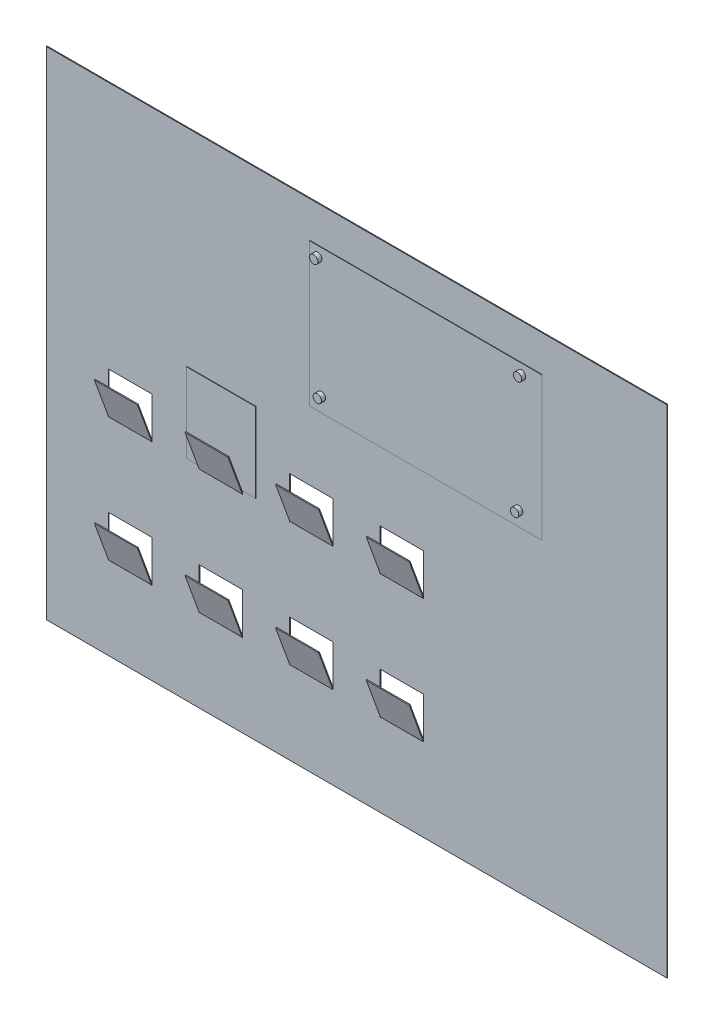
ISO-10303-21;
HEADER;
FILE_DESCRIPTION(('STEP AP214'),'2;1');
FILE_NAME('part.step','',(''),(''),'','','');
FILE_SCHEMA(('AUTOMOTIVE_DESIGN { 1 0 10303 214 1 1 1 1 }'));
ENDSEC;
DATA;
#1=APPLICATION_CONTEXT('core data for automotive mechanical design processes');
#2=APPLICATION_PROTOCOL_DEFINITION('international standard','automotive_design',2000,#1);
#3=PRODUCT_CONTEXT('',#1,'mechanical');
#4=PRODUCT('Part','Part','',(#3));
#5=PRODUCT_RELATED_PRODUCT_CATEGORY('part','',(#4));
#6=PRODUCT_DEFINITION_FORMATION('','',#4);
#7=PRODUCT_DEFINITION_CONTEXT('part definition',#1,'design');
#8=PRODUCT_DEFINITION('design','',#6,#7);
#9=PRODUCT_DEFINITION_SHAPE('','',#8);
#10=(LENGTH_UNIT() NAMED_UNIT(*) SI_UNIT(.MILLI.,.METRE.));
#11=(NAMED_UNIT(*) PLANE_ANGLE_UNIT() SI_UNIT($,.RADIAN.));
#12=(NAMED_UNIT(*) SI_UNIT($,.STERADIAN.) SOLID_ANGLE_UNIT());
#13=UNCERTAINTY_MEASURE_WITH_UNIT(LENGTH_MEASURE(1.E-05),#10,'distance_accuracy_value','');
#14=(GEOMETRIC_REPRESENTATION_CONTEXT(3) GLOBAL_UNCERTAINTY_ASSIGNED_CONTEXT((#13)) GLOBAL_UNIT_ASSIGNED_CONTEXT((#10,
#11,#12)) REPRESENTATION_CONTEXT('',''));
#15=CARTESIAN_POINT('',(0.,0.,0.));
#16=DIRECTION('',(0.,0.,1.));
#17=DIRECTION('',(1.,0.,0.));
#18=AXIS2_PLACEMENT_3D('',#15,#16,#17);
#19=CARTESIAN_POINT('',(392.895554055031,201.519032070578,11.));
#20=DIRECTION('',(0.,0.,-1.));
#21=DIRECTION('',(-1.,0.,0.));
#22=AXIS2_PLACEMENT_3D('',#19,#20,#21);
#23=CYLINDRICAL_SURFACE('',#22,9.99999999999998);
#24=CARTESIAN_POINT('',(392.895554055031,201.519032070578,11.));
#25=DIRECTION('',(0.,0.,1.));
#26=DIRECTION('',(1.,0.,0.));
#27=AXIS2_PLACEMENT_3D('',#24,#25,#26);
#28=CIRCLE('',#27,9.99999999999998);
#29=CARTESIAN_POINT('',(402.895554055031,201.519032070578,11.));
#30=VERTEX_POINT('',#29);
#31=EDGE_CURVE('E13',#30,#30,#28,.T.);
#32=ORIENTED_EDGE('',*,*,#31,.F.);
#33=EDGE_LOOP('',(#32));
#34=FACE_BOUND('',#33,.T.);
#35=CARTESIAN_POINT('',(392.895554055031,201.519032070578,1.));
#36=DIRECTION('',(0.,0.,1.));
#37=DIRECTION('',(1.,0.,0.));
#38=AXIS2_PLACEMENT_3D('',#35,#36,#37);
#39=CIRCLE('',#38,9.99999999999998);
#40=CARTESIAN_POINT('',(402.895554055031,201.519032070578,1.));
#41=VERTEX_POINT('',#40);
#42=EDGE_CURVE('E208',#41,#41,#39,.T.);
#43=ORIENTED_EDGE('',*,*,#42,.T.);
#44=EDGE_LOOP('',(#43));
#45=FACE_BOUND('',#44,.T.);
#46=ADVANCED_FACE('F205',(#34,#45),#23,.T.);
#47=CARTESIAN_POINT('',(392.895554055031,201.519032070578,11.));
#48=DIRECTION('',(0.,0.,1.));
#49=DIRECTION('',(1.,0.,0.));
#50=AXIS2_PLACEMENT_3D('',#47,#48,#49);
#51=PLANE('',#50);
#52=ORIENTED_EDGE('',*,*,#31,.T.);
#53=EDGE_LOOP('',(#52));
#54=FACE_BOUND('',#53,.T.);
#55=ADVANCED_FACE('F220',(#54),#51,.T.);
#56=CARTESIAN_POINT('',(392.895554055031,201.519032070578,1.));
#57=DIRECTION('',(0.,0.,1.));
#58=DIRECTION('',(1.,0.,0.));
#59=AXIS2_PLACEMENT_3D('',#56,#57,#58);
#60=PLANE('',#59);
#61=ORIENTED_EDGE('',*,*,#42,.F.);
#62=EDGE_LOOP('',(#61));
#63=FACE_BOUND('',#62,.T.);
#64=ADVANCED_FACE('F218',(#63),#60,.F.);
#65=CLOSED_SHELL('',(#46,#55,#64));
#66=MANIFOLD_SOLID_BREP('B2',#65);
#67=CARTESIAN_POINT('',(-92.6444352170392,488.611122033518,11.));
#68=DIRECTION('',(0.,0.,-1.));
#69=DIRECTION('',(-1.,0.,0.));
#70=AXIS2_PLACEMENT_3D('',#67,#68,#69);
#71=CYLINDRICAL_SURFACE('',#70,10.);
#72=CARTESIAN_POINT('',(-92.6444352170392,488.611122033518,11.));
#73=DIRECTION('',(0.,0.,1.));
#74=DIRECTION('',(1.,0.,0.));
#75=AXIS2_PLACEMENT_3D('',#72,#73,#74);
#76=CIRCLE('',#75,10.);
#77=CARTESIAN_POINT('',(-82.6444352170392,488.611122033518,11.));
#78=VERTEX_POINT('',#77);
#79=EDGE_CURVE('E204',#78,#78,#76,.T.);
#80=ORIENTED_EDGE('',*,*,#79,.F.);
#81=EDGE_LOOP('',(#80));
#82=FACE_BOUND('',#81,.T.);
#83=CARTESIAN_POINT('',(-92.6444352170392,488.611122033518,1.));
#84=DIRECTION('',(0.,0.,1.));
#85=DIRECTION('',(1.,0.,0.));
#86=AXIS2_PLACEMENT_3D('',#83,#84,#85);
#87=CIRCLE('',#86,10.);
#88=CARTESIAN_POINT('',(-82.6444352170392,488.611122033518,1.));
#89=VERTEX_POINT('',#88);
#90=EDGE_CURVE('E260',#89,#89,#87,.T.);
#91=ORIENTED_EDGE('',*,*,#90,.T.);
#92=EDGE_LOOP('',(#91));
#93=FACE_BOUND('',#92,.T.);
#94=ADVANCED_FACE('F257',(#82,#93),#71,.T.);
#95=CARTESIAN_POINT('',(-92.6444352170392,488.611122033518,11.));
#96=DIRECTION('',(0.,0.,1.));
#97=DIRECTION('',(1.,0.,0.));
#98=AXIS2_PLACEMENT_3D('',#95,#96,#97);
#99=PLANE('',#98);
#100=ORIENTED_EDGE('',*,*,#79,.T.);
#101=EDGE_LOOP('',(#100));
#102=FACE_BOUND('',#101,.T.);
#103=ADVANCED_FACE('F272',(#102),#99,.T.);
#104=CARTESIAN_POINT('',(-92.6444352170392,488.611122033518,1.));
#105=DIRECTION('',(0.,0.,1.));
#106=DIRECTION('',(1.,0.,0.));
#107=AXIS2_PLACEMENT_3D('',#104,#105,#106);
#108=PLANE('',#107);
#109=ORIENTED_EDGE('',*,*,#90,.F.);
#110=EDGE_LOOP('',(#109));
#111=FACE_BOUND('',#110,.T.);
#112=ADVANCED_FACE('F270',(#111),#108,.F.);
#113=CLOSED_SHELL('',(#94,#103,#112));
#114=MANIFOLD_SOLID_BREP('B8',#113);
#115=CARTESIAN_POINT('',(399.922923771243,488.611122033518,11.));
#116=DIRECTION('',(0.,0.,-1.));
#117=DIRECTION('',(-1.,0.,0.));
#118=AXIS2_PLACEMENT_3D('',#115,#116,#117);
#119=CYLINDRICAL_SURFACE('',#118,9.99999999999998);
#120=CARTESIAN_POINT('',(399.922923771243,488.611122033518,11.));
#121=DIRECTION('',(0.,0.,1.));
#122=DIRECTION('',(1.,0.,0.));
#123=AXIS2_PLACEMENT_3D('',#120,#121,#122);
#124=CIRCLE('',#123,9.99999999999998);
#125=CARTESIAN_POINT('',(409.922923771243,488.611122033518,11.));
#126=VERTEX_POINT('',#125);
#127=EDGE_CURVE('E256',#126,#126,#124,.T.);
#128=ORIENTED_EDGE('',*,*,#127,.F.);
#129=EDGE_LOOP('',(#128));
#130=FACE_BOUND('',#129,.T.);
#131=CARTESIAN_POINT('',(399.922923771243,488.611122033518,1.));
#132=DIRECTION('',(0.,0.,1.));
#133=DIRECTION('',(1.,0.,0.));
#134=AXIS2_PLACEMENT_3D('',#131,#132,#133);
#135=CIRCLE('',#134,9.99999999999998);
#136=CARTESIAN_POINT('',(409.922923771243,488.611122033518,1.));
#137=VERTEX_POINT('',#136);
#138=EDGE_CURVE('E312',#137,#137,#135,.T.);
#139=ORIENTED_EDGE('',*,*,#138,.T.);
#140=EDGE_LOOP('',(#139));
#141=FACE_BOUND('',#140,.T.);
#142=ADVANCED_FACE('F309',(#130,#141),#119,.T.);
#143=CARTESIAN_POINT('',(399.922923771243,488.611122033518,11.));
#144=DIRECTION('',(0.,0.,1.));
#145=DIRECTION('',(1.,0.,0.));
#146=AXIS2_PLACEMENT_3D('',#143,#144,#145);
#147=PLANE('',#146);
#148=ORIENTED_EDGE('',*,*,#127,.T.);
#149=EDGE_LOOP('',(#148));
#150=FACE_BOUND('',#149,.T.);
#151=ADVANCED_FACE('F324',(#150),#147,.T.);
#152=CARTESIAN_POINT('',(399.922923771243,488.611122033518,1.));
#153=DIRECTION('',(0.,0.,1.));
#154=DIRECTION('',(1.,0.,0.));
#155=AXIS2_PLACEMENT_3D('',#152,#153,#154);
#156=PLANE('',#155);
#157=ORIENTED_EDGE('',*,*,#138,.F.);
#158=EDGE_LOOP('',(#157));
#159=FACE_BOUND('',#158,.T.);
#160=ADVANCED_FACE('F322',(#159),#156,.F.);
#161=CLOSED_SHELL('',(#142,#151,#160));
#162=MANIFOLD_SOLID_BREP('B199',#161);
#163=CARTESIAN_POINT('',(-84.012255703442,201.519032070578,11.));
#164=DIRECTION('',(0.,0.,-1.));
#165=DIRECTION('',(-1.,0.,0.));
#166=AXIS2_PLACEMENT_3D('',#163,#164,#165);
#167=CYLINDRICAL_SURFACE('',#166,10.);
#168=CARTESIAN_POINT('',(-84.012255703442,201.519032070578,11.));
#169=DIRECTION('',(0.,0.,1.));
#170=DIRECTION('',(1.,0.,0.));
#171=AXIS2_PLACEMENT_3D('',#168,#169,#170);
#172=CIRCLE('',#171,10.);
#173=CARTESIAN_POINT('',(-74.012255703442,201.519032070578,11.));
#174=VERTEX_POINT('',#173);
#175=EDGE_CURVE('E308',#174,#174,#172,.T.);
#176=ORIENTED_EDGE('',*,*,#175,.F.);
#177=EDGE_LOOP('',(#176));
#178=FACE_BOUND('',#177,.T.);
#179=CARTESIAN_POINT('',(-84.012255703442,201.519032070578,1.));
#180=DIRECTION('',(0.,0.,1.));
#181=DIRECTION('',(1.,0.,0.));
#182=AXIS2_PLACEMENT_3D('',#179,#180,#181);
#183=CIRCLE('',#182,10.);
#184=CARTESIAN_POINT('',(-74.012255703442,201.519032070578,1.));
#185=VERTEX_POINT('',#184);
#186=EDGE_CURVE('E366',#185,#185,#183,.T.);
#187=ORIENTED_EDGE('',*,*,#186,.T.);
#188=EDGE_LOOP('',(#187));
#189=FACE_BOUND('',#188,.T.);
#190=ADVANCED_FACE('F363',(#178,#189),#167,.T.);
#191=CARTESIAN_POINT('',(-84.012255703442,201.519032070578,11.));
#192=DIRECTION('',(0.,0.,1.));
#193=DIRECTION('',(1.,0.,0.));
#194=AXIS2_PLACEMENT_3D('',#191,#192,#193);
#195=PLANE('',#194);
#196=ORIENTED_EDGE('',*,*,#175,.T.);
#197=EDGE_LOOP('',(#196));
#198=FACE_BOUND('',#197,.T.);
#199=ADVANCED_FACE('F378',(#198),#195,.T.);
#200=CARTESIAN_POINT('',(-84.012255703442,201.519032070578,1.));
#201=DIRECTION('',(0.,0.,1.));
#202=DIRECTION('',(1.,0.,0.));
#203=AXIS2_PLACEMENT_3D('',#200,#201,#202);
#204=PLANE('',#203);
#205=ORIENTED_EDGE('',*,*,#186,.F.);
#206=EDGE_LOOP('',(#205));
#207=FACE_BOUND('',#206,.T.);
#208=ADVANCED_FACE('F376',(#207),#204,.F.);
#209=CLOSED_SHELL('',(#190,#199,#208));
#210=MANIFOLD_SOLID_BREP('B251',#209);
#211=CARTESIAN_POINT('',(-409.978788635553,100.021119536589,1.));
#212=DIRECTION('',(1.,0.,0.));
#213=DIRECTION('',(0.,0.,-1.));
#214=AXIS2_PLACEMENT_3D('',#211,#212,#213);
#215=PLANE('',#214);
#216=DIRECTION('',(0.,-1.,0.));
#217=VECTOR('',#216,1.);
#218=CARTESIAN_POINT('',(-409.978788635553,100.021119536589,0.));
#219=LINE('',#218,#217);
#220=CARTESIAN_POINT('',(-409.978788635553,100.021119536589,0.));
#221=VERTEX_POINT('',#220);
#222=CARTESIAN_POINT('',(-409.978788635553,-92.0511387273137,0.));
#223=VERTEX_POINT('',#222);
#224=EDGE_CURVE('E479',#221,#223,#219,.T.);
#225=ORIENTED_EDGE('',*,*,#224,.T.);
#226=DIRECTION('',(0.,0.,-1.));
#227=VECTOR('',#226,1.);
#228=CARTESIAN_POINT('',(-409.978788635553,-92.0511387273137,1.));
#229=LINE('',#228,#227);
#230=CARTESIAN_POINT('',(-409.978788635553,-92.0511387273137,1.));
#231=VERTEX_POINT('',#230);
#232=EDGE_CURVE('E361',#231,#223,#229,.T.);
#233=ORIENTED_EDGE('',*,*,#232,.F.);
#234=DIRECTION('',(0.,-1.,0.));
#235=VECTOR('',#234,1.);
#236=CARTESIAN_POINT('',(-409.978788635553,100.021119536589,1.));
#237=LINE('',#236,#235);
#238=CARTESIAN_POINT('',(-409.978788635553,100.021119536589,1.));
#239=VERTEX_POINT('',#238);
#240=EDGE_CURVE('E467',#239,#231,#237,.T.);
#241=ORIENTED_EDGE('',*,*,#240,.F.);
#242=DIRECTION('',(0.,0.,-1.));
#243=VECTOR('',#242,1.);
#244=CARTESIAN_POINT('',(-409.978788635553,100.021119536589,1.));
#245=LINE('',#244,#243);
#246=EDGE_CURVE('E475',#239,#221,#245,.T.);
#247=ORIENTED_EDGE('',*,*,#246,.T.);
#248=EDGE_LOOP('',(#225,#233,#241,#247));
#249=FACE_BOUND('',#248,.T.);
#250=ADVANCED_FACE('F416',(#249),#215,.F.);
#251=CARTESIAN_POINT('',(-409.978788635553,-92.0511387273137,1.));
#252=DIRECTION('',(0.,1.,0.));
#253=DIRECTION('',(0.,0.,1.));
#254=AXIS2_PLACEMENT_3D('',#251,#252,#253);
#255=PLANE('',#254);
#256=DIRECTION('',(1.,0.,0.));
#257=VECTOR('',#256,1.);
#258=CARTESIAN_POINT('',(-409.978788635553,-92.0511387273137,0.));
#259=LINE('',#258,#257);
#260=CARTESIAN_POINT('',(-243.089210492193,-92.0511387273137,0.));
#261=VERTEX_POINT('',#260);
#262=EDGE_CURVE('E471',#223,#261,#259,.T.);
#263=ORIENTED_EDGE('',*,*,#262,.T.);
#264=DIRECTION('',(0.,0.,-1.));
#265=VECTOR('',#264,1.);
#266=CARTESIAN_POINT('',(-243.089210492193,-92.0511387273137,1.));
#267=LINE('',#266,#265);
#268=CARTESIAN_POINT('',(-243.089210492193,-92.0511387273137,1.));
#269=VERTEX_POINT('',#268);
#270=EDGE_CURVE('E424',#269,#261,#267,.T.);
#271=ORIENTED_EDGE('',*,*,#270,.F.);
#272=DIRECTION('',(1.,0.,0.));
#273=VECTOR('',#272,1.);
#274=CARTESIAN_POINT('',(-409.978788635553,-92.0511387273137,1.));
#275=LINE('',#274,#273);
#276=EDGE_CURVE('E462',#231,#269,#275,.T.);
#277=ORIENTED_EDGE('',*,*,#276,.F.);
#278=ORIENTED_EDGE('',*,*,#232,.T.);
#279=EDGE_LOOP('',(#263,#271,#277,#278));
#280=FACE_BOUND('',#279,.T.);
#281=ADVANCED_FACE('F470',(#280),#255,.F.);
#282=CARTESIAN_POINT('',(-243.089210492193,100.021119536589,1.));
#283=DIRECTION('',(-1.,0.,0.));
#284=DIRECTION('',(0.,0.,1.));
#285=AXIS2_PLACEMENT_3D('',#282,#283,#284);
#286=PLANE('',#285);
#287=DIRECTION('',(0.,1.,0.));
#288=VECTOR('',#287,1.);
#289=CARTESIAN_POINT('',(-243.089210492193,100.021119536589,0.));
#290=LINE('',#289,#288);
#291=CARTESIAN_POINT('',(-243.089210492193,100.021119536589,0.));
#292=VERTEX_POINT('',#291);
#293=EDGE_CURVE('E449',#261,#292,#290,.T.);
#294=ORIENTED_EDGE('',*,*,#293,.T.);
#295=DIRECTION('',(0.,0.,-1.));
#296=VECTOR('',#295,1.);
#297=CARTESIAN_POINT('',(-243.089210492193,100.021119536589,1.));
#298=LINE('',#297,#296);
#299=CARTESIAN_POINT('',(-243.089210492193,100.021119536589,1.));
#300=VERTEX_POINT('',#299);
#301=EDGE_CURVE('E472',#300,#292,#298,.T.);
#302=ORIENTED_EDGE('',*,*,#301,.F.);
#303=DIRECTION('',(0.,1.,0.));
#304=VECTOR('',#303,1.);
#305=CARTESIAN_POINT('',(-243.089210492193,100.021119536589,1.));
#306=LINE('',#305,#304);
#307=EDGE_CURVE('E465',#269,#300,#306,.T.);
#308=ORIENTED_EDGE('',*,*,#307,.F.);
#309=ORIENTED_EDGE('',*,*,#270,.T.);
#310=EDGE_LOOP('',(#294,#302,#308,#309));
#311=FACE_BOUND('',#310,.T.);
#312=ADVANCED_FACE('F473',(#311),#286,.F.);
#313=CARTESIAN_POINT('',(-409.978788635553,100.021119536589,1.));
#314=DIRECTION('',(0.,-1.,0.));
#315=DIRECTION('',(0.,0.,-1.));
#316=AXIS2_PLACEMENT_3D('',#313,#314,#315);
#317=PLANE('',#316);
#318=DIRECTION('',(-1.,0.,0.));
#319=VECTOR('',#318,1.);
#320=CARTESIAN_POINT('',(-409.978788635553,100.021119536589,0.));
#321=LINE('',#320,#319);
#322=EDGE_CURVE('E455',#292,#221,#321,.T.);
#323=ORIENTED_EDGE('',*,*,#322,.T.);
#324=ORIENTED_EDGE('',*,*,#246,.F.);
#325=DIRECTION('',(-1.,0.,0.));
#326=VECTOR('',#325,1.);
#327=CARTESIAN_POINT('',(-409.978788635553,100.021119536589,1.));
#328=LINE('',#327,#326);
#329=EDGE_CURVE('E432',#300,#239,#328,.T.);
#330=ORIENTED_EDGE('',*,*,#329,.F.);
#331=ORIENTED_EDGE('',*,*,#301,.T.);
#332=EDGE_LOOP('',(#323,#324,#330,#331));
#333=FACE_BOUND('',#332,.T.);
#334=ADVANCED_FACE('F486',(#333),#317,.F.);
#335=CARTESIAN_POINT('',(0.,0.,1.));
#336=DIRECTION('',(0.,0.,1.));
#337=DIRECTION('',(1.,0.,0.));
#338=AXIS2_PLACEMENT_3D('',#335,#336,#337);
#339=PLANE('',#338);
#340=ORIENTED_EDGE('',*,*,#240,.T.);
#341=ORIENTED_EDGE('',*,*,#276,.T.);
#342=ORIENTED_EDGE('',*,*,#307,.T.);
#343=ORIENTED_EDGE('',*,*,#329,.T.);
#344=EDGE_LOOP('',(#340,#341,#342,#343));
#345=FACE_BOUND('',#344,.T.);
#346=ADVANCED_FACE('F463',(#345),#339,.T.);
#347=CARTESIAN_POINT('',(0.,0.,0.));
#348=DIRECTION('',(0.,0.,1.));
#349=DIRECTION('',(1.,0.,0.));
#350=AXIS2_PLACEMENT_3D('',#347,#348,#349);
#351=PLANE('',#350);
#352=ORIENTED_EDGE('',*,*,#224,.F.);
#353=ORIENTED_EDGE('',*,*,#322,.F.);
#354=ORIENTED_EDGE('',*,*,#293,.F.);
#355=ORIENTED_EDGE('',*,*,#262,.F.);
#356=EDGE_LOOP('',(#352,#353,#354,#355));
#357=FACE_BOUND('',#356,.T.);
#358=ADVANCED_FACE('F489',(#357),#351,.F.);
#359=CLOSED_SHELL('',(#250,#281,#312,#334,#346,#358));
#360=MANIFOLD_SOLID_BREP('B303',#359);
#361=CARTESIAN_POINT('',(0.,0.,0.));
#362=DIRECTION('',(0.,0.,1.));
#363=DIRECTION('',(1.,0.,0.));
#364=AXIS2_PLACEMENT_3D('',#361,#362,#363);
#365=PLANE('',#364);
#366=DIRECTION('',(1.,0.,0.));
#367=VECTOR('',#366,1.);
#368=CARTESIAN_POINT('',(-381.,-99.9999999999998,0.));
#369=LINE('',#368,#367);
#370=CARTESIAN_POINT('',(-380.5,-99.9999999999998,0.));
#371=VERTEX_POINT('',#370);
#372=CARTESIAN_POINT('',(-276.5,-99.9999999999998,0.));
#373=VERTEX_POINT('',#372);
#374=EDGE_CURVE('E2006',#371,#373,#369,.T.);
#375=ORIENTED_EDGE('',*,*,#374,.F.);
#376=DIRECTION('',(0.,1.,0.));
#377=VECTOR('',#376,1.);
#378=CARTESIAN_POINT('',(-380.5,0.,0.));
#379=LINE('',#378,#377);
#380=CARTESIAN_POINT('',(-380.5,-101.,0.));
#381=VERTEX_POINT('',#380);
#382=EDGE_CURVE('E1554',#381,#371,#379,.T.);
#383=ORIENTED_EDGE('',*,*,#382,.F.);
#384=DIRECTION('',(1.,0.,0.));
#385=VECTOR('',#384,1.);
#386=CARTESIAN_POINT('',(0.,-101.,0.));
#387=LINE('',#386,#385);
#388=CARTESIAN_POINT('',(-381.,-101.,0.));
#389=VERTEX_POINT('',#388);
#390=EDGE_CURVE('E1550',#381,#389,#387,.F.);
#391=ORIENTED_EDGE('',*,*,#390,.T.);
#392=DIRECTION('',(0.,-1.,0.));
#393=VECTOR('',#392,1.);
#394=CARTESIAN_POINT('',(-381.,2.4980018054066E-13,0.));
#395=LINE('',#394,#393);
#396=CARTESIAN_POINT('',(-381.,2.4980018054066E-13,0.));
#397=VERTEX_POINT('',#396);
#398=EDGE_CURVE('E2004',#397,#389,#395,.T.);
#399=ORIENTED_EDGE('',*,*,#398,.F.);
#400=DIRECTION('',(-1.,0.,0.));
#401=VECTOR('',#400,1.);
#402=CARTESIAN_POINT('',(-381.,2.4980018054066E-13,0.));
#403=LINE('',#402,#401);
#404=CARTESIAN_POINT('',(-276.,2.4980018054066E-13,0.));
#405=VERTEX_POINT('',#404);
#406=EDGE_CURVE('E2002',#405,#397,#403,.T.);
#407=ORIENTED_EDGE('',*,*,#406,.F.);
#408=DIRECTION('',(0.,1.,0.));
#409=VECTOR('',#408,1.);
#410=CARTESIAN_POINT('',(-276.,2.4980018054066E-13,0.));
#411=LINE('',#410,#409);
#412=CARTESIAN_POINT('',(-276.,-101.,0.));
#413=VERTEX_POINT('',#412);
#414=EDGE_CURVE('E2009',#413,#405,#411,.T.);
#415=ORIENTED_EDGE('',*,*,#414,.F.);
#416=DIRECTION('',(1.,0.,0.));
#417=VECTOR('',#416,1.);
#418=CARTESIAN_POINT('',(0.,-101.,0.));
#419=LINE('',#418,#417);
#420=CARTESIAN_POINT('',(-276.5,-101.,0.));
#421=VERTEX_POINT('',#420);
#422=EDGE_CURVE('E1787',#413,#421,#419,.F.);
#423=ORIENTED_EDGE('',*,*,#422,.T.);
#424=DIRECTION('',(0.,1.,0.));
#425=VECTOR('',#424,1.);
#426=CARTESIAN_POINT('',(-276.5,0.,0.));
#427=LINE('',#426,#425);
#428=EDGE_CURVE('E1784',#421,#373,#427,.T.);
#429=ORIENTED_EDGE('',*,*,#428,.T.);
#430=EDGE_LOOP('',(#375,#383,#391,#399,#407,#415,#423,#429));
#431=FACE_BOUND('',#430,.T.);
#432=DIRECTION('',(1.,0.,0.));
#433=VECTOR('',#432,1.);
#434=CARTESIAN_POINT('',(-600.,-99.9999999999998,0.));
#435=LINE('',#434,#433);
#436=CARTESIAN_POINT('',(-599.5,-99.9999999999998,0.));
#437=VERTEX_POINT('',#436);
#438=CARTESIAN_POINT('',(-495.5,-99.9999999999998,0.));
#439=VERTEX_POINT('',#438);
#440=EDGE_CURVE('E2030',#437,#439,#435,.T.);
#441=ORIENTED_EDGE('',*,*,#440,.F.);
#442=DIRECTION('',(0.,1.,0.));
#443=VECTOR('',#442,1.);
#444=CARTESIAN_POINT('',(-599.5,0.,0.));
#445=LINE('',#444,#443);
#446=CARTESIAN_POINT('',(-599.5,-101.,0.));
#447=VERTEX_POINT('',#446);
#448=EDGE_CURVE('E1806',#447,#437,#445,.T.);
#449=ORIENTED_EDGE('',*,*,#448,.F.);
#450=DIRECTION('',(1.,0.,0.));
#451=VECTOR('',#450,1.);
#452=CARTESIAN_POINT('',(0.,-101.,0.));
#453=LINE('',#452,#451);
#454=CARTESIAN_POINT('',(-600.,-101.,0.));
#455=VERTEX_POINT('',#454);
#456=EDGE_CURVE('E1802',#447,#455,#453,.F.);
#457=ORIENTED_EDGE('',*,*,#456,.T.);
#458=DIRECTION('',(0.,-1.,0.));
#459=VECTOR('',#458,1.);
#460=CARTESIAN_POINT('',(-600.,2.22044604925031E-13,0.));
#461=LINE('',#460,#459);
#462=CARTESIAN_POINT('',(-600.,2.22044604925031E-13,0.));
#463=VERTEX_POINT('',#462);
#464=EDGE_CURVE('E2028',#463,#455,#461,.T.);
#465=ORIENTED_EDGE('',*,*,#464,.F.);
#466=DIRECTION('',(-1.,0.,0.));
#467=VECTOR('',#466,1.);
#468=CARTESIAN_POINT('',(-600.,2.22044604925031E-13,0.));
#469=LINE('',#468,#467);
#470=CARTESIAN_POINT('',(-495.,2.22044604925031E-13,0.));
#471=VERTEX_POINT('',#470);
#472=EDGE_CURVE('E2036',#471,#463,#469,.T.);
#473=ORIENTED_EDGE('',*,*,#472,.F.);
#474=DIRECTION('',(0.,1.,0.));
#475=VECTOR('',#474,1.);
#476=CARTESIAN_POINT('',(-495.,2.22044604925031E-13,0.));
#477=LINE('',#476,#475);
#478=CARTESIAN_POINT('',(-495.,-101.,0.));
#479=VERTEX_POINT('',#478);
#480=EDGE_CURVE('E2033',#479,#471,#477,.T.);
#481=ORIENTED_EDGE('',*,*,#480,.F.);
#482=DIRECTION('',(1.,0.,0.));
#483=VECTOR('',#482,1.);
#484=CARTESIAN_POINT('',(0.,-101.,0.));
#485=LINE('',#484,#483);
#486=CARTESIAN_POINT('',(-495.5,-101.,0.));
#487=VERTEX_POINT('',#486);
#488=EDGE_CURVE('E1824',#479,#487,#485,.F.);
#489=ORIENTED_EDGE('',*,*,#488,.T.);
#490=DIRECTION('',(0.,1.,0.));
#491=VECTOR('',#490,1.);
#492=CARTESIAN_POINT('',(-495.5,0.,0.));
#493=LINE('',#492,#491);
#494=EDGE_CURVE('E1821',#487,#439,#493,.T.);
#495=ORIENTED_EDGE('',*,*,#494,.T.);
#496=EDGE_LOOP('',(#441,#449,#457,#465,#473,#481,#489,#495));
#497=FACE_BOUND('',#496,.T.);
#498=DIRECTION('',(0.,-1.,0.));
#499=VECTOR('',#498,1.);
#500=CARTESIAN_POINT('',(-750.,-600.,0.));
#501=LINE('',#500,#499);
#502=CARTESIAN_POINT('',(-750.,600.,0.));
#503=VERTEX_POINT('',#502);
#504=CARTESIAN_POINT('',(-750.,-600.,0.));
#505=VERTEX_POINT('',#504);
#506=EDGE_CURVE('E2046',#503,#505,#501,.T.);
#507=ORIENTED_EDGE('',*,*,#506,.T.);
#508=DIRECTION('',(1.,0.,0.));
#509=VECTOR('',#508,1.);
#510=CARTESIAN_POINT('',(750.,-600.,0.));
#511=LINE('',#510,#509);
#512=CARTESIAN_POINT('',(750.,-600.,0.));
#513=VERTEX_POINT('',#512);
#514=EDGE_CURVE('E2062',#505,#513,#511,.T.);
#515=ORIENTED_EDGE('',*,*,#514,.T.);
#516=DIRECTION('',(0.,1.,0.));
#517=VECTOR('',#516,1.);
#518=CARTESIAN_POINT('',(750.,-600.,0.));
#519=LINE('',#518,#517);
#520=CARTESIAN_POINT('',(750.,600.,0.));
#521=VERTEX_POINT('',#520);
#522=EDGE_CURVE('E2065',#513,#521,#519,.T.);
#523=ORIENTED_EDGE('',*,*,#522,.T.);
#524=DIRECTION('',(-1.,0.,0.));
#525=VECTOR('',#524,1.);
#526=CARTESIAN_POINT('',(750.,600.,0.));
#527=LINE('',#526,#525);
#528=EDGE_CURVE('E2051',#521,#503,#527,.T.);
#529=ORIENTED_EDGE('',*,*,#528,.T.);
#530=EDGE_LOOP('',(#507,#515,#523,#529));
#531=FACE_BOUND('',#530,.T.);
#532=DIRECTION('',(0.,1.,0.));
#533=VECTOR('',#532,1.);
#534=CARTESIAN_POINT('',(-57.,2.91433543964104E-13,0.));
#535=LINE('',#534,#533);
#536=CARTESIAN_POINT('',(-57.,-101.,0.));
#537=VERTEX_POINT('',#536);
#538=CARTESIAN_POINT('',(-57.,2.91433543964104E-13,0.));
#539=VERTEX_POINT('',#538);
#540=EDGE_CURVE('E1983',#537,#539,#535,.T.);
#541=ORIENTED_EDGE('',*,*,#540,.F.);
#542=DIRECTION('',(1.,0.,0.));
#543=VECTOR('',#542,1.);
#544=CARTESIAN_POINT('',(0.,-101.,0.));
#545=LINE('',#544,#543);
#546=CARTESIAN_POINT('',(-57.4999999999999,-101.,0.));
#547=VERTEX_POINT('',#546);
#548=EDGE_CURVE('E1752',#537,#547,#545,.F.);
#549=ORIENTED_EDGE('',*,*,#548,.T.);
#550=DIRECTION('',(0.,1.,0.));
#551=VECTOR('',#550,1.);
#552=CARTESIAN_POINT('',(-57.4999999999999,0.,0.));
#553=LINE('',#552,#551);
#554=CARTESIAN_POINT('',(-57.4999999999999,-99.9999999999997,0.));
#555=VERTEX_POINT('',#554);
#556=EDGE_CURVE('E1749',#547,#555,#553,.T.);
#557=ORIENTED_EDGE('',*,*,#556,.T.);
#558=DIRECTION('',(1.,0.,0.));
#559=VECTOR('',#558,1.);
#560=CARTESIAN_POINT('',(-162.,-99.9999999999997,0.));
#561=LINE('',#560,#559);
#562=CARTESIAN_POINT('',(-161.5,-99.9999999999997,0.));
#563=VERTEX_POINT('',#562);
#564=EDGE_CURVE('E1980',#563,#555,#561,.T.);
#565=ORIENTED_EDGE('',*,*,#564,.F.);
#566=DIRECTION('',(0.,1.,0.));
#567=VECTOR('',#566,1.);
#568=CARTESIAN_POINT('',(-161.5,-101.,0.));
#569=LINE('',#568,#567);
#570=CARTESIAN_POINT('',(-161.5,-101.,0.));
#571=VERTEX_POINT('',#570);
#572=EDGE_CURVE('E1773',#571,#563,#569,.T.);
#573=ORIENTED_EDGE('',*,*,#572,.F.);
#574=DIRECTION('',(1.,0.,0.));
#575=VECTOR('',#574,1.);
#576=CARTESIAN_POINT('',(-162.,-101.,0.));
#577=LINE('',#576,#575);
#578=CARTESIAN_POINT('',(-162.,-101.,0.));
#579=VERTEX_POINT('',#578);
#580=EDGE_CURVE('E1765',#579,#571,#577,.T.);
#581=ORIENTED_EDGE('',*,*,#580,.F.);
#582=DIRECTION('',(0.,-1.,0.));
#583=VECTOR('',#582,1.);
#584=CARTESIAN_POINT('',(-162.,2.91433543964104E-13,0.));
#585=LINE('',#584,#583);
#586=CARTESIAN_POINT('',(-162.,2.91433543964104E-13,0.));
#587=VERTEX_POINT('',#586);
#588=EDGE_CURVE('E1978',#587,#579,#585,.T.);
#589=ORIENTED_EDGE('',*,*,#588,.F.);
#590=DIRECTION('',(-1.,0.,0.));
#591=VECTOR('',#590,1.);
#592=CARTESIAN_POINT('',(-162.,2.91433543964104E-13,0.));
#593=LINE('',#592,#591);
#594=EDGE_CURVE('E1976',#539,#587,#593,.T.);
#595=ORIENTED_EDGE('',*,*,#594,.F.);
#596=EDGE_LOOP('',(#541,#549,#557,#565,#573,#581,#589,#595));
#597=FACE_BOUND('',#596,.T.);
#598=DIRECTION('',(0.,1.,0.));
#599=VECTOR('',#598,1.);
#600=CARTESIAN_POINT('',(162.,3.19189119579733E-13,0.));
#601=LINE('',#600,#599);
#602=CARTESIAN_POINT('',(162.,-101.,0.));
#603=VERTEX_POINT('',#602);
#604=CARTESIAN_POINT('',(162.,3.19189119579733E-13,0.));
#605=VERTEX_POINT('',#604);
#606=EDGE_CURVE('E1957',#603,#605,#601,.T.);
#607=ORIENTED_EDGE('',*,*,#606,.F.);
#608=DIRECTION('',(1.,0.,0.));
#609=VECTOR('',#608,1.);
#610=CARTESIAN_POINT('',(0.,-101.,0.));
#611=LINE('',#610,#609);
#612=CARTESIAN_POINT('',(161.5,-101.,0.));
#613=VERTEX_POINT('',#612);
#614=EDGE_CURVE('E1716',#603,#613,#611,.F.);
#615=ORIENTED_EDGE('',*,*,#614,.T.);
#616=DIRECTION('',(0.,1.,0.));
#617=VECTOR('',#616,1.);
#618=CARTESIAN_POINT('',(161.5,0.,0.));
#619=LINE('',#618,#617);
#620=CARTESIAN_POINT('',(161.5,-99.9999999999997,0.));
#621=VERTEX_POINT('',#620);
#622=EDGE_CURVE('E1713',#613,#621,#619,.T.);
#623=ORIENTED_EDGE('',*,*,#622,.T.);
#624=DIRECTION('',(1.,0.,0.));
#625=VECTOR('',#624,1.);
#626=CARTESIAN_POINT('',(57.,-99.9999999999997,0.));
#627=LINE('',#626,#625);
#628=CARTESIAN_POINT('',(57.5,-99.9999999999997,0.));
#629=VERTEX_POINT('',#628);
#630=EDGE_CURVE('E1954',#629,#621,#627,.T.);
#631=ORIENTED_EDGE('',*,*,#630,.F.);
#632=DIRECTION('',(0.,1.,0.));
#633=VECTOR('',#632,1.);
#634=CARTESIAN_POINT('',(57.5,-101.,0.));
#635=LINE('',#634,#633);
#636=CARTESIAN_POINT('',(57.5,-101.,0.));
#637=VERTEX_POINT('',#636);
#638=EDGE_CURVE('E1737',#637,#629,#635,.T.);
#639=ORIENTED_EDGE('',*,*,#638,.F.);
#640=DIRECTION('',(1.,0.,0.));
#641=VECTOR('',#640,1.);
#642=CARTESIAN_POINT('',(57.,-101.,0.));
#643=LINE('',#642,#641);
#644=CARTESIAN_POINT('',(57.,-101.,0.));
#645=VERTEX_POINT('',#644);
#646=EDGE_CURVE('E1729',#645,#637,#643,.T.);
#647=ORIENTED_EDGE('',*,*,#646,.F.);
#648=DIRECTION('',(0.,-1.,0.));
#649=VECTOR('',#648,1.);
#650=CARTESIAN_POINT('',(57.,3.19189119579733E-13,0.));
#651=LINE('',#650,#649);
#652=CARTESIAN_POINT('',(57.,3.19189119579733E-13,0.));
#653=VERTEX_POINT('',#652);
#654=EDGE_CURVE('E1952',#653,#645,#651,.T.);
#655=ORIENTED_EDGE('',*,*,#654,.F.);
#656=DIRECTION('',(-1.,0.,0.));
#657=VECTOR('',#656,1.);
#658=CARTESIAN_POINT('',(57.,3.19189119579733E-13,0.));
#659=LINE('',#658,#657);
#660=EDGE_CURVE('E1950',#605,#653,#659,.T.);
#661=ORIENTED_EDGE('',*,*,#660,.F.);
#662=EDGE_LOOP('',(#607,#615,#623,#631,#639,#647,#655,#661));
#663=FACE_BOUND('',#662,.T.);
#664=DIRECTION('',(0.,1.,0.));
#665=VECTOR('',#664,1.);
#666=CARTESIAN_POINT('',(-276.,-300.,0.));
#667=LINE('',#666,#665);
#668=CARTESIAN_POINT('',(-276.,-401.,0.));
#669=VERTEX_POINT('',#668);
#670=CARTESIAN_POINT('',(-276.,-300.,0.));
#671=VERTEX_POINT('',#670);
#672=EDGE_CURVE('E1931',#669,#671,#667,.T.);
#673=ORIENTED_EDGE('',*,*,#672,.F.);
#674=DIRECTION('',(1.,0.,0.));
#675=VECTOR('',#674,1.);
#676=CARTESIAN_POINT('',(0.,-401.,0.));
#677=LINE('',#676,#675);
#678=CARTESIAN_POINT('',(-276.5,-401.,0.));
#679=VERTEX_POINT('',#678);
#680=EDGE_CURVE('E1680',#669,#679,#677,.F.);
#681=ORIENTED_EDGE('',*,*,#680,.T.);
#682=DIRECTION('',(0.,1.,0.));
#683=VECTOR('',#682,1.);
#684=CARTESIAN_POINT('',(-276.5,0.,0.));
#685=LINE('',#684,#683);
#686=CARTESIAN_POINT('',(-276.5,-400.,0.));
#687=VERTEX_POINT('',#686);
#688=EDGE_CURVE('E1677',#679,#687,#685,.T.);
#689=ORIENTED_EDGE('',*,*,#688,.T.);
#690=DIRECTION('',(1.,0.,0.));
#691=VECTOR('',#690,1.);
#692=CARTESIAN_POINT('',(-381.,-400.,0.));
#693=LINE('',#692,#691);
#694=CARTESIAN_POINT('',(-380.5,-400.,0.));
#695=VERTEX_POINT('',#694);
#696=EDGE_CURVE('E1928',#695,#687,#693,.T.);
#697=ORIENTED_EDGE('',*,*,#696,.F.);
#698=DIRECTION('',(0.,1.,0.));
#699=VECTOR('',#698,1.);
#700=CARTESIAN_POINT('',(-380.5,-401.,0.));
#701=LINE('',#700,#699);
#702=CARTESIAN_POINT('',(-380.5,-401.,0.));
#703=VERTEX_POINT('',#702);
#704=EDGE_CURVE('E1701',#703,#695,#701,.T.);
#705=ORIENTED_EDGE('',*,*,#704,.F.);
#706=DIRECTION('',(1.,0.,0.));
#707=VECTOR('',#706,1.);
#708=CARTESIAN_POINT('',(-381.,-401.,0.));
#709=LINE('',#708,#707);
#710=CARTESIAN_POINT('',(-381.,-401.,0.));
#711=VERTEX_POINT('',#710);
#712=EDGE_CURVE('E1693',#711,#703,#709,.T.);
#713=ORIENTED_EDGE('',*,*,#712,.F.);
#714=DIRECTION('',(0.,-1.,0.));
#715=VECTOR('',#714,1.);
#716=CARTESIAN_POINT('',(-381.,-300.,0.));
#717=LINE('',#716,#715);
#718=CARTESIAN_POINT('',(-381.,-300.,0.));
#719=VERTEX_POINT('',#718);
#720=EDGE_CURVE('E1926',#719,#711,#717,.T.);
#721=ORIENTED_EDGE('',*,*,#720,.F.);
#722=DIRECTION('',(-1.,0.,0.));
#723=VECTOR('',#722,1.);
#724=CARTESIAN_POINT('',(-381.,-300.,0.));
#725=LINE('',#724,#723);
#726=EDGE_CURVE('E1924',#671,#719,#725,.T.);
#727=ORIENTED_EDGE('',*,*,#726,.F.);
#728=EDGE_LOOP('',(#673,#681,#689,#697,#705,#713,#721,#727));
#729=FACE_BOUND('',#728,.T.);
#730=DIRECTION('',(0.,1.,0.));
#731=VECTOR('',#730,1.);
#732=CARTESIAN_POINT('',(-56.9999999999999,-300.,0.));
#733=LINE('',#732,#731);
#734=CARTESIAN_POINT('',(-57.,-401.,0.));
#735=VERTEX_POINT('',#734);
#736=CARTESIAN_POINT('',(-56.9999999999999,-300.,0.));
#737=VERTEX_POINT('',#736);
#738=EDGE_CURVE('E1905',#735,#737,#733,.T.);
#739=ORIENTED_EDGE('',*,*,#738,.F.);
#740=DIRECTION('',(1.,0.,0.));
#741=VECTOR('',#740,1.);
#742=CARTESIAN_POINT('',(0.,-401.,0.));
#743=LINE('',#742,#741);
#744=CARTESIAN_POINT('',(-57.4999999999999,-401.,0.));
#745=VERTEX_POINT('',#744);
#746=EDGE_CURVE('E1644',#735,#745,#743,.F.);
#747=ORIENTED_EDGE('',*,*,#746,.T.);
#748=DIRECTION('',(0.,1.,0.));
#749=VECTOR('',#748,1.);
#750=CARTESIAN_POINT('',(-57.4999999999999,0.,0.));
#751=LINE('',#750,#749);
#752=CARTESIAN_POINT('',(-57.4999999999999,-400.,0.));
#753=VERTEX_POINT('',#752);
#754=EDGE_CURVE('E1641',#745,#753,#751,.T.);
#755=ORIENTED_EDGE('',*,*,#754,.T.);
#756=DIRECTION('',(1.,0.,0.));
#757=VECTOR('',#756,1.);
#758=CARTESIAN_POINT('',(-162.,-400.,0.));
#759=LINE('',#758,#757);
#760=CARTESIAN_POINT('',(-161.5,-400.,0.));
#761=VERTEX_POINT('',#760);
#762=EDGE_CURVE('E1902',#761,#753,#759,.T.);
#763=ORIENTED_EDGE('',*,*,#762,.F.);
#764=DIRECTION('',(0.,1.,0.));
#765=VECTOR('',#764,1.);
#766=CARTESIAN_POINT('',(-161.5,-401.,0.));
#767=LINE('',#766,#765);
#768=CARTESIAN_POINT('',(-161.5,-401.,0.));
#769=VERTEX_POINT('',#768);
#770=EDGE_CURVE('E1665',#769,#761,#767,.T.);
#771=ORIENTED_EDGE('',*,*,#770,.F.);
#772=DIRECTION('',(1.,0.,0.));
#773=VECTOR('',#772,1.);
#774=CARTESIAN_POINT('',(-162.,-401.,0.));
#775=LINE('',#774,#773);
#776=CARTESIAN_POINT('',(-162.,-401.,0.));
#777=VERTEX_POINT('',#776);
#778=EDGE_CURVE('E1657',#777,#769,#775,.T.);
#779=ORIENTED_EDGE('',*,*,#778,.F.);
#780=DIRECTION('',(0.,-1.,0.));
#781=VECTOR('',#780,1.);
#782=CARTESIAN_POINT('',(-162.,-300.,0.));
#783=LINE('',#782,#781);
#784=CARTESIAN_POINT('',(-162.,-300.,0.));
#785=VERTEX_POINT('',#784);
#786=EDGE_CURVE('E1900',#785,#777,#783,.T.);
#787=ORIENTED_EDGE('',*,*,#786,.F.);
#788=DIRECTION('',(-1.,0.,0.));
#789=VECTOR('',#788,1.);
#790=CARTESIAN_POINT('',(-162.,-300.,0.));
#791=LINE('',#790,#789);
#792=EDGE_CURVE('E1898',#737,#785,#791,.T.);
#793=ORIENTED_EDGE('',*,*,#792,.F.);
#794=EDGE_LOOP('',(#739,#747,#755,#763,#771,#779,#787,#793));
#795=FACE_BOUND('',#794,.T.);
#796=DIRECTION('',(0.,1.,0.));
#797=VECTOR('',#796,1.);
#798=CARTESIAN_POINT('',(162.,-300.,0.));
#799=LINE('',#798,#797);
#800=CARTESIAN_POINT('',(162.,-401.,0.));
#801=VERTEX_POINT('',#800);
#802=CARTESIAN_POINT('',(162.,-300.,0.));
#803=VERTEX_POINT('',#802);
#804=EDGE_CURVE('E1879',#801,#803,#799,.T.);
#805=ORIENTED_EDGE('',*,*,#804,.F.);
#806=DIRECTION('',(1.,0.,0.));
#807=VECTOR('',#806,1.);
#808=CARTESIAN_POINT('',(0.,-401.,0.));
#809=LINE('',#808,#807);
#810=CARTESIAN_POINT('',(161.5,-401.,0.));
#811=VERTEX_POINT('',#810);
#812=EDGE_CURVE('E1608',#801,#811,#809,.F.);
#813=ORIENTED_EDGE('',*,*,#812,.T.);
#814=DIRECTION('',(0.,1.,0.));
#815=VECTOR('',#814,1.);
#816=CARTESIAN_POINT('',(161.5,0.,0.));
#817=LINE('',#816,#815);
#818=CARTESIAN_POINT('',(161.5,-400.,0.));
#819=VERTEX_POINT('',#818);
#820=EDGE_CURVE('E1605',#811,#819,#817,.T.);
#821=ORIENTED_EDGE('',*,*,#820,.T.);
#822=DIRECTION('',(1.,0.,0.));
#823=VECTOR('',#822,1.);
#824=CARTESIAN_POINT('',(57.,-400.,0.));
#825=LINE('',#824,#823);
#826=CARTESIAN_POINT('',(57.5,-400.,0.));
#827=VERTEX_POINT('',#826);
#828=EDGE_CURVE('E1876',#827,#819,#825,.T.);
#829=ORIENTED_EDGE('',*,*,#828,.F.);
#830=DIRECTION('',(0.,1.,0.));
#831=VECTOR('',#830,1.);
#832=CARTESIAN_POINT('',(57.5,-401.,0.));
#833=LINE('',#832,#831);
#834=CARTESIAN_POINT('',(57.5,-401.,0.));
#835=VERTEX_POINT('',#834);
#836=EDGE_CURVE('E1629',#835,#827,#833,.T.);
#837=ORIENTED_EDGE('',*,*,#836,.F.);
#838=DIRECTION('',(1.,0.,0.));
#839=VECTOR('',#838,1.);
#840=CARTESIAN_POINT('',(57.,-401.,0.));
#841=LINE('',#840,#839);
#842=CARTESIAN_POINT('',(57.,-401.,0.));
#843=VERTEX_POINT('',#842);
#844=EDGE_CURVE('E1621',#843,#835,#841,.T.);
#845=ORIENTED_EDGE('',*,*,#844,.F.);
#846=DIRECTION('',(0.,-1.,0.));
#847=VECTOR('',#846,1.);
#848=CARTESIAN_POINT('',(57.,-300.,0.));
#849=LINE('',#848,#847);
#850=CARTESIAN_POINT('',(57.,-300.,0.));
#851=VERTEX_POINT('',#850);
#852=EDGE_CURVE('E1874',#851,#843,#849,.T.);
#853=ORIENTED_EDGE('',*,*,#852,.F.);
#854=DIRECTION('',(-1.,0.,0.));
#855=VECTOR('',#854,1.);
#856=CARTESIAN_POINT('',(57.,-300.,0.));
#857=LINE('',#856,#855);
#858=EDGE_CURVE('E1872',#803,#851,#857,.T.);
#859=ORIENTED_EDGE('',*,*,#858,.F.);
#860=EDGE_LOOP('',(#805,#813,#821,#829,#837,#845,#853,#859));
#861=FACE_BOUND('',#860,.T.);
#862=DIRECTION('',(0.,1.,0.));
#863=VECTOR('',#862,1.);
#864=CARTESIAN_POINT('',(-495.,-300.,0.));
#865=LINE('',#864,#863);
#866=CARTESIAN_POINT('',(-495.,-401.,0.));
#867=VERTEX_POINT('',#866);
#868=CARTESIAN_POINT('',(-495.,-300.,0.));
#869=VERTEX_POINT('',#868);
#870=EDGE_CURVE('E1853',#867,#869,#865,.T.);
#871=ORIENTED_EDGE('',*,*,#870,.F.);
#872=DIRECTION('',(1.,0.,0.));
#873=VECTOR('',#872,1.);
#874=CARTESIAN_POINT('',(0.,-401.,0.));
#875=LINE('',#874,#873);
#876=CARTESIAN_POINT('',(-495.5,-401.,0.));
#877=VERTEX_POINT('',#876);
#878=EDGE_CURVE('E1572',#867,#877,#875,.F.);
#879=ORIENTED_EDGE('',*,*,#878,.T.);
#880=DIRECTION('',(0.,1.,0.));
#881=VECTOR('',#880,1.);
#882=CARTESIAN_POINT('',(-495.5,0.,0.));
#883=LINE('',#882,#881);
#884=CARTESIAN_POINT('',(-495.5,-400.,0.));
#885=VERTEX_POINT('',#884);
#886=EDGE_CURVE('E1569',#877,#885,#883,.T.);
#887=ORIENTED_EDGE('',*,*,#886,.T.);
#888=DIRECTION('',(1.,0.,0.));
#889=VECTOR('',#888,1.);
#890=CARTESIAN_POINT('',(-600.,-400.,0.));
#891=LINE('',#890,#889);
#892=CARTESIAN_POINT('',(-599.5,-400.,0.));
#893=VERTEX_POINT('',#892);
#894=EDGE_CURVE('E1850',#893,#885,#891,.T.);
#895=ORIENTED_EDGE('',*,*,#894,.F.);
#896=DIRECTION('',(0.,1.,0.));
#897=VECTOR('',#896,1.);
#898=CARTESIAN_POINT('',(-599.5,-401.,0.));
#899=LINE('',#898,#897);
#900=CARTESIAN_POINT('',(-599.5,-401.,0.));
#901=VERTEX_POINT('',#900);
#902=EDGE_CURVE('E1593',#901,#893,#899,.T.);
#903=ORIENTED_EDGE('',*,*,#902,.F.);
#904=DIRECTION('',(1.,0.,0.));
#905=VECTOR('',#904,1.);
#906=CARTESIAN_POINT('',(-600.,-401.,0.));
#907=LINE('',#906,#905);
#908=CARTESIAN_POINT('',(-600.,-401.,0.));
#909=VERTEX_POINT('',#908);
#910=EDGE_CURVE('E1585',#909,#901,#907,.T.);
#911=ORIENTED_EDGE('',*,*,#910,.F.);
#912=DIRECTION('',(0.,-1.,0.));
#913=VECTOR('',#912,1.);
#914=CARTESIAN_POINT('',(-600.,-300.,0.));
#915=LINE('',#914,#913);
#916=CARTESIAN_POINT('',(-600.,-300.,0.));
#917=VERTEX_POINT('',#916);
#918=EDGE_CURVE('E1848',#917,#909,#915,.T.);
#919=ORIENTED_EDGE('',*,*,#918,.F.);
#920=DIRECTION('',(-1.,0.,0.));
#921=VECTOR('',#920,1.);
#922=CARTESIAN_POINT('',(-600.,-300.,0.));
#923=LINE('',#922,#921);
#924=EDGE_CURVE('E1846',#869,#917,#923,.T.);
#925=ORIENTED_EDGE('',*,*,#924,.F.);
#926=EDGE_LOOP('',(#871,#879,#887,#895,#903,#911,#919,#925));
#927=FACE_BOUND('',#926,.T.);
#928=DIRECTION('',(1.,0.,0.));
#929=VECTOR('',#928,1.);
#930=CARTESIAN_POINT('',(-112.529476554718,166.417826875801,0.));
#931=LINE('',#930,#929);
#932=CARTESIAN_POINT('',(-112.529476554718,166.417826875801,0.));
#933=VERTEX_POINT('',#932);
#934=CARTESIAN_POINT('',(448.698102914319,166.417826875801,0.));
#935=VERTEX_POINT('',#934);
#936=EDGE_CURVE('E3788',#933,#935,#931,.T.);
#937=ORIENTED_EDGE('',*,*,#936,.F.);
#938=DIRECTION('',(0.,-1.,0.));
#939=VECTOR('',#938,1.);
#940=CARTESIAN_POINT('',(-112.529476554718,512.56359586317,0.));
#941=LINE('',#940,#939);
#942=CARTESIAN_POINT('',(-112.529476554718,512.56359586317,0.));
#943=VERTEX_POINT('',#942);
#944=EDGE_CURVE('E1207',#943,#933,#941,.T.);
#945=ORIENTED_EDGE('',*,*,#944,.F.);
#946=DIRECTION('',(-1.,0.,0.));
#947=VECTOR('',#946,1.);
#948=CARTESIAN_POINT('',(-112.529476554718,512.56359586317,0.));
#949=LINE('',#948,#947);
#950=CARTESIAN_POINT('',(448.698102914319,512.56359586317,0.));
#951=VERTEX_POINT('',#950);
#952=EDGE_CURVE('E1203',#951,#943,#949,.T.);
#953=ORIENTED_EDGE('',*,*,#952,.F.);
#954=DIRECTION('',(0.,1.,0.));
#955=VECTOR('',#954,1.);
#956=CARTESIAN_POINT('',(448.698102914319,512.56359586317,0.));
#957=LINE('',#956,#955);
#958=EDGE_CURVE('E3785',#935,#951,#957,.T.);
#959=ORIENTED_EDGE('',*,*,#958,.F.);
#960=EDGE_LOOP('',(#937,#945,#953,#959));
#961=FACE_BOUND('',#960,.T.);
#962=ADVANCED_FACE('F541',(#431,#497,#531,#597,#663,#729,#795,#861,#927,#961),#365,.T.);
#963=CARTESIAN_POINT('',(0.,0.,-2.));
#964=DIRECTION('',(0.,0.,1.));
#965=DIRECTION('',(1.,0.,0.));
#966=AXIS2_PLACEMENT_3D('',#963,#964,#965);
#967=PLANE('',#966);
#968=DIRECTION('',(-1.,0.,0.));
#969=VECTOR('',#968,1.);
#970=CARTESIAN_POINT('',(-495.,-401.,-2.));
#971=LINE('',#970,#969);
#972=CARTESIAN_POINT('',(-495.,-401.,-2.));
#973=VERTEX_POINT('',#972);
#974=CARTESIAN_POINT('',(-495.5,-401.,-2.));
#975=VERTEX_POINT('',#974);
#976=EDGE_CURVE('E1573',#973,#975,#971,.T.);
#977=ORIENTED_EDGE('',*,*,#976,.F.);
#978=DIRECTION('',(0.,-1.,0.));
#979=VECTOR('',#978,1.);
#980=CARTESIAN_POINT('',(-495.,-300.,-2.));
#981=LINE('',#980,#979);
#982=CARTESIAN_POINT('',(-495.,-300.,-2.));
#983=VERTEX_POINT('',#982);
#984=EDGE_CURVE('E1841',#983,#973,#981,.T.);
#985=ORIENTED_EDGE('',*,*,#984,.F.);
#986=DIRECTION('',(1.,0.,0.));
#987=VECTOR('',#986,1.);
#988=CARTESIAN_POINT('',(-600.,-300.,-2.));
#989=LINE('',#988,#987);
#990=CARTESIAN_POINT('',(-600.,-300.,-2.));
#991=VERTEX_POINT('',#990);
#992=EDGE_CURVE('E1843',#991,#983,#989,.T.);
#993=ORIENTED_EDGE('',*,*,#992,.F.);
#994=DIRECTION('',(0.,1.,0.));
#995=VECTOR('',#994,1.);
#996=CARTESIAN_POINT('',(-600.,-300.,-2.));
#997=LINE('',#996,#995);
#998=CARTESIAN_POINT('',(-600.,-401.,-2.));
#999=VERTEX_POINT('',#998);
#1000=EDGE_CURVE('E1859',#999,#991,#997,.T.);
#1001=ORIENTED_EDGE('',*,*,#1000,.F.);
#1002=DIRECTION('',(1.,0.,0.));
#1003=VECTOR('',#1002,1.);
#1004=CARTESIAN_POINT('',(0.,-401.,-2.));
#1005=LINE('',#1004,#1003);
#1006=CARTESIAN_POINT('',(-599.5,-401.,-2.));
#1007=VERTEX_POINT('',#1006);
#1008=EDGE_CURVE('E1590',#999,#1007,#1005,.T.);
#1009=ORIENTED_EDGE('',*,*,#1008,.T.);
#1010=DIRECTION('',(0.,1.,0.));
#1011=VECTOR('',#1010,1.);
#1012=CARTESIAN_POINT('',(-599.5,0.,-2.));
#1013=LINE('',#1012,#1011);
#1014=CARTESIAN_POINT('',(-599.5,-400.,-1.99999999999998));
#1015=VERTEX_POINT('',#1014);
#1016=EDGE_CURVE('E1587',#1007,#1015,#1013,.T.);
#1017=ORIENTED_EDGE('',*,*,#1016,.T.);
#1018=DIRECTION('',(-1.,0.,0.));
#1019=VECTOR('',#1018,1.);
#1020=CARTESIAN_POINT('',(-600.,-400.,-2.));
#1021=LINE('',#1020,#1019);
#1022=CARTESIAN_POINT('',(-495.5,-400.,-2.));
#1023=VERTEX_POINT('',#1022);
#1024=EDGE_CURVE('E1837',#1023,#1015,#1021,.T.);
#1025=ORIENTED_EDGE('',*,*,#1024,.F.);
#1026=DIRECTION('',(0.,1.,0.));
#1027=VECTOR('',#1026,1.);
#1028=CARTESIAN_POINT('',(-495.5,-401.,-2.));
#1029=LINE('',#1028,#1027);
#1030=EDGE_CURVE('E1568',#975,#1023,#1029,.T.);
#1031=ORIENTED_EDGE('',*,*,#1030,.F.);
#1032=EDGE_LOOP('',(#977,#985,#993,#1001,#1009,#1017,#1025,#1031));
#1033=FACE_BOUND('',#1032,.T.);
#1034=DIRECTION('',(-1.,0.,0.));
#1035=VECTOR('',#1034,1.);
#1036=CARTESIAN_POINT('',(162.,-401.,-2.));
#1037=LINE('',#1036,#1035);
#1038=CARTESIAN_POINT('',(162.,-401.,-2.));
#1039=VERTEX_POINT('',#1038);
#1040=CARTESIAN_POINT('',(161.5,-401.,-2.));
#1041=VERTEX_POINT('',#1040);
#1042=EDGE_CURVE('E1609',#1039,#1041,#1037,.T.);
#1043=ORIENTED_EDGE('',*,*,#1042,.F.);
#1044=DIRECTION('',(0.,-1.,0.));
#1045=VECTOR('',#1044,1.);
#1046=CARTESIAN_POINT('',(162.,-300.,-2.));
#1047=LINE('',#1046,#1045);
#1048=CARTESIAN_POINT('',(162.,-300.,-2.));
#1049=VERTEX_POINT('',#1048);
#1050=EDGE_CURVE('E1867',#1049,#1039,#1047,.T.);
#1051=ORIENTED_EDGE('',*,*,#1050,.F.);
#1052=DIRECTION('',(1.,0.,0.));
#1053=VECTOR('',#1052,1.);
#1054=CARTESIAN_POINT('',(57.,-300.,-2.));
#1055=LINE('',#1054,#1053);
#1056=CARTESIAN_POINT('',(57.,-300.,-2.));
#1057=VERTEX_POINT('',#1056);
#1058=EDGE_CURVE('E1869',#1057,#1049,#1055,.T.);
#1059=ORIENTED_EDGE('',*,*,#1058,.F.);
#1060=DIRECTION('',(0.,1.,0.));
#1061=VECTOR('',#1060,1.);
#1062=CARTESIAN_POINT('',(57.,-300.,-2.));
#1063=LINE('',#1062,#1061);
#1064=CARTESIAN_POINT('',(57.,-401.,-2.));
#1065=VERTEX_POINT('',#1064);
#1066=EDGE_CURVE('E1885',#1065,#1057,#1063,.T.);
#1067=ORIENTED_EDGE('',*,*,#1066,.F.);
#1068=DIRECTION('',(1.,0.,0.));
#1069=VECTOR('',#1068,1.);
#1070=CARTESIAN_POINT('',(0.,-401.,-2.));
#1071=LINE('',#1070,#1069);
#1072=CARTESIAN_POINT('',(57.5,-401.,-2.));
#1073=VERTEX_POINT('',#1072);
#1074=EDGE_CURVE('E1626',#1065,#1073,#1071,.T.);
#1075=ORIENTED_EDGE('',*,*,#1074,.T.);
#1076=DIRECTION('',(0.,1.,0.));
#1077=VECTOR('',#1076,1.);
#1078=CARTESIAN_POINT('',(57.5,0.,-2.));
#1079=LINE('',#1078,#1077);
#1080=CARTESIAN_POINT('',(57.5,-400.,-1.99999999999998));
#1081=VERTEX_POINT('',#1080);
#1082=EDGE_CURVE('E1623',#1073,#1081,#1079,.T.);
#1083=ORIENTED_EDGE('',*,*,#1082,.T.);
#1084=DIRECTION('',(-1.,0.,0.));
#1085=VECTOR('',#1084,1.);
#1086=CARTESIAN_POINT('',(57.,-400.,-2.));
#1087=LINE('',#1086,#1085);
#1088=CARTESIAN_POINT('',(161.5,-400.,-2.));
#1089=VERTEX_POINT('',#1088);
#1090=EDGE_CURVE('E1864',#1089,#1081,#1087,.T.);
#1091=ORIENTED_EDGE('',*,*,#1090,.F.);
#1092=DIRECTION('',(0.,1.,0.));
#1093=VECTOR('',#1092,1.);
#1094=CARTESIAN_POINT('',(161.5,-401.,-2.));
#1095=LINE('',#1094,#1093);
#1096=EDGE_CURVE('E1604',#1041,#1089,#1095,.T.);
#1097=ORIENTED_EDGE('',*,*,#1096,.F.);
#1098=EDGE_LOOP('',(#1043,#1051,#1059,#1067,#1075,#1083,#1091,#1097));
#1099=FACE_BOUND('',#1098,.T.);
#1100=DIRECTION('',(-1.,0.,0.));
#1101=VECTOR('',#1100,1.);
#1102=CARTESIAN_POINT('',(-57.,-401.,-2.));
#1103=LINE('',#1102,#1101);
#1104=CARTESIAN_POINT('',(-57.,-401.,-2.));
#1105=VERTEX_POINT('',#1104);
#1106=CARTESIAN_POINT('',(-57.4999999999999,-401.,-2.));
#1107=VERTEX_POINT('',#1106);
#1108=EDGE_CURVE('E1645',#1105,#1107,#1103,.T.);
#1109=ORIENTED_EDGE('',*,*,#1108,.F.);
#1110=DIRECTION('',(0.,-1.,0.));
#1111=VECTOR('',#1110,1.);
#1112=CARTESIAN_POINT('',(-56.9999999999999,-300.,-2.));
#1113=LINE('',#1112,#1111);
#1114=CARTESIAN_POINT('',(-56.9999999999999,-300.,-2.));
#1115=VERTEX_POINT('',#1114);
#1116=EDGE_CURVE('E1893',#1115,#1105,#1113,.T.);
#1117=ORIENTED_EDGE('',*,*,#1116,.F.);
#1118=DIRECTION('',(1.,0.,0.));
#1119=VECTOR('',#1118,1.);
#1120=CARTESIAN_POINT('',(-162.,-300.,-2.));
#1121=LINE('',#1120,#1119);
#1122=CARTESIAN_POINT('',(-162.,-300.,-2.));
#1123=VERTEX_POINT('',#1122);
#1124=EDGE_CURVE('E1895',#1123,#1115,#1121,.T.);
#1125=ORIENTED_EDGE('',*,*,#1124,.F.);
#1126=DIRECTION('',(0.,1.,0.));
#1127=VECTOR('',#1126,1.);
#1128=CARTESIAN_POINT('',(-162.,-300.,-2.));
#1129=LINE('',#1128,#1127);
#1130=CARTESIAN_POINT('',(-162.,-401.,-2.));
#1131=VERTEX_POINT('',#1130);
#1132=EDGE_CURVE('E1911',#1131,#1123,#1129,.T.);
#1133=ORIENTED_EDGE('',*,*,#1132,.F.);
#1134=DIRECTION('',(1.,0.,0.));
#1135=VECTOR('',#1134,1.);
#1136=CARTESIAN_POINT('',(0.,-401.,-2.));
#1137=LINE('',#1136,#1135);
#1138=CARTESIAN_POINT('',(-161.5,-401.,-2.));
#1139=VERTEX_POINT('',#1138);
#1140=EDGE_CURVE('E1662',#1131,#1139,#1137,.T.);
#1141=ORIENTED_EDGE('',*,*,#1140,.T.);
#1142=DIRECTION('',(0.,1.,0.));
#1143=VECTOR('',#1142,1.);
#1144=CARTESIAN_POINT('',(-161.5,0.,-2.));
#1145=LINE('',#1144,#1143);
#1146=CARTESIAN_POINT('',(-161.5,-400.,-1.99999999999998));
#1147=VERTEX_POINT('',#1146);
#1148=EDGE_CURVE('E1659',#1139,#1147,#1145,.T.);
#1149=ORIENTED_EDGE('',*,*,#1148,.T.);
#1150=DIRECTION('',(-1.,0.,0.));
#1151=VECTOR('',#1150,1.);
#1152=CARTESIAN_POINT('',(-162.,-400.,-2.));
#1153=LINE('',#1152,#1151);
#1154=CARTESIAN_POINT('',(-57.4999999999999,-400.,-2.));
#1155=VERTEX_POINT('',#1154);
#1156=EDGE_CURVE('E1890',#1155,#1147,#1153,.T.);
#1157=ORIENTED_EDGE('',*,*,#1156,.F.);
#1158=DIRECTION('',(0.,1.,0.));
#1159=VECTOR('',#1158,1.);
#1160=CARTESIAN_POINT('',(-57.4999999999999,-401.,-2.));
#1161=LINE('',#1160,#1159);
#1162=EDGE_CURVE('E1640',#1107,#1155,#1161,.T.);
#1163=ORIENTED_EDGE('',*,*,#1162,.F.);
#1164=EDGE_LOOP('',(#1109,#1117,#1125,#1133,#1141,#1149,#1157,#1163));
#1165=FACE_BOUND('',#1164,.T.);
#1166=DIRECTION('',(-1.,0.,0.));
#1167=VECTOR('',#1166,1.);
#1168=CARTESIAN_POINT('',(-276.,-401.,-2.));
#1169=LINE('',#1168,#1167);
#1170=CARTESIAN_POINT('',(-276.,-401.,-2.));
#1171=VERTEX_POINT('',#1170);
#1172=CARTESIAN_POINT('',(-276.5,-401.,-2.));
#1173=VERTEX_POINT('',#1172);
#1174=EDGE_CURVE('E1681',#1171,#1173,#1169,.T.);
#1175=ORIENTED_EDGE('',*,*,#1174,.F.);
#1176=DIRECTION('',(0.,-1.,0.));
#1177=VECTOR('',#1176,1.);
#1178=CARTESIAN_POINT('',(-276.,-300.,-2.));
#1179=LINE('',#1178,#1177);
#1180=CARTESIAN_POINT('',(-276.,-300.,-2.));
#1181=VERTEX_POINT('',#1180);
#1182=EDGE_CURVE('E1919',#1181,#1171,#1179,.T.);
#1183=ORIENTED_EDGE('',*,*,#1182,.F.);
#1184=DIRECTION('',(1.,0.,0.));
#1185=VECTOR('',#1184,1.);
#1186=CARTESIAN_POINT('',(-381.,-300.,-2.));
#1187=LINE('',#1186,#1185);
#1188=CARTESIAN_POINT('',(-381.,-300.,-2.));
#1189=VERTEX_POINT('',#1188);
#1190=EDGE_CURVE('E1921',#1189,#1181,#1187,.T.);
#1191=ORIENTED_EDGE('',*,*,#1190,.F.);
#1192=DIRECTION('',(0.,1.,0.));
#1193=VECTOR('',#1192,1.);
#1194=CARTESIAN_POINT('',(-381.,-300.,-2.));
#1195=LINE('',#1194,#1193);
#1196=CARTESIAN_POINT('',(-381.,-401.,-2.));
#1197=VERTEX_POINT('',#1196);
#1198=EDGE_CURVE('E1937',#1197,#1189,#1195,.T.);
#1199=ORIENTED_EDGE('',*,*,#1198,.F.);
#1200=DIRECTION('',(1.,0.,0.));
#1201=VECTOR('',#1200,1.);
#1202=CARTESIAN_POINT('',(0.,-401.,-2.));
#1203=LINE('',#1202,#1201);
#1204=CARTESIAN_POINT('',(-380.5,-401.,-2.));
#1205=VERTEX_POINT('',#1204);
#1206=EDGE_CURVE('E1698',#1197,#1205,#1203,.T.);
#1207=ORIENTED_EDGE('',*,*,#1206,.T.);
#1208=DIRECTION('',(0.,1.,0.));
#1209=VECTOR('',#1208,1.);
#1210=CARTESIAN_POINT('',(-380.5,0.,-2.));
#1211=LINE('',#1210,#1209);
#1212=CARTESIAN_POINT('',(-380.5,-400.,-1.99999999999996));
#1213=VERTEX_POINT('',#1212);
#1214=EDGE_CURVE('E1695',#1205,#1213,#1211,.T.);
#1215=ORIENTED_EDGE('',*,*,#1214,.T.);
#1216=DIRECTION('',(-1.,0.,0.));
#1217=VECTOR('',#1216,1.);
#1218=CARTESIAN_POINT('',(-381.,-400.,-2.));
#1219=LINE('',#1218,#1217);
#1220=CARTESIAN_POINT('',(-276.5,-400.,-2.));
#1221=VERTEX_POINT('',#1220);
#1222=EDGE_CURVE('E1916',#1221,#1213,#1219,.T.);
#1223=ORIENTED_EDGE('',*,*,#1222,.F.);
#1224=DIRECTION('',(0.,1.,0.));
#1225=VECTOR('',#1224,1.);
#1226=CARTESIAN_POINT('',(-276.5,-401.,-2.));
#1227=LINE('',#1226,#1225);
#1228=EDGE_CURVE('E1676',#1173,#1221,#1227,.T.);
#1229=ORIENTED_EDGE('',*,*,#1228,.F.);
#1230=EDGE_LOOP('',(#1175,#1183,#1191,#1199,#1207,#1215,#1223,#1229));
#1231=FACE_BOUND('',#1230,.T.);
#1232=DIRECTION('',(-1.,0.,0.));
#1233=VECTOR('',#1232,1.);
#1234=CARTESIAN_POINT('',(162.,-101.,-2.));
#1235=LINE('',#1234,#1233);
#1236=CARTESIAN_POINT('',(162.,-101.,-2.));
#1237=VERTEX_POINT('',#1236);
#1238=CARTESIAN_POINT('',(161.5,-101.,-2.));
#1239=VERTEX_POINT('',#1238);
#1240=EDGE_CURVE('E1717',#1237,#1239,#1235,.T.);
#1241=ORIENTED_EDGE('',*,*,#1240,.F.);
#1242=DIRECTION('',(0.,-1.,0.));
#1243=VECTOR('',#1242,1.);
#1244=CARTESIAN_POINT('',(162.,3.19189119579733E-13,-2.));
#1245=LINE('',#1244,#1243);
#1246=CARTESIAN_POINT('',(162.,3.19189119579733E-13,-2.));
#1247=VERTEX_POINT('',#1246);
#1248=EDGE_CURVE('E1945',#1247,#1237,#1245,.T.);
#1249=ORIENTED_EDGE('',*,*,#1248,.F.);
#1250=DIRECTION('',(1.,0.,0.));
#1251=VECTOR('',#1250,1.);
#1252=CARTESIAN_POINT('',(57.,3.19189119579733E-13,-2.));
#1253=LINE('',#1252,#1251);
#1254=CARTESIAN_POINT('',(57.,3.19189119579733E-13,-2.));
#1255=VERTEX_POINT('',#1254);
#1256=EDGE_CURVE('E1947',#1255,#1247,#1253,.T.);
#1257=ORIENTED_EDGE('',*,*,#1256,.F.);
#1258=DIRECTION('',(0.,1.,0.));
#1259=VECTOR('',#1258,1.);
#1260=CARTESIAN_POINT('',(57.,3.19189119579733E-13,-2.));
#1261=LINE('',#1260,#1259);
#1262=CARTESIAN_POINT('',(57.,-101.,-2.));
#1263=VERTEX_POINT('',#1262);
#1264=EDGE_CURVE('E1963',#1263,#1255,#1261,.T.);
#1265=ORIENTED_EDGE('',*,*,#1264,.F.);
#1266=DIRECTION('',(1.,0.,0.));
#1267=VECTOR('',#1266,1.);
#1268=CARTESIAN_POINT('',(0.,-101.,-2.));
#1269=LINE('',#1268,#1267);
#1270=CARTESIAN_POINT('',(57.5,-101.,-2.));
#1271=VERTEX_POINT('',#1270);
#1272=EDGE_CURVE('E1734',#1263,#1271,#1269,.T.);
#1273=ORIENTED_EDGE('',*,*,#1272,.T.);
#1274=DIRECTION('',(0.,1.,0.));
#1275=VECTOR('',#1274,1.);
#1276=CARTESIAN_POINT('',(57.5,0.,-2.));
#1277=LINE('',#1276,#1275);
#1278=CARTESIAN_POINT('',(57.5,-99.9999999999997,-1.99999999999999));
#1279=VERTEX_POINT('',#1278);
#1280=EDGE_CURVE('E1731',#1271,#1279,#1277,.T.);
#1281=ORIENTED_EDGE('',*,*,#1280,.T.);
#1282=DIRECTION('',(-1.,0.,0.));
#1283=VECTOR('',#1282,1.);
#1284=CARTESIAN_POINT('',(57.,-99.9999999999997,-2.));
#1285=LINE('',#1284,#1283);
#1286=CARTESIAN_POINT('',(161.5,-99.9999999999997,-2.));
#1287=VERTEX_POINT('',#1286);
#1288=EDGE_CURVE('E1942',#1287,#1279,#1285,.T.);
#1289=ORIENTED_EDGE('',*,*,#1288,.F.);
#1290=DIRECTION('',(0.,1.,0.));
#1291=VECTOR('',#1290,1.);
#1292=CARTESIAN_POINT('',(161.5,-101.,-2.));
#1293=LINE('',#1292,#1291);
#1294=EDGE_CURVE('E1712',#1239,#1287,#1293,.T.);
#1295=ORIENTED_EDGE('',*,*,#1294,.F.);
#1296=EDGE_LOOP('',(#1241,#1249,#1257,#1265,#1273,#1281,#1289,#1295));
#1297=FACE_BOUND('',#1296,.T.);
#1298=DIRECTION('',(-1.,0.,0.));
#1299=VECTOR('',#1298,1.);
#1300=CARTESIAN_POINT('',(-57.,-101.,-2.));
#1301=LINE('',#1300,#1299);
#1302=CARTESIAN_POINT('',(-57.,-101.,-2.));
#1303=VERTEX_POINT('',#1302);
#1304=CARTESIAN_POINT('',(-57.4999999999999,-101.,-2.));
#1305=VERTEX_POINT('',#1304);
#1306=EDGE_CURVE('E1753',#1303,#1305,#1301,.T.);
#1307=ORIENTED_EDGE('',*,*,#1306,.F.);
#1308=DIRECTION('',(0.,-1.,0.));
#1309=VECTOR('',#1308,1.);
#1310=CARTESIAN_POINT('',(-57.,2.91433543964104E-13,-2.));
#1311=LINE('',#1310,#1309);
#1312=CARTESIAN_POINT('',(-57.,2.91433543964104E-13,-2.));
#1313=VERTEX_POINT('',#1312);
#1314=EDGE_CURVE('E1971',#1313,#1303,#1311,.T.);
#1315=ORIENTED_EDGE('',*,*,#1314,.F.);
#1316=DIRECTION('',(1.,0.,0.));
#1317=VECTOR('',#1316,1.);
#1318=CARTESIAN_POINT('',(-162.,2.91433543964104E-13,-2.));
#1319=LINE('',#1318,#1317);
#1320=CARTESIAN_POINT('',(-162.,2.91433543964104E-13,-2.));
#1321=VERTEX_POINT('',#1320);
#1322=EDGE_CURVE('E1973',#1321,#1313,#1319,.T.);
#1323=ORIENTED_EDGE('',*,*,#1322,.F.);
#1324=DIRECTION('',(0.,1.,0.));
#1325=VECTOR('',#1324,1.);
#1326=CARTESIAN_POINT('',(-162.,2.91433543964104E-13,-2.));
#1327=LINE('',#1326,#1325);
#1328=CARTESIAN_POINT('',(-162.,-101.,-2.));
#1329=VERTEX_POINT('',#1328);
#1330=EDGE_CURVE('E1989',#1329,#1321,#1327,.T.);
#1331=ORIENTED_EDGE('',*,*,#1330,.F.);
#1332=DIRECTION('',(1.,0.,0.));
#1333=VECTOR('',#1332,1.);
#1334=CARTESIAN_POINT('',(0.,-101.,-2.));
#1335=LINE('',#1334,#1333);
#1336=CARTESIAN_POINT('',(-161.5,-101.,-2.));
#1337=VERTEX_POINT('',#1336);
#1338=EDGE_CURVE('E1770',#1329,#1337,#1335,.T.);
#1339=ORIENTED_EDGE('',*,*,#1338,.T.);
#1340=DIRECTION('',(0.,1.,0.));
#1341=VECTOR('',#1340,1.);
#1342=CARTESIAN_POINT('',(-161.5,0.,-2.));
#1343=LINE('',#1342,#1341);
#1344=CARTESIAN_POINT('',(-161.5,-99.9999999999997,-1.99999999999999));
#1345=VERTEX_POINT('',#1344);
#1346=EDGE_CURVE('E1767',#1337,#1345,#1343,.T.);
#1347=ORIENTED_EDGE('',*,*,#1346,.T.);
#1348=DIRECTION('',(-1.,0.,0.));
#1349=VECTOR('',#1348,1.);
#1350=CARTESIAN_POINT('',(-162.,-99.9999999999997,-2.));
#1351=LINE('',#1350,#1349);
#1352=CARTESIAN_POINT('',(-57.4999999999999,-99.9999999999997,-2.));
#1353=VERTEX_POINT('',#1352);
#1354=EDGE_CURVE('E1968',#1353,#1345,#1351,.T.);
#1355=ORIENTED_EDGE('',*,*,#1354,.F.);
#1356=DIRECTION('',(0.,1.,0.));
#1357=VECTOR('',#1356,1.);
#1358=CARTESIAN_POINT('',(-57.4999999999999,-101.,-2.));
#1359=LINE('',#1358,#1357);
#1360=EDGE_CURVE('E1748',#1305,#1353,#1359,.T.);
#1361=ORIENTED_EDGE('',*,*,#1360,.F.);
#1362=EDGE_LOOP('',(#1307,#1315,#1323,#1331,#1339,#1347,#1355,#1361));
#1363=FACE_BOUND('',#1362,.T.);
#1364=DIRECTION('',(0.,-1.,0.));
#1365=VECTOR('',#1364,1.);
#1366=CARTESIAN_POINT('',(-750.,-600.,-2.));
#1367=LINE('',#1366,#1365);
#1368=CARTESIAN_POINT('',(-750.,600.,-2.));
#1369=VERTEX_POINT('',#1368);
#1370=CARTESIAN_POINT('',(-750.,-600.,-2.));
#1371=VERTEX_POINT('',#1370);
#1372=EDGE_CURVE('E2047',#1369,#1371,#1367,.T.);
#1373=ORIENTED_EDGE('',*,*,#1372,.F.);
#1374=DIRECTION('',(-1.,0.,0.));
#1375=VECTOR('',#1374,1.);
#1376=CARTESIAN_POINT('',(750.,600.,-2.));
#1377=LINE('',#1376,#1375);
#1378=CARTESIAN_POINT('',(750.,600.,-2.));
#1379=VERTEX_POINT('',#1378);
#1380=EDGE_CURVE('E2057',#1379,#1369,#1377,.T.);
#1381=ORIENTED_EDGE('',*,*,#1380,.F.);
#1382=DIRECTION('',(0.,1.,0.));
#1383=VECTOR('',#1382,1.);
#1384=CARTESIAN_POINT('',(750.,-600.,-2.));
#1385=LINE('',#1384,#1383);
#1386=CARTESIAN_POINT('',(750.,-600.,-2.));
#1387=VERTEX_POINT('',#1386);
#1388=EDGE_CURVE('E2054',#1387,#1379,#1385,.T.);
#1389=ORIENTED_EDGE('',*,*,#1388,.F.);
#1390=DIRECTION('',(1.,0.,0.));
#1391=VECTOR('',#1390,1.);
#1392=CARTESIAN_POINT('',(750.,-600.,-2.));
#1393=LINE('',#1392,#1391);
#1394=EDGE_CURVE('E2050',#1371,#1387,#1393,.T.);
#1395=ORIENTED_EDGE('',*,*,#1394,.F.);
#1396=EDGE_LOOP('',(#1373,#1381,#1389,#1395));
#1397=FACE_BOUND('',#1396,.T.);
#1398=DIRECTION('',(0.,1.,0.));
#1399=VECTOR('',#1398,1.);
#1400=CARTESIAN_POINT('',(-599.5,-101.,-2.));
#1401=LINE('',#1400,#1399);
#1402=CARTESIAN_POINT('',(-599.5,-101.,-2.));
#1403=VERTEX_POINT('',#1402);
#1404=CARTESIAN_POINT('',(-599.5,-99.9999999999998,-2.));
#1405=VERTEX_POINT('',#1404);
#1406=EDGE_CURVE('E1800',#1403,#1405,#1401,.T.);
#1407=ORIENTED_EDGE('',*,*,#1406,.T.);
#1408=DIRECTION('',(-1.,0.,0.));
#1409=VECTOR('',#1408,1.);
#1410=CARTESIAN_POINT('',(-600.,-99.9999999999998,-2.));
#1411=LINE('',#1410,#1409);
#1412=CARTESIAN_POINT('',(-495.5,-99.9999999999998,-2.));
#1413=VERTEX_POINT('',#1412);
#1414=EDGE_CURVE('E2042',#1413,#1405,#1411,.T.);
#1415=ORIENTED_EDGE('',*,*,#1414,.F.);
#1416=DIRECTION('',(0.,1.,0.));
#1417=VECTOR('',#1416,1.);
#1418=CARTESIAN_POINT('',(-495.5,-101.,-2.));
#1419=LINE('',#1418,#1417);
#1420=CARTESIAN_POINT('',(-495.5,-101.,-2.));
#1421=VERTEX_POINT('',#1420);
#1422=EDGE_CURVE('E1820',#1421,#1413,#1419,.T.);
#1423=ORIENTED_EDGE('',*,*,#1422,.F.);
#1424=DIRECTION('',(-1.,0.,0.));
#1425=VECTOR('',#1424,1.);
#1426=CARTESIAN_POINT('',(-495.,-101.,-2.));
#1427=LINE('',#1426,#1425);
#1428=CARTESIAN_POINT('',(-495.,-101.,-2.));
#1429=VERTEX_POINT('',#1428);
#1430=EDGE_CURVE('E1825',#1429,#1421,#1427,.T.);
#1431=ORIENTED_EDGE('',*,*,#1430,.F.);
#1432=DIRECTION('',(0.,-1.,0.));
#1433=VECTOR('',#1432,1.);
#1434=CARTESIAN_POINT('',(-495.,2.22044604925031E-13,-2.));
#1435=LINE('',#1434,#1433);
#1436=CARTESIAN_POINT('',(-495.,2.22044604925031E-13,-2.));
#1437=VERTEX_POINT('',#1436);
#1438=EDGE_CURVE('E2020',#1437,#1429,#1435,.T.);
#1439=ORIENTED_EDGE('',*,*,#1438,.F.);
#1440=DIRECTION('',(1.,0.,0.));
#1441=VECTOR('',#1440,1.);
#1442=CARTESIAN_POINT('',(-600.,2.22044604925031E-13,-2.));
#1443=LINE('',#1442,#1441);
#1444=CARTESIAN_POINT('',(-600.,2.22044604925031E-13,-2.));
#1445=VERTEX_POINT('',#1444);
#1446=EDGE_CURVE('E2022',#1445,#1437,#1443,.T.);
#1447=ORIENTED_EDGE('',*,*,#1446,.F.);
#1448=DIRECTION('',(0.,1.,0.));
#1449=VECTOR('',#1448,1.);
#1450=CARTESIAN_POINT('',(-600.,2.22044604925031E-13,-2.));
#1451=LINE('',#1450,#1449);
#1452=CARTESIAN_POINT('',(-600.,-101.,-2.));
#1453=VERTEX_POINT('',#1452);
#1454=EDGE_CURVE('E2025',#1453,#1445,#1451,.T.);
#1455=ORIENTED_EDGE('',*,*,#1454,.F.);
#1456=DIRECTION('',(-1.,0.,0.));
#1457=VECTOR('',#1456,1.);
#1458=CARTESIAN_POINT('',(-600.,-101.,-2.));
#1459=LINE('',#1458,#1457);
#1460=EDGE_CURVE('E1808',#1403,#1453,#1459,.T.);
#1461=ORIENTED_EDGE('',*,*,#1460,.F.);
#1462=EDGE_LOOP('',(#1407,#1415,#1423,#1431,#1439,#1447,#1455,#1461));
#1463=FACE_BOUND('',#1462,.T.);
#1464=DIRECTION('',(0.,1.,0.));
#1465=VECTOR('',#1464,1.);
#1466=CARTESIAN_POINT('',(-380.5,-101.,-2.));
#1467=LINE('',#1466,#1465);
#1468=CARTESIAN_POINT('',(-380.5,-101.,-2.));
#1469=VERTEX_POINT('',#1468);
#1470=CARTESIAN_POINT('',(-380.5,-99.9999999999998,-2.));
#1471=VERTEX_POINT('',#1470);
#1472=EDGE_CURVE('E1541',#1469,#1471,#1467,.T.);
#1473=ORIENTED_EDGE('',*,*,#1472,.T.);
#1474=DIRECTION('',(-1.,0.,0.));
#1475=VECTOR('',#1474,1.);
#1476=CARTESIAN_POINT('',(-381.,-99.9999999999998,-2.));
#1477=LINE('',#1476,#1475);
#1478=CARTESIAN_POINT('',(-276.5,-99.9999999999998,-2.));
#1479=VERTEX_POINT('',#1478);
#1480=EDGE_CURVE('E1994',#1479,#1471,#1477,.T.);
#1481=ORIENTED_EDGE('',*,*,#1480,.F.);
#1482=DIRECTION('',(0.,1.,0.));
#1483=VECTOR('',#1482,1.);
#1484=CARTESIAN_POINT('',(-276.5,-101.,-2.));
#1485=LINE('',#1484,#1483);
#1486=CARTESIAN_POINT('',(-276.5,-101.,-2.));
#1487=VERTEX_POINT('',#1486);
#1488=EDGE_CURVE('E566',#1487,#1479,#1485,.T.);
#1489=ORIENTED_EDGE('',*,*,#1488,.F.);
#1490=DIRECTION('',(-1.,0.,0.));
#1491=VECTOR('',#1490,1.);
#1492=CARTESIAN_POINT('',(-276.,-101.,-2.));
#1493=LINE('',#1492,#1491);
#1494=CARTESIAN_POINT('',(-276.,-101.,-2.));
#1495=VERTEX_POINT('',#1494);
#1496=EDGE_CURVE('E1788',#1495,#1487,#1493,.T.);
#1497=ORIENTED_EDGE('',*,*,#1496,.F.);
#1498=DIRECTION('',(0.,-1.,0.));
#1499=VECTOR('',#1498,1.);
#1500=CARTESIAN_POINT('',(-276.,2.4980018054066E-13,-2.));
#1501=LINE('',#1500,#1499);
#1502=CARTESIAN_POINT('',(-276.,2.4980018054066E-13,-2.));
#1503=VERTEX_POINT('',#1502);
#1504=EDGE_CURVE('E1997',#1503,#1495,#1501,.T.);
#1505=ORIENTED_EDGE('',*,*,#1504,.F.);
#1506=DIRECTION('',(1.,0.,0.));
#1507=VECTOR('',#1506,1.);
#1508=CARTESIAN_POINT('',(-381.,2.4980018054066E-13,-2.));
#1509=LINE('',#1508,#1507);
#1510=CARTESIAN_POINT('',(-381.,2.4980018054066E-13,-2.));
#1511=VERTEX_POINT('',#1510);
#1512=EDGE_CURVE('E1999',#1511,#1503,#1509,.T.);
#1513=ORIENTED_EDGE('',*,*,#1512,.F.);
#1514=DIRECTION('',(0.,1.,0.));
#1515=VECTOR('',#1514,1.);
#1516=CARTESIAN_POINT('',(-381.,2.4980018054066E-13,-2.));
#1517=LINE('',#1516,#1515);
#1518=CARTESIAN_POINT('',(-381.,-101.,-2.));
#1519=VERTEX_POINT('',#1518);
#1520=EDGE_CURVE('E2015',#1519,#1511,#1517,.T.);
#1521=ORIENTED_EDGE('',*,*,#1520,.F.);
#1522=DIRECTION('',(-1.,0.,0.));
#1523=VECTOR('',#1522,1.);
#1524=CARTESIAN_POINT('',(-381.,-101.,-2.));
#1525=LINE('',#1524,#1523);
#1526=EDGE_CURVE('E1556',#1469,#1519,#1525,.T.);
#1527=ORIENTED_EDGE('',*,*,#1526,.F.);
#1528=EDGE_LOOP('',(#1473,#1481,#1489,#1497,#1505,#1513,#1521,#1527));
#1529=FACE_BOUND('',#1528,.T.);
#1530=ADVANCED_FACE('F2086',(#1033,#1099,#1165,#1231,#1297,#1363,#1397,#1463,#1529),#967,.F.);
#1531=CARTESIAN_POINT('',(-750.,-600.,-2.));
#1532=DIRECTION('',(-1.,0.,0.));
#1533=DIRECTION('',(0.,0.,1.));
#1534=AXIS2_PLACEMENT_3D('',#1531,#1532,#1533);
#1535=PLANE('',#1534);
#1536=ORIENTED_EDGE('',*,*,#506,.F.);
#1537=DIRECTION('',(0.,0.,1.));
#1538=VECTOR('',#1537,1.);
#1539=CARTESIAN_POINT('',(-750.,600.,-2.));
#1540=LINE('',#1539,#1538);
#1541=EDGE_CURVE('E414',#1369,#503,#1540,.T.);
#1542=ORIENTED_EDGE('',*,*,#1541,.F.);
#1543=ORIENTED_EDGE('',*,*,#1372,.T.);
#1544=DIRECTION('',(0.,0.,1.));
#1545=VECTOR('',#1544,1.);
#1546=CARTESIAN_POINT('',(-750.,-600.,-2.));
#1547=LINE('',#1546,#1545);
#1548=EDGE_CURVE('E545',#1371,#505,#1547,.T.);
#1549=ORIENTED_EDGE('',*,*,#1548,.T.);
#1550=EDGE_LOOP('',(#1536,#1542,#1543,#1549));
#1551=FACE_BOUND('',#1550,.T.);
#1552=ADVANCED_FACE('F543',(#1551),#1535,.T.);
#1553=CARTESIAN_POINT('',(750.,600.,-2.));
#1554=DIRECTION('',(0.,1.,0.));
#1555=DIRECTION('',(-1.,0.,0.));
#1556=AXIS2_PLACEMENT_3D('',#1553,#1554,#1555);
#1557=PLANE('',#1556);
#1558=ORIENTED_EDGE('',*,*,#528,.F.);
#1559=DIRECTION('',(0.,0.,1.));
#1560=VECTOR('',#1559,1.);
#1561=CARTESIAN_POINT('',(750.,600.,-2.));
#1562=LINE('',#1561,#1560);
#1563=EDGE_CURVE('E550',#1379,#521,#1562,.T.);
#1564=ORIENTED_EDGE('',*,*,#1563,.F.);
#1565=ORIENTED_EDGE('',*,*,#1380,.T.);
#1566=ORIENTED_EDGE('',*,*,#1541,.T.);
#1567=EDGE_LOOP('',(#1558,#1564,#1565,#1566));
#1568=FACE_BOUND('',#1567,.T.);
#1569=ADVANCED_FACE('F2083',(#1568),#1557,.T.);
#1570=CARTESIAN_POINT('',(750.,-600.,-2.));
#1571=DIRECTION('',(1.,0.,0.));
#1572=DIRECTION('',(0.,0.,-1.));
#1573=AXIS2_PLACEMENT_3D('',#1570,#1571,#1572);
#1574=PLANE('',#1573);
#1575=ORIENTED_EDGE('',*,*,#522,.F.);
#1576=DIRECTION('',(0.,0.,1.));
#1577=VECTOR('',#1576,1.);
#1578=CARTESIAN_POINT('',(750.,-600.,-2.));
#1579=LINE('',#1578,#1577);
#1580=EDGE_CURVE('E2070',#1387,#513,#1579,.T.);
#1581=ORIENTED_EDGE('',*,*,#1580,.F.);
#1582=ORIENTED_EDGE('',*,*,#1388,.T.);
#1583=ORIENTED_EDGE('',*,*,#1563,.T.);
#1584=EDGE_LOOP('',(#1575,#1581,#1582,#1583));
#1585=FACE_BOUND('',#1584,.T.);
#1586=ADVANCED_FACE('F2090',(#1585),#1574,.T.);
#1587=CARTESIAN_POINT('',(750.,-600.,-2.));
#1588=DIRECTION('',(0.,-1.,0.));
#1589=DIRECTION('',(1.,0.,0.));
#1590=AXIS2_PLACEMENT_3D('',#1587,#1588,#1589);
#1591=PLANE('',#1590);
#1592=ORIENTED_EDGE('',*,*,#514,.F.);
#1593=ORIENTED_EDGE('',*,*,#1548,.F.);
#1594=ORIENTED_EDGE('',*,*,#1394,.T.);
#1595=ORIENTED_EDGE('',*,*,#1580,.T.);
#1596=EDGE_LOOP('',(#1592,#1593,#1594,#1595));
#1597=FACE_BOUND('',#1596,.T.);
#1598=ADVANCED_FACE('F2078',(#1597),#1591,.T.);
#1599=CARTESIAN_POINT('',(-600.,2.22044604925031E-13,-2.001));
#1600=DIRECTION('',(-1.,0.,0.));
#1601=DIRECTION('',(0.,0.,1.));
#1602=AXIS2_PLACEMENT_3D('',#1599,#1600,#1601);
#1603=PLANE('',#1602);
#1604=ORIENTED_EDGE('',*,*,#1454,.T.);
#1605=DIRECTION('',(0.,0.,1.));
#1606=VECTOR('',#1605,1.);
#1607=CARTESIAN_POINT('',(-600.,2.22044604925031E-13,-2.001));
#1608=LINE('',#1607,#1606);
#1609=EDGE_CURVE('E2040',#1445,#463,#1608,.T.);
#1610=ORIENTED_EDGE('',*,*,#1609,.T.);
#1611=ORIENTED_EDGE('',*,*,#464,.T.);
#1612=DIRECTION('',(0.,0.,-1.));
#1613=VECTOR('',#1612,1.);
#1614=CARTESIAN_POINT('',(-600.,-101.,-2.));
#1615=LINE('',#1614,#1613);
#1616=EDGE_CURVE('E1805',#1453,#455,#1615,.F.);
#1617=ORIENTED_EDGE('',*,*,#1616,.F.);
#1618=EDGE_LOOP('',(#1604,#1610,#1611,#1617));
#1619=FACE_BOUND('',#1618,.T.);
#1620=ADVANCED_FACE('F2097',(#1619),#1603,.F.);
#1621=CARTESIAN_POINT('',(-600.,2.22044604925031E-13,-2.001));
#1622=DIRECTION('',(0.,1.,0.));
#1623=DIRECTION('',(0.,0.,1.));
#1624=AXIS2_PLACEMENT_3D('',#1621,#1622,#1623);
#1625=PLANE('',#1624);
#1626=ORIENTED_EDGE('',*,*,#1446,.T.);
#1627=DIRECTION('',(0.,0.,1.));
#1628=VECTOR('',#1627,1.);
#1629=CARTESIAN_POINT('',(-495.,2.22044604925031E-13,-2.001));
#1630=LINE('',#1629,#1628);
#1631=EDGE_CURVE('E2039',#1437,#471,#1630,.T.);
#1632=ORIENTED_EDGE('',*,*,#1631,.T.);
#1633=ORIENTED_EDGE('',*,*,#472,.T.);
#1634=ORIENTED_EDGE('',*,*,#1609,.F.);
#1635=EDGE_LOOP('',(#1626,#1632,#1633,#1634));
#1636=FACE_BOUND('',#1635,.T.);
#1637=ADVANCED_FACE('F2112',(#1636),#1625,.F.);
#1638=CARTESIAN_POINT('',(-495.,2.22044604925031E-13,-2.001));
#1639=DIRECTION('',(1.,0.,0.));
#1640=DIRECTION('',(0.,0.,-1.));
#1641=AXIS2_PLACEMENT_3D('',#1638,#1639,#1640);
#1642=PLANE('',#1641);
#1643=ORIENTED_EDGE('',*,*,#1438,.T.);
#1644=DIRECTION('',(0.,0.,-1.));
#1645=VECTOR('',#1644,1.);
#1646=CARTESIAN_POINT('',(-495.,-101.,-2.));
#1647=LINE('',#1646,#1645);
#1648=EDGE_CURVE('E1834',#1429,#479,#1647,.F.);
#1649=ORIENTED_EDGE('',*,*,#1648,.T.);
#1650=ORIENTED_EDGE('',*,*,#480,.T.);
#1651=ORIENTED_EDGE('',*,*,#1631,.F.);
#1652=EDGE_LOOP('',(#1643,#1649,#1650,#1651));
#1653=FACE_BOUND('',#1652,.T.);
#1654=ADVANCED_FACE('F2114',(#1653),#1642,.F.);
#1655=CARTESIAN_POINT('',(-381.,2.4980018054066E-13,-2.001));
#1656=DIRECTION('',(0.,1.,0.));
#1657=DIRECTION('',(0.,0.,1.));
#1658=AXIS2_PLACEMENT_3D('',#1655,#1656,#1657);
#1659=PLANE('',#1658);
#1660=ORIENTED_EDGE('',*,*,#1512,.T.);
#1661=DIRECTION('',(0.,0.,1.));
#1662=VECTOR('',#1661,1.);
#1663=CARTESIAN_POINT('',(-276.,2.4980018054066E-13,-2.001));
#1664=LINE('',#1663,#1662);
#1665=EDGE_CURVE('E2013',#1503,#405,#1664,.T.);
#1666=ORIENTED_EDGE('',*,*,#1665,.T.);
#1667=ORIENTED_EDGE('',*,*,#406,.T.);
#1668=DIRECTION('',(0.,0.,1.));
#1669=VECTOR('',#1668,1.);
#1670=CARTESIAN_POINT('',(-381.,2.4980018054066E-13,-2.001));
#1671=LINE('',#1670,#1669);
#1672=EDGE_CURVE('E2012',#1511,#397,#1671,.T.);
#1673=ORIENTED_EDGE('',*,*,#1672,.F.);
#1674=EDGE_LOOP('',(#1660,#1666,#1667,#1673));
#1675=FACE_BOUND('',#1674,.T.);
#1676=ADVANCED_FACE('F2117',(#1675),#1659,.F.);
#1677=CARTESIAN_POINT('',(-276.,2.4980018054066E-13,-2.001));
#1678=DIRECTION('',(1.,0.,0.));
#1679=DIRECTION('',(0.,0.,-1.));
#1680=AXIS2_PLACEMENT_3D('',#1677,#1678,#1679);
#1681=PLANE('',#1680);
#1682=ORIENTED_EDGE('',*,*,#1504,.T.);
#1683=DIRECTION('',(0.,0.,-1.));
#1684=VECTOR('',#1683,1.);
#1685=CARTESIAN_POINT('',(-276.,-101.,-2.));
#1686=LINE('',#1685,#1684);
#1687=EDGE_CURVE('E1797',#1495,#413,#1686,.F.);
#1688=ORIENTED_EDGE('',*,*,#1687,.T.);
#1689=ORIENTED_EDGE('',*,*,#414,.T.);
#1690=ORIENTED_EDGE('',*,*,#1665,.F.);
#1691=EDGE_LOOP('',(#1682,#1688,#1689,#1690));
#1692=FACE_BOUND('',#1691,.T.);
#1693=ADVANCED_FACE('F2124',(#1692),#1681,.F.);
#1694=CARTESIAN_POINT('',(-381.,2.4980018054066E-13,-2.001));
#1695=DIRECTION('',(-1.,0.,0.));
#1696=DIRECTION('',(0.,0.,1.));
#1697=AXIS2_PLACEMENT_3D('',#1694,#1695,#1696);
#1698=PLANE('',#1697);
#1699=ORIENTED_EDGE('',*,*,#1520,.T.);
#1700=ORIENTED_EDGE('',*,*,#1672,.T.);
#1701=ORIENTED_EDGE('',*,*,#398,.T.);
#1702=DIRECTION('',(0.,0.,-1.));
#1703=VECTOR('',#1702,1.);
#1704=CARTESIAN_POINT('',(-381.,-101.,-2.));
#1705=LINE('',#1704,#1703);
#1706=EDGE_CURVE('E1553',#1519,#389,#1705,.F.);
#1707=ORIENTED_EDGE('',*,*,#1706,.F.);
#1708=EDGE_LOOP('',(#1699,#1700,#1701,#1707));
#1709=FACE_BOUND('',#1708,.T.);
#1710=ADVANCED_FACE('F2126',(#1709),#1698,.F.);
#1711=CARTESIAN_POINT('',(-162.,2.91433543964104E-13,-2.001));
#1712=DIRECTION('',(0.,1.,0.));
#1713=DIRECTION('',(0.,0.,1.));
#1714=AXIS2_PLACEMENT_3D('',#1711,#1712,#1713);
#1715=PLANE('',#1714);
#1716=ORIENTED_EDGE('',*,*,#1322,.T.);
#1717=DIRECTION('',(0.,0.,1.));
#1718=VECTOR('',#1717,1.);
#1719=CARTESIAN_POINT('',(-57.,2.91433543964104E-13,-2.001));
#1720=LINE('',#1719,#1718);
#1721=EDGE_CURVE('E1987',#1313,#539,#1720,.T.);
#1722=ORIENTED_EDGE('',*,*,#1721,.T.);
#1723=ORIENTED_EDGE('',*,*,#594,.T.);
#1724=DIRECTION('',(0.,0.,1.));
#1725=VECTOR('',#1724,1.);
#1726=CARTESIAN_POINT('',(-162.,2.91433543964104E-13,-2.001));
#1727=LINE('',#1726,#1725);
#1728=EDGE_CURVE('E1986',#1321,#587,#1727,.T.);
#1729=ORIENTED_EDGE('',*,*,#1728,.F.);
#1730=EDGE_LOOP('',(#1716,#1722,#1723,#1729));
#1731=FACE_BOUND('',#1730,.T.);
#1732=ADVANCED_FACE('F2129',(#1731),#1715,.F.);
#1733=CARTESIAN_POINT('',(-57.,2.91433543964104E-13,-2.001));
#1734=DIRECTION('',(1.,0.,0.));
#1735=DIRECTION('',(0.,0.,-1.));
#1736=AXIS2_PLACEMENT_3D('',#1733,#1734,#1735);
#1737=PLANE('',#1736);
#1738=ORIENTED_EDGE('',*,*,#1314,.T.);
#1739=DIRECTION('',(0.,0.,-1.));
#1740=VECTOR('',#1739,1.);
#1741=CARTESIAN_POINT('',(-57.,-101.,-2.));
#1742=LINE('',#1741,#1740);
#1743=EDGE_CURVE('E1762',#1303,#537,#1742,.F.);
#1744=ORIENTED_EDGE('',*,*,#1743,.T.);
#1745=ORIENTED_EDGE('',*,*,#540,.T.);
#1746=ORIENTED_EDGE('',*,*,#1721,.F.);
#1747=EDGE_LOOP('',(#1738,#1744,#1745,#1746));
#1748=FACE_BOUND('',#1747,.T.);
#1749=ADVANCED_FACE('F2136',(#1748),#1737,.F.);
#1750=CARTESIAN_POINT('',(-162.,2.91433543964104E-13,-2.001));
#1751=DIRECTION('',(-1.,0.,0.));
#1752=DIRECTION('',(0.,0.,1.));
#1753=AXIS2_PLACEMENT_3D('',#1750,#1751,#1752);
#1754=PLANE('',#1753);
#1755=ORIENTED_EDGE('',*,*,#1330,.T.);
#1756=ORIENTED_EDGE('',*,*,#1728,.T.);
#1757=ORIENTED_EDGE('',*,*,#588,.T.);
#1758=DIRECTION('',(0.,0.,1.));
#1759=VECTOR('',#1758,1.);
#1760=CARTESIAN_POINT('',(-162.,-101.,0.));
#1761=LINE('',#1760,#1759);
#1762=EDGE_CURVE('E1781',#579,#1329,#1761,.F.);
#1763=ORIENTED_EDGE('',*,*,#1762,.T.);
#1764=EDGE_LOOP('',(#1755,#1756,#1757,#1763));
#1765=FACE_BOUND('',#1764,.T.);
#1766=ADVANCED_FACE('F2138',(#1765),#1754,.F.);
#1767=CARTESIAN_POINT('',(57.,3.19189119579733E-13,-2.001));
#1768=DIRECTION('',(0.,1.,0.));
#1769=DIRECTION('',(0.,0.,1.));
#1770=AXIS2_PLACEMENT_3D('',#1767,#1768,#1769);
#1771=PLANE('',#1770);
#1772=ORIENTED_EDGE('',*,*,#1256,.T.);
#1773=DIRECTION('',(0.,0.,1.));
#1774=VECTOR('',#1773,1.);
#1775=CARTESIAN_POINT('',(162.,3.19189119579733E-13,-2.001));
#1776=LINE('',#1775,#1774);
#1777=EDGE_CURVE('E1961',#1247,#605,#1776,.T.);
#1778=ORIENTED_EDGE('',*,*,#1777,.T.);
#1779=ORIENTED_EDGE('',*,*,#660,.T.);
#1780=DIRECTION('',(0.,0.,1.));
#1781=VECTOR('',#1780,1.);
#1782=CARTESIAN_POINT('',(57.,3.19189119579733E-13,-2.001));
#1783=LINE('',#1782,#1781);
#1784=EDGE_CURVE('E1960',#1255,#653,#1783,.T.);
#1785=ORIENTED_EDGE('',*,*,#1784,.F.);
#1786=EDGE_LOOP('',(#1772,#1778,#1779,#1785));
#1787=FACE_BOUND('',#1786,.T.);
#1788=ADVANCED_FACE('F2141',(#1787),#1771,.F.);
#1789=CARTESIAN_POINT('',(162.,3.19189119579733E-13,-2.001));
#1790=DIRECTION('',(1.,0.,0.));
#1791=DIRECTION('',(0.,0.,-1.));
#1792=AXIS2_PLACEMENT_3D('',#1789,#1790,#1791);
#1793=PLANE('',#1792);
#1794=ORIENTED_EDGE('',*,*,#1248,.T.);
#1795=DIRECTION('',(0.,0.,-1.));
#1796=VECTOR('',#1795,1.);
#1797=CARTESIAN_POINT('',(162.,-101.,-2.));
#1798=LINE('',#1797,#1796);
#1799=EDGE_CURVE('E1726',#1237,#603,#1798,.F.);
#1800=ORIENTED_EDGE('',*,*,#1799,.T.);
#1801=ORIENTED_EDGE('',*,*,#606,.T.);
#1802=ORIENTED_EDGE('',*,*,#1777,.F.);
#1803=EDGE_LOOP('',(#1794,#1800,#1801,#1802));
#1804=FACE_BOUND('',#1803,.T.);
#1805=ADVANCED_FACE('F2148',(#1804),#1793,.F.);
#1806=CARTESIAN_POINT('',(57.,3.19189119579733E-13,-2.001));
#1807=DIRECTION('',(-1.,0.,0.));
#1808=DIRECTION('',(0.,0.,1.));
#1809=AXIS2_PLACEMENT_3D('',#1806,#1807,#1808);
#1810=PLANE('',#1809);
#1811=ORIENTED_EDGE('',*,*,#1264,.T.);
#1812=ORIENTED_EDGE('',*,*,#1784,.T.);
#1813=ORIENTED_EDGE('',*,*,#654,.T.);
#1814=DIRECTION('',(0.,0.,1.));
#1815=VECTOR('',#1814,1.);
#1816=CARTESIAN_POINT('',(57.,-101.,0.));
#1817=LINE('',#1816,#1815);
#1818=EDGE_CURVE('E1745',#645,#1263,#1817,.F.);
#1819=ORIENTED_EDGE('',*,*,#1818,.T.);
#1820=EDGE_LOOP('',(#1811,#1812,#1813,#1819));
#1821=FACE_BOUND('',#1820,.T.);
#1822=ADVANCED_FACE('F2150',(#1821),#1810,.F.);
#1823=CARTESIAN_POINT('',(-381.,-300.,-2.001));
#1824=DIRECTION('',(0.,1.,0.));
#1825=DIRECTION('',(0.,0.,1.));
#1826=AXIS2_PLACEMENT_3D('',#1823,#1824,#1825);
#1827=PLANE('',#1826);
#1828=ORIENTED_EDGE('',*,*,#1190,.T.);
#1829=DIRECTION('',(0.,0.,1.));
#1830=VECTOR('',#1829,1.);
#1831=CARTESIAN_POINT('',(-276.,-300.,-2.001));
#1832=LINE('',#1831,#1830);
#1833=EDGE_CURVE('E1935',#1181,#671,#1832,.T.);
#1834=ORIENTED_EDGE('',*,*,#1833,.T.);
#1835=ORIENTED_EDGE('',*,*,#726,.T.);
#1836=DIRECTION('',(0.,0.,1.));
#1837=VECTOR('',#1836,1.);
#1838=CARTESIAN_POINT('',(-381.,-300.,-2.001));
#1839=LINE('',#1838,#1837);
#1840=EDGE_CURVE('E1934',#1189,#719,#1839,.T.);
#1841=ORIENTED_EDGE('',*,*,#1840,.F.);
#1842=EDGE_LOOP('',(#1828,#1834,#1835,#1841));
#1843=FACE_BOUND('',#1842,.T.);
#1844=ADVANCED_FACE('F2153',(#1843),#1827,.F.);
#1845=CARTESIAN_POINT('',(-276.,-300.,-2.001));
#1846=DIRECTION('',(1.,0.,0.));
#1847=DIRECTION('',(0.,0.,-1.));
#1848=AXIS2_PLACEMENT_3D('',#1845,#1846,#1847);
#1849=PLANE('',#1848);
#1850=ORIENTED_EDGE('',*,*,#1182,.T.);
#1851=DIRECTION('',(0.,0.,-1.));
#1852=VECTOR('',#1851,1.);
#1853=CARTESIAN_POINT('',(-276.,-401.,-2.));
#1854=LINE('',#1853,#1852);
#1855=EDGE_CURVE('E1690',#1171,#669,#1854,.F.);
#1856=ORIENTED_EDGE('',*,*,#1855,.T.);
#1857=ORIENTED_EDGE('',*,*,#672,.T.);
#1858=ORIENTED_EDGE('',*,*,#1833,.F.);
#1859=EDGE_LOOP('',(#1850,#1856,#1857,#1858));
#1860=FACE_BOUND('',#1859,.T.);
#1861=ADVANCED_FACE('F2160',(#1860),#1849,.F.);
#1862=CARTESIAN_POINT('',(-381.,-300.,-2.001));
#1863=DIRECTION('',(-1.,0.,0.));
#1864=DIRECTION('',(0.,0.,1.));
#1865=AXIS2_PLACEMENT_3D('',#1862,#1863,#1864);
#1866=PLANE('',#1865);
#1867=ORIENTED_EDGE('',*,*,#1198,.T.);
#1868=ORIENTED_EDGE('',*,*,#1840,.T.);
#1869=ORIENTED_EDGE('',*,*,#720,.T.);
#1870=DIRECTION('',(0.,0.,1.));
#1871=VECTOR('',#1870,1.);
#1872=CARTESIAN_POINT('',(-381.,-401.,0.));
#1873=LINE('',#1872,#1871);
#1874=EDGE_CURVE('E1709',#711,#1197,#1873,.F.);
#1875=ORIENTED_EDGE('',*,*,#1874,.T.);
#1876=EDGE_LOOP('',(#1867,#1868,#1869,#1875));
#1877=FACE_BOUND('',#1876,.T.);
#1878=ADVANCED_FACE('F2162',(#1877),#1866,.F.);
#1879=CARTESIAN_POINT('',(-162.,-300.,-2.001));
#1880=DIRECTION('',(0.,1.,0.));
#1881=DIRECTION('',(0.,0.,1.));
#1882=AXIS2_PLACEMENT_3D('',#1879,#1880,#1881);
#1883=PLANE('',#1882);
#1884=ORIENTED_EDGE('',*,*,#1124,.T.);
#1885=DIRECTION('',(0.,0.,1.));
#1886=VECTOR('',#1885,1.);
#1887=CARTESIAN_POINT('',(-56.9999999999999,-300.,-2.001));
#1888=LINE('',#1887,#1886);
#1889=EDGE_CURVE('E1909',#1115,#737,#1888,.T.);
#1890=ORIENTED_EDGE('',*,*,#1889,.T.);
#1891=ORIENTED_EDGE('',*,*,#792,.T.);
#1892=DIRECTION('',(0.,0.,1.));
#1893=VECTOR('',#1892,1.);
#1894=CARTESIAN_POINT('',(-162.,-300.,-2.001));
#1895=LINE('',#1894,#1893);
#1896=EDGE_CURVE('E1908',#1123,#785,#1895,.T.);
#1897=ORIENTED_EDGE('',*,*,#1896,.F.);
#1898=EDGE_LOOP('',(#1884,#1890,#1891,#1897));
#1899=FACE_BOUND('',#1898,.T.);
#1900=ADVANCED_FACE('F2165',(#1899),#1883,.F.);
#1901=CARTESIAN_POINT('',(-56.9999999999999,-300.,-2.001));
#1902=DIRECTION('',(1.,0.,0.));
#1903=DIRECTION('',(0.,0.,-1.));
#1904=AXIS2_PLACEMENT_3D('',#1901,#1902,#1903);
#1905=PLANE('',#1904);
#1906=ORIENTED_EDGE('',*,*,#1116,.T.);
#1907=DIRECTION('',(0.,0.,-1.));
#1908=VECTOR('',#1907,1.);
#1909=CARTESIAN_POINT('',(-57.,-401.,-2.));
#1910=LINE('',#1909,#1908);
#1911=EDGE_CURVE('E1654',#1105,#735,#1910,.F.);
#1912=ORIENTED_EDGE('',*,*,#1911,.T.);
#1913=ORIENTED_EDGE('',*,*,#738,.T.);
#1914=ORIENTED_EDGE('',*,*,#1889,.F.);
#1915=EDGE_LOOP('',(#1906,#1912,#1913,#1914));
#1916=FACE_BOUND('',#1915,.T.);
#1917=ADVANCED_FACE('F2172',(#1916),#1905,.F.);
#1918=CARTESIAN_POINT('',(-162.,-300.,-2.001));
#1919=DIRECTION('',(-1.,0.,0.));
#1920=DIRECTION('',(0.,0.,1.));
#1921=AXIS2_PLACEMENT_3D('',#1918,#1919,#1920);
#1922=PLANE('',#1921);
#1923=ORIENTED_EDGE('',*,*,#1132,.T.);
#1924=ORIENTED_EDGE('',*,*,#1896,.T.);
#1925=ORIENTED_EDGE('',*,*,#786,.T.);
#1926=DIRECTION('',(0.,0.,1.));
#1927=VECTOR('',#1926,1.);
#1928=CARTESIAN_POINT('',(-162.,-401.,0.));
#1929=LINE('',#1928,#1927);
#1930=EDGE_CURVE('E1673',#777,#1131,#1929,.F.);
#1931=ORIENTED_EDGE('',*,*,#1930,.T.);
#1932=EDGE_LOOP('',(#1923,#1924,#1925,#1931));
#1933=FACE_BOUND('',#1932,.T.);
#1934=ADVANCED_FACE('F2174',(#1933),#1922,.F.);
#1935=CARTESIAN_POINT('',(57.,-300.,-2.001));
#1936=DIRECTION('',(0.,1.,0.));
#1937=DIRECTION('',(0.,0.,1.));
#1938=AXIS2_PLACEMENT_3D('',#1935,#1936,#1937);
#1939=PLANE('',#1938);
#1940=ORIENTED_EDGE('',*,*,#1058,.T.);
#1941=DIRECTION('',(0.,0.,1.));
#1942=VECTOR('',#1941,1.);
#1943=CARTESIAN_POINT('',(162.,-300.,-2.001));
#1944=LINE('',#1943,#1942);
#1945=EDGE_CURVE('E1883',#1049,#803,#1944,.T.);
#1946=ORIENTED_EDGE('',*,*,#1945,.T.);
#1947=ORIENTED_EDGE('',*,*,#858,.T.);
#1948=DIRECTION('',(0.,0.,1.));
#1949=VECTOR('',#1948,1.);
#1950=CARTESIAN_POINT('',(57.,-300.,-2.001));
#1951=LINE('',#1950,#1949);
#1952=EDGE_CURVE('E1882',#1057,#851,#1951,.T.);
#1953=ORIENTED_EDGE('',*,*,#1952,.F.);
#1954=EDGE_LOOP('',(#1940,#1946,#1947,#1953));
#1955=FACE_BOUND('',#1954,.T.);
#1956=ADVANCED_FACE('F2177',(#1955),#1939,.F.);
#1957=CARTESIAN_POINT('',(162.,-300.,-2.001));
#1958=DIRECTION('',(1.,0.,0.));
#1959=DIRECTION('',(0.,0.,-1.));
#1960=AXIS2_PLACEMENT_3D('',#1957,#1958,#1959);
#1961=PLANE('',#1960);
#1962=ORIENTED_EDGE('',*,*,#1050,.T.);
#1963=DIRECTION('',(0.,0.,-1.));
#1964=VECTOR('',#1963,1.);
#1965=CARTESIAN_POINT('',(162.,-401.,-2.));
#1966=LINE('',#1965,#1964);
#1967=EDGE_CURVE('E1618',#1039,#801,#1966,.F.);
#1968=ORIENTED_EDGE('',*,*,#1967,.T.);
#1969=ORIENTED_EDGE('',*,*,#804,.T.);
#1970=ORIENTED_EDGE('',*,*,#1945,.F.);
#1971=EDGE_LOOP('',(#1962,#1968,#1969,#1970));
#1972=FACE_BOUND('',#1971,.T.);
#1973=ADVANCED_FACE('F2184',(#1972),#1961,.F.);
#1974=CARTESIAN_POINT('',(57.,-300.,-2.001));
#1975=DIRECTION('',(-1.,0.,0.));
#1976=DIRECTION('',(0.,0.,1.));
#1977=AXIS2_PLACEMENT_3D('',#1974,#1975,#1976);
#1978=PLANE('',#1977);
#1979=ORIENTED_EDGE('',*,*,#1066,.T.);
#1980=ORIENTED_EDGE('',*,*,#1952,.T.);
#1981=ORIENTED_EDGE('',*,*,#852,.T.);
#1982=DIRECTION('',(0.,0.,1.));
#1983=VECTOR('',#1982,1.);
#1984=CARTESIAN_POINT('',(57.,-401.,0.));
#1985=LINE('',#1984,#1983);
#1986=EDGE_CURVE('E1637',#843,#1065,#1985,.F.);
#1987=ORIENTED_EDGE('',*,*,#1986,.T.);
#1988=EDGE_LOOP('',(#1979,#1980,#1981,#1987));
#1989=FACE_BOUND('',#1988,.T.);
#1990=ADVANCED_FACE('F2186',(#1989),#1978,.F.);
#1991=CARTESIAN_POINT('',(-600.,-300.,-2.001));
#1992=DIRECTION('',(0.,1.,0.));
#1993=DIRECTION('',(0.,0.,1.));
#1994=AXIS2_PLACEMENT_3D('',#1991,#1992,#1993);
#1995=PLANE('',#1994);
#1996=ORIENTED_EDGE('',*,*,#992,.T.);
#1997=DIRECTION('',(0.,0.,1.));
#1998=VECTOR('',#1997,1.);
#1999=CARTESIAN_POINT('',(-495.,-300.,-2.001));
#2000=LINE('',#1999,#1998);
#2001=EDGE_CURVE('E1857',#983,#869,#2000,.T.);
#2002=ORIENTED_EDGE('',*,*,#2001,.T.);
#2003=ORIENTED_EDGE('',*,*,#924,.T.);
#2004=DIRECTION('',(0.,0.,1.));
#2005=VECTOR('',#2004,1.);
#2006=CARTESIAN_POINT('',(-600.,-300.,-2.001));
#2007=LINE('',#2006,#2005);
#2008=EDGE_CURVE('E1856',#991,#917,#2007,.T.);
#2009=ORIENTED_EDGE('',*,*,#2008,.F.);
#2010=EDGE_LOOP('',(#1996,#2002,#2003,#2009));
#2011=FACE_BOUND('',#2010,.T.);
#2012=ADVANCED_FACE('F2189',(#2011),#1995,.F.);
#2013=CARTESIAN_POINT('',(-495.,-300.,-2.001));
#2014=DIRECTION('',(1.,0.,0.));
#2015=DIRECTION('',(0.,0.,-1.));
#2016=AXIS2_PLACEMENT_3D('',#2013,#2014,#2015);
#2017=PLANE('',#2016);
#2018=ORIENTED_EDGE('',*,*,#984,.T.);
#2019=DIRECTION('',(0.,0.,-1.));
#2020=VECTOR('',#2019,1.);
#2021=CARTESIAN_POINT('',(-495.,-401.,-2.));
#2022=LINE('',#2021,#2020);
#2023=EDGE_CURVE('E1582',#973,#867,#2022,.F.);
#2024=ORIENTED_EDGE('',*,*,#2023,.T.);
#2025=ORIENTED_EDGE('',*,*,#870,.T.);
#2026=ORIENTED_EDGE('',*,*,#2001,.F.);
#2027=EDGE_LOOP('',(#2018,#2024,#2025,#2026));
#2028=FACE_BOUND('',#2027,.T.);
#2029=ADVANCED_FACE('F2196',(#2028),#2017,.F.);
#2030=CARTESIAN_POINT('',(-600.,-300.,-2.001));
#2031=DIRECTION('',(-1.,0.,0.));
#2032=DIRECTION('',(0.,0.,1.));
#2033=AXIS2_PLACEMENT_3D('',#2030,#2031,#2032);
#2034=PLANE('',#2033);
#2035=ORIENTED_EDGE('',*,*,#1000,.T.);
#2036=ORIENTED_EDGE('',*,*,#2008,.T.);
#2037=ORIENTED_EDGE('',*,*,#918,.T.);
#2038=DIRECTION('',(0.,0.,1.));
#2039=VECTOR('',#2038,1.);
#2040=CARTESIAN_POINT('',(-600.,-401.,0.));
#2041=LINE('',#2040,#2039);
#2042=EDGE_CURVE('E1601',#909,#999,#2041,.F.);
#2043=ORIENTED_EDGE('',*,*,#2042,.T.);
#2044=EDGE_LOOP('',(#2035,#2036,#2037,#2043));
#2045=FACE_BOUND('',#2044,.T.);
#2046=ADVANCED_FACE('F2198',(#2045),#2034,.F.);
#2047=CARTESIAN_POINT('',(-495.,-101.,-2.));
#2048=DIRECTION('',(0.,1.,0.));
#2049=DIRECTION('',(-1.,0.,0.));
#2050=AXIS2_PLACEMENT_3D('',#2047,#2048,#2049);
#2051=PLANE('',#2050);
#2052=ORIENTED_EDGE('',*,*,#1648,.F.);
#2053=ORIENTED_EDGE('',*,*,#1430,.T.);
#2054=DIRECTION('',(0.,0.,-1.));
#2055=VECTOR('',#2054,1.);
#2056=CARTESIAN_POINT('',(-495.5,-101.,-2.));
#2057=LINE('',#2056,#2055);
#2058=EDGE_CURVE('E1831',#1421,#487,#2057,.F.);
#2059=ORIENTED_EDGE('',*,*,#2058,.T.);
#2060=ORIENTED_EDGE('',*,*,#488,.F.);
#2061=EDGE_LOOP('',(#2052,#2053,#2059,#2060));
#2062=FACE_BOUND('',#2061,.T.);
#2063=ADVANCED_FACE('F2201',(#2062),#2051,.T.);
#2064=CARTESIAN_POINT('',(-495.5,-101.,-2.));
#2065=DIRECTION('',(1.,0.,0.));
#2066=DIRECTION('',(0.,1.,0.));
#2067=AXIS2_PLACEMENT_3D('',#2064,#2065,#2066);
#2068=PLANE('',#2067);
#2069=ORIENTED_EDGE('',*,*,#2058,.F.);
#2070=ORIENTED_EDGE('',*,*,#1422,.T.);
#2071=DIRECTION('',(0.,0.,-1.));
#2072=VECTOR('',#2071,1.);
#2073=CARTESIAN_POINT('',(-495.5,-99.9999999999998,-2.));
#2074=LINE('',#2073,#2072);
#2075=EDGE_CURVE('E1828',#1413,#439,#2074,.F.);
#2076=ORIENTED_EDGE('',*,*,#2075,.T.);
#2077=ORIENTED_EDGE('',*,*,#494,.F.);
#2078=EDGE_LOOP('',(#2069,#2070,#2076,#2077));
#2079=FACE_BOUND('',#2078,.T.);
#2080=ADVANCED_FACE('F2208',(#2079),#2068,.T.);
#2081=CARTESIAN_POINT('',(-599.5,-101.,-2.));
#2082=DIRECTION('',(1.,0.,0.));
#2083=DIRECTION('',(0.,1.,0.));
#2084=AXIS2_PLACEMENT_3D('',#2081,#2082,#2083);
#2085=PLANE('',#2084);
#2086=DIRECTION('',(0.,0.,-1.));
#2087=VECTOR('',#2086,1.);
#2088=CARTESIAN_POINT('',(-599.5,-99.9999999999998,-2.));
#2089=LINE('',#2088,#2087);
#2090=EDGE_CURVE('E1817',#1405,#437,#2089,.F.);
#2091=ORIENTED_EDGE('',*,*,#2090,.F.);
#2092=ORIENTED_EDGE('',*,*,#1406,.F.);
#2093=DIRECTION('',(0.,0.,-1.));
#2094=VECTOR('',#2093,1.);
#2095=CARTESIAN_POINT('',(-599.5,-101.,-2.));
#2096=LINE('',#2095,#2094);
#2097=EDGE_CURVE('E1814',#1403,#447,#2096,.F.);
#2098=ORIENTED_EDGE('',*,*,#2097,.T.);
#2099=ORIENTED_EDGE('',*,*,#448,.T.);
#2100=EDGE_LOOP('',(#2091,#2092,#2098,#2099));
#2101=FACE_BOUND('',#2100,.T.);
#2102=ADVANCED_FACE('F2212',(#2101),#2085,.F.);
#2103=CARTESIAN_POINT('',(-600.,-101.,-2.));
#2104=DIRECTION('',(0.,1.,0.));
#2105=DIRECTION('',(-1.,0.,0.));
#2106=AXIS2_PLACEMENT_3D('',#2103,#2104,#2105);
#2107=PLANE('',#2106);
#2108=ORIENTED_EDGE('',*,*,#2097,.F.);
#2109=ORIENTED_EDGE('',*,*,#1460,.T.);
#2110=ORIENTED_EDGE('',*,*,#1616,.T.);
#2111=ORIENTED_EDGE('',*,*,#456,.F.);
#2112=EDGE_LOOP('',(#2108,#2109,#2110,#2111));
#2113=FACE_BOUND('',#2112,.T.);
#2114=ADVANCED_FACE('F2216',(#2113),#2107,.T.);
#2115=CARTESIAN_POINT('',(-276.,-101.,-2.));
#2116=DIRECTION('',(0.,1.,0.));
#2117=DIRECTION('',(-1.,0.,0.));
#2118=AXIS2_PLACEMENT_3D('',#2115,#2116,#2117);
#2119=PLANE('',#2118);
#2120=ORIENTED_EDGE('',*,*,#1687,.F.);
#2121=ORIENTED_EDGE('',*,*,#1496,.T.);
#2122=DIRECTION('',(0.,0.,-1.));
#2123=VECTOR('',#2122,1.);
#2124=CARTESIAN_POINT('',(-276.5,-101.,-2.));
#2125=LINE('',#2124,#2123);
#2126=EDGE_CURVE('E1794',#1487,#421,#2125,.F.);
#2127=ORIENTED_EDGE('',*,*,#2126,.T.);
#2128=ORIENTED_EDGE('',*,*,#422,.F.);
#2129=EDGE_LOOP('',(#2120,#2121,#2127,#2128));
#2130=FACE_BOUND('',#2129,.T.);
#2131=ADVANCED_FACE('F2220',(#2130),#2119,.T.);
#2132=CARTESIAN_POINT('',(-276.5,-101.,-2.));
#2133=DIRECTION('',(1.,0.,0.));
#2134=DIRECTION('',(0.,1.,0.));
#2135=AXIS2_PLACEMENT_3D('',#2132,#2133,#2134);
#2136=PLANE('',#2135);
#2137=ORIENTED_EDGE('',*,*,#2126,.F.);
#2138=ORIENTED_EDGE('',*,*,#1488,.T.);
#2139=DIRECTION('',(0.,0.,-1.));
#2140=VECTOR('',#2139,1.);
#2141=CARTESIAN_POINT('',(-276.5,-99.9999999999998,-2.));
#2142=LINE('',#2141,#2140);
#2143=EDGE_CURVE('E1791',#1479,#373,#2142,.F.);
#2144=ORIENTED_EDGE('',*,*,#2143,.T.);
#2145=ORIENTED_EDGE('',*,*,#428,.F.);
#2146=EDGE_LOOP('',(#2137,#2138,#2144,#2145));
#2147=FACE_BOUND('',#2146,.T.);
#2148=ADVANCED_FACE('F2224',(#2147),#2136,.T.);
#2149=CARTESIAN_POINT('',(-162.,-101.,0.));
#2150=DIRECTION('',(0.,-1.,0.));
#2151=DIRECTION('',(1.,0.,0.));
#2152=AXIS2_PLACEMENT_3D('',#2149,#2150,#2151);
#2153=PLANE('',#2152);
#2154=ORIENTED_EDGE('',*,*,#1762,.F.);
#2155=ORIENTED_EDGE('',*,*,#580,.T.);
#2156=DIRECTION('',(0.,0.,1.));
#2157=VECTOR('',#2156,1.);
#2158=CARTESIAN_POINT('',(-161.5,-101.,0.));
#2159=LINE('',#2158,#2157);
#2160=EDGE_CURVE('E1778',#571,#1337,#2159,.F.);
#2161=ORIENTED_EDGE('',*,*,#2160,.T.);
#2162=ORIENTED_EDGE('',*,*,#1338,.F.);
#2163=EDGE_LOOP('',(#2154,#2155,#2161,#2162));
#2164=FACE_BOUND('',#2163,.T.);
#2165=ADVANCED_FACE('F2228',(#2164),#2153,.F.);
#2166=CARTESIAN_POINT('',(-161.5,-101.,0.));
#2167=DIRECTION('',(1.,0.,0.));
#2168=DIRECTION('',(0.,1.,0.));
#2169=AXIS2_PLACEMENT_3D('',#2166,#2167,#2168);
#2170=PLANE('',#2169);
#2171=ORIENTED_EDGE('',*,*,#2160,.F.);
#2172=ORIENTED_EDGE('',*,*,#572,.T.);
#2173=DIRECTION('',(0.,0.,1.));
#2174=VECTOR('',#2173,1.);
#2175=CARTESIAN_POINT('',(-161.5,-99.9999999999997,0.));
#2176=LINE('',#2175,#2174);
#2177=EDGE_CURVE('E1769',#563,#1345,#2176,.F.);
#2178=ORIENTED_EDGE('',*,*,#2177,.T.);
#2179=ORIENTED_EDGE('',*,*,#1346,.F.);
#2180=EDGE_LOOP('',(#2171,#2172,#2178,#2179));
#2181=FACE_BOUND('',#2180,.T.);
#2182=ADVANCED_FACE('F2231',(#2181),#2170,.F.);
#2183=CARTESIAN_POINT('',(-57.,-101.,-2.));
#2184=DIRECTION('',(0.,1.,0.));
#2185=DIRECTION('',(-1.,0.,0.));
#2186=AXIS2_PLACEMENT_3D('',#2183,#2184,#2185);
#2187=PLANE('',#2186);
#2188=ORIENTED_EDGE('',*,*,#1743,.F.);
#2189=ORIENTED_EDGE('',*,*,#1306,.T.);
#2190=DIRECTION('',(0.,0.,-1.));
#2191=VECTOR('',#2190,1.);
#2192=CARTESIAN_POINT('',(-57.4999999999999,-101.,-2.));
#2193=LINE('',#2192,#2191);
#2194=EDGE_CURVE('E1759',#1305,#547,#2193,.F.);
#2195=ORIENTED_EDGE('',*,*,#2194,.T.);
#2196=ORIENTED_EDGE('',*,*,#548,.F.);
#2197=EDGE_LOOP('',(#2188,#2189,#2195,#2196));
#2198=FACE_BOUND('',#2197,.T.);
#2199=ADVANCED_FACE('F2235',(#2198),#2187,.T.);
#2200=CARTESIAN_POINT('',(-57.4999999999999,-101.,-2.));
#2201=DIRECTION('',(1.,0.,0.));
#2202=DIRECTION('',(0.,1.,0.));
#2203=AXIS2_PLACEMENT_3D('',#2200,#2201,#2202);
#2204=PLANE('',#2203);
#2205=ORIENTED_EDGE('',*,*,#2194,.F.);
#2206=ORIENTED_EDGE('',*,*,#1360,.T.);
#2207=DIRECTION('',(0.,0.,-1.));
#2208=VECTOR('',#2207,1.);
#2209=CARTESIAN_POINT('',(-57.4999999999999,-99.9999999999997,-2.));
#2210=LINE('',#2209,#2208);
#2211=EDGE_CURVE('E1756',#1353,#555,#2210,.F.);
#2212=ORIENTED_EDGE('',*,*,#2211,.T.);
#2213=ORIENTED_EDGE('',*,*,#556,.F.);
#2214=EDGE_LOOP('',(#2205,#2206,#2212,#2213));
#2215=FACE_BOUND('',#2214,.T.);
#2216=ADVANCED_FACE('F2239',(#2215),#2204,.T.);
#2217=CARTESIAN_POINT('',(57.,-101.,0.));
#2218=DIRECTION('',(0.,-1.,0.));
#2219=DIRECTION('',(1.,0.,0.));
#2220=AXIS2_PLACEMENT_3D('',#2217,#2218,#2219);
#2221=PLANE('',#2220);
#2222=ORIENTED_EDGE('',*,*,#1818,.F.);
#2223=ORIENTED_EDGE('',*,*,#646,.T.);
#2224=DIRECTION('',(0.,0.,1.));
#2225=VECTOR('',#2224,1.);
#2226=CARTESIAN_POINT('',(57.5,-101.,0.));
#2227=LINE('',#2226,#2225);
#2228=EDGE_CURVE('E1742',#637,#1271,#2227,.F.);
#2229=ORIENTED_EDGE('',*,*,#2228,.T.);
#2230=ORIENTED_EDGE('',*,*,#1272,.F.);
#2231=EDGE_LOOP('',(#2222,#2223,#2229,#2230));
#2232=FACE_BOUND('',#2231,.T.);
#2233=ADVANCED_FACE('F2243',(#2232),#2221,.F.);
#2234=CARTESIAN_POINT('',(57.5,-101.,0.));
#2235=DIRECTION('',(1.,0.,0.));
#2236=DIRECTION('',(0.,1.,0.));
#2237=AXIS2_PLACEMENT_3D('',#2234,#2235,#2236);
#2238=PLANE('',#2237);
#2239=ORIENTED_EDGE('',*,*,#2228,.F.);
#2240=ORIENTED_EDGE('',*,*,#638,.T.);
#2241=DIRECTION('',(0.,0.,1.));
#2242=VECTOR('',#2241,1.);
#2243=CARTESIAN_POINT('',(57.5,-99.9999999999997,0.));
#2244=LINE('',#2243,#2242);
#2245=EDGE_CURVE('E1733',#629,#1279,#2244,.F.);
#2246=ORIENTED_EDGE('',*,*,#2245,.T.);
#2247=ORIENTED_EDGE('',*,*,#1280,.F.);
#2248=EDGE_LOOP('',(#2239,#2240,#2246,#2247));
#2249=FACE_BOUND('',#2248,.T.);
#2250=ADVANCED_FACE('F2247',(#2249),#2238,.F.);
#2251=CARTESIAN_POINT('',(162.,-101.,-2.));
#2252=DIRECTION('',(0.,1.,0.));
#2253=DIRECTION('',(-1.,0.,0.));
#2254=AXIS2_PLACEMENT_3D('',#2251,#2252,#2253);
#2255=PLANE('',#2254);
#2256=ORIENTED_EDGE('',*,*,#1799,.F.);
#2257=ORIENTED_EDGE('',*,*,#1240,.T.);
#2258=DIRECTION('',(0.,0.,-1.));
#2259=VECTOR('',#2258,1.);
#2260=CARTESIAN_POINT('',(161.5,-101.,-2.));
#2261=LINE('',#2260,#2259);
#2262=EDGE_CURVE('E1723',#1239,#613,#2261,.F.);
#2263=ORIENTED_EDGE('',*,*,#2262,.T.);
#2264=ORIENTED_EDGE('',*,*,#614,.F.);
#2265=EDGE_LOOP('',(#2256,#2257,#2263,#2264));
#2266=FACE_BOUND('',#2265,.T.);
#2267=ADVANCED_FACE('F2251',(#2266),#2255,.T.);
#2268=CARTESIAN_POINT('',(161.5,-101.,-2.));
#2269=DIRECTION('',(1.,0.,0.));
#2270=DIRECTION('',(0.,1.,0.));
#2271=AXIS2_PLACEMENT_3D('',#2268,#2269,#2270);
#2272=PLANE('',#2271);
#2273=ORIENTED_EDGE('',*,*,#2262,.F.);
#2274=ORIENTED_EDGE('',*,*,#1294,.T.);
#2275=DIRECTION('',(0.,0.,-1.));
#2276=VECTOR('',#2275,1.);
#2277=CARTESIAN_POINT('',(161.5,-99.9999999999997,-2.));
#2278=LINE('',#2277,#2276);
#2279=EDGE_CURVE('E1720',#1287,#621,#2278,.F.);
#2280=ORIENTED_EDGE('',*,*,#2279,.T.);
#2281=ORIENTED_EDGE('',*,*,#622,.F.);
#2282=EDGE_LOOP('',(#2273,#2274,#2280,#2281));
#2283=FACE_BOUND('',#2282,.T.);
#2284=ADVANCED_FACE('F2255',(#2283),#2272,.T.);
#2285=CARTESIAN_POINT('',(-381.,-401.,0.));
#2286=DIRECTION('',(0.,-1.,0.));
#2287=DIRECTION('',(1.,0.,0.));
#2288=AXIS2_PLACEMENT_3D('',#2285,#2286,#2287);
#2289=PLANE('',#2288);
#2290=ORIENTED_EDGE('',*,*,#1874,.F.);
#2291=ORIENTED_EDGE('',*,*,#712,.T.);
#2292=DIRECTION('',(0.,0.,1.));
#2293=VECTOR('',#2292,1.);
#2294=CARTESIAN_POINT('',(-380.5,-401.,0.));
#2295=LINE('',#2294,#2293);
#2296=EDGE_CURVE('E1706',#703,#1205,#2295,.F.);
#2297=ORIENTED_EDGE('',*,*,#2296,.T.);
#2298=ORIENTED_EDGE('',*,*,#1206,.F.);
#2299=EDGE_LOOP('',(#2290,#2291,#2297,#2298));
#2300=FACE_BOUND('',#2299,.T.);
#2301=ADVANCED_FACE('F2259',(#2300),#2289,.F.);
#2302=CARTESIAN_POINT('',(-380.5,-401.,0.));
#2303=DIRECTION('',(1.,0.,0.));
#2304=DIRECTION('',(0.,1.,0.));
#2305=AXIS2_PLACEMENT_3D('',#2302,#2303,#2304);
#2306=PLANE('',#2305);
#2307=ORIENTED_EDGE('',*,*,#2296,.F.);
#2308=ORIENTED_EDGE('',*,*,#704,.T.);
#2309=DIRECTION('',(0.,0.,1.));
#2310=VECTOR('',#2309,1.);
#2311=CARTESIAN_POINT('',(-380.5,-400.,0.));
#2312=LINE('',#2311,#2310);
#2313=EDGE_CURVE('E1697',#695,#1213,#2312,.F.);
#2314=ORIENTED_EDGE('',*,*,#2313,.T.);
#2315=ORIENTED_EDGE('',*,*,#1214,.F.);
#2316=EDGE_LOOP('',(#2307,#2308,#2314,#2315));
#2317=FACE_BOUND('',#2316,.T.);
#2318=ADVANCED_FACE('F2263',(#2317),#2306,.F.);
#2319=CARTESIAN_POINT('',(-276.,-401.,-2.));
#2320=DIRECTION('',(0.,1.,0.));
#2321=DIRECTION('',(-1.,0.,0.));
#2322=AXIS2_PLACEMENT_3D('',#2319,#2320,#2321);
#2323=PLANE('',#2322);
#2324=ORIENTED_EDGE('',*,*,#1855,.F.);
#2325=ORIENTED_EDGE('',*,*,#1174,.T.);
#2326=DIRECTION('',(0.,0.,-1.));
#2327=VECTOR('',#2326,1.);
#2328=CARTESIAN_POINT('',(-276.5,-401.,-2.));
#2329=LINE('',#2328,#2327);
#2330=EDGE_CURVE('E1687',#1173,#679,#2329,.F.);
#2331=ORIENTED_EDGE('',*,*,#2330,.T.);
#2332=ORIENTED_EDGE('',*,*,#680,.F.);
#2333=EDGE_LOOP('',(#2324,#2325,#2331,#2332));
#2334=FACE_BOUND('',#2333,.T.);
#2335=ADVANCED_FACE('F2267',(#2334),#2323,.T.);
#2336=CARTESIAN_POINT('',(-276.5,-401.,-2.));
#2337=DIRECTION('',(1.,0.,0.));
#2338=DIRECTION('',(0.,1.,0.));
#2339=AXIS2_PLACEMENT_3D('',#2336,#2337,#2338);
#2340=PLANE('',#2339);
#2341=ORIENTED_EDGE('',*,*,#2330,.F.);
#2342=ORIENTED_EDGE('',*,*,#1228,.T.);
#2343=DIRECTION('',(0.,0.,-1.));
#2344=VECTOR('',#2343,1.);
#2345=CARTESIAN_POINT('',(-276.5,-400.,-2.));
#2346=LINE('',#2345,#2344);
#2347=EDGE_CURVE('E1684',#1221,#687,#2346,.F.);
#2348=ORIENTED_EDGE('',*,*,#2347,.T.);
#2349=ORIENTED_EDGE('',*,*,#688,.F.);
#2350=EDGE_LOOP('',(#2341,#2342,#2348,#2349));
#2351=FACE_BOUND('',#2350,.T.);
#2352=ADVANCED_FACE('F2271',(#2351),#2340,.T.);
#2353=CARTESIAN_POINT('',(-162.,-401.,0.));
#2354=DIRECTION('',(0.,-1.,0.));
#2355=DIRECTION('',(1.,0.,0.));
#2356=AXIS2_PLACEMENT_3D('',#2353,#2354,#2355);
#2357=PLANE('',#2356);
#2358=ORIENTED_EDGE('',*,*,#1930,.F.);
#2359=ORIENTED_EDGE('',*,*,#778,.T.);
#2360=DIRECTION('',(0.,0.,1.));
#2361=VECTOR('',#2360,1.);
#2362=CARTESIAN_POINT('',(-161.5,-401.,0.));
#2363=LINE('',#2362,#2361);
#2364=EDGE_CURVE('E1670',#769,#1139,#2363,.F.);
#2365=ORIENTED_EDGE('',*,*,#2364,.T.);
#2366=ORIENTED_EDGE('',*,*,#1140,.F.);
#2367=EDGE_LOOP('',(#2358,#2359,#2365,#2366));
#2368=FACE_BOUND('',#2367,.T.);
#2369=ADVANCED_FACE('F2275',(#2368),#2357,.F.);
#2370=CARTESIAN_POINT('',(-161.5,-401.,0.));
#2371=DIRECTION('',(1.,0.,0.));
#2372=DIRECTION('',(0.,1.,0.));
#2373=AXIS2_PLACEMENT_3D('',#2370,#2371,#2372);
#2374=PLANE('',#2373);
#2375=ORIENTED_EDGE('',*,*,#2364,.F.);
#2376=ORIENTED_EDGE('',*,*,#770,.T.);
#2377=DIRECTION('',(0.,0.,1.));
#2378=VECTOR('',#2377,1.);
#2379=CARTESIAN_POINT('',(-161.5,-400.,0.));
#2380=LINE('',#2379,#2378);
#2381=EDGE_CURVE('E1661',#761,#1147,#2380,.F.);
#2382=ORIENTED_EDGE('',*,*,#2381,.T.);
#2383=ORIENTED_EDGE('',*,*,#1148,.F.);
#2384=EDGE_LOOP('',(#2375,#2376,#2382,#2383));
#2385=FACE_BOUND('',#2384,.T.);
#2386=ADVANCED_FACE('F2279',(#2385),#2374,.F.);
#2387=CARTESIAN_POINT('',(-57.,-401.,-2.));
#2388=DIRECTION('',(0.,1.,0.));
#2389=DIRECTION('',(-1.,0.,0.));
#2390=AXIS2_PLACEMENT_3D('',#2387,#2388,#2389);
#2391=PLANE('',#2390);
#2392=ORIENTED_EDGE('',*,*,#1911,.F.);
#2393=ORIENTED_EDGE('',*,*,#1108,.T.);
#2394=DIRECTION('',(0.,0.,-1.));
#2395=VECTOR('',#2394,1.);
#2396=CARTESIAN_POINT('',(-57.4999999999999,-401.,-2.));
#2397=LINE('',#2396,#2395);
#2398=EDGE_CURVE('E1651',#1107,#745,#2397,.F.);
#2399=ORIENTED_EDGE('',*,*,#2398,.T.);
#2400=ORIENTED_EDGE('',*,*,#746,.F.);
#2401=EDGE_LOOP('',(#2392,#2393,#2399,#2400));
#2402=FACE_BOUND('',#2401,.T.);
#2403=ADVANCED_FACE('F2283',(#2402),#2391,.T.);
#2404=CARTESIAN_POINT('',(-57.4999999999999,-401.,-2.));
#2405=DIRECTION('',(1.,0.,0.));
#2406=DIRECTION('',(0.,1.,0.));
#2407=AXIS2_PLACEMENT_3D('',#2404,#2405,#2406);
#2408=PLANE('',#2407);
#2409=ORIENTED_EDGE('',*,*,#2398,.F.);
#2410=ORIENTED_EDGE('',*,*,#1162,.T.);
#2411=DIRECTION('',(0.,0.,-1.));
#2412=VECTOR('',#2411,1.);
#2413=CARTESIAN_POINT('',(-57.4999999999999,-400.,-2.));
#2414=LINE('',#2413,#2412);
#2415=EDGE_CURVE('E1648',#1155,#753,#2414,.F.);
#2416=ORIENTED_EDGE('',*,*,#2415,.T.);
#2417=ORIENTED_EDGE('',*,*,#754,.F.);
#2418=EDGE_LOOP('',(#2409,#2410,#2416,#2417));
#2419=FACE_BOUND('',#2418,.T.);
#2420=ADVANCED_FACE('F2287',(#2419),#2408,.T.);
#2421=CARTESIAN_POINT('',(57.,-401.,0.));
#2422=DIRECTION('',(0.,-1.,0.));
#2423=DIRECTION('',(1.,0.,0.));
#2424=AXIS2_PLACEMENT_3D('',#2421,#2422,#2423);
#2425=PLANE('',#2424);
#2426=ORIENTED_EDGE('',*,*,#1986,.F.);
#2427=ORIENTED_EDGE('',*,*,#844,.T.);
#2428=DIRECTION('',(0.,0.,1.));
#2429=VECTOR('',#2428,1.);
#2430=CARTESIAN_POINT('',(57.5,-401.,0.));
#2431=LINE('',#2430,#2429);
#2432=EDGE_CURVE('E1634',#835,#1073,#2431,.F.);
#2433=ORIENTED_EDGE('',*,*,#2432,.T.);
#2434=ORIENTED_EDGE('',*,*,#1074,.F.);
#2435=EDGE_LOOP('',(#2426,#2427,#2433,#2434));
#2436=FACE_BOUND('',#2435,.T.);
#2437=ADVANCED_FACE('F2291',(#2436),#2425,.F.);
#2438=CARTESIAN_POINT('',(57.5,-401.,0.));
#2439=DIRECTION('',(1.,0.,0.));
#2440=DIRECTION('',(0.,1.,0.));
#2441=AXIS2_PLACEMENT_3D('',#2438,#2439,#2440);
#2442=PLANE('',#2441);
#2443=ORIENTED_EDGE('',*,*,#2432,.F.);
#2444=ORIENTED_EDGE('',*,*,#836,.T.);
#2445=DIRECTION('',(0.,0.,1.));
#2446=VECTOR('',#2445,1.);
#2447=CARTESIAN_POINT('',(57.5,-400.,0.));
#2448=LINE('',#2447,#2446);
#2449=EDGE_CURVE('E1625',#827,#1081,#2448,.F.);
#2450=ORIENTED_EDGE('',*,*,#2449,.T.);
#2451=ORIENTED_EDGE('',*,*,#1082,.F.);
#2452=EDGE_LOOP('',(#2443,#2444,#2450,#2451));
#2453=FACE_BOUND('',#2452,.T.);
#2454=ADVANCED_FACE('F2295',(#2453),#2442,.F.);
#2455=CARTESIAN_POINT('',(162.,-401.,-2.));
#2456=DIRECTION('',(0.,1.,0.));
#2457=DIRECTION('',(-1.,0.,0.));
#2458=AXIS2_PLACEMENT_3D('',#2455,#2456,#2457);
#2459=PLANE('',#2458);
#2460=ORIENTED_EDGE('',*,*,#1967,.F.);
#2461=ORIENTED_EDGE('',*,*,#1042,.T.);
#2462=DIRECTION('',(0.,0.,-1.));
#2463=VECTOR('',#2462,1.);
#2464=CARTESIAN_POINT('',(161.5,-401.,-2.));
#2465=LINE('',#2464,#2463);
#2466=EDGE_CURVE('E1615',#1041,#811,#2465,.F.);
#2467=ORIENTED_EDGE('',*,*,#2466,.T.);
#2468=ORIENTED_EDGE('',*,*,#812,.F.);
#2469=EDGE_LOOP('',(#2460,#2461,#2467,#2468));
#2470=FACE_BOUND('',#2469,.T.);
#2471=ADVANCED_FACE('F2299',(#2470),#2459,.T.);
#2472=CARTESIAN_POINT('',(161.5,-401.,-2.));
#2473=DIRECTION('',(1.,0.,0.));
#2474=DIRECTION('',(0.,1.,0.));
#2475=AXIS2_PLACEMENT_3D('',#2472,#2473,#2474);
#2476=PLANE('',#2475);
#2477=ORIENTED_EDGE('',*,*,#2466,.F.);
#2478=ORIENTED_EDGE('',*,*,#1096,.T.);
#2479=DIRECTION('',(0.,0.,-1.));
#2480=VECTOR('',#2479,1.);
#2481=CARTESIAN_POINT('',(161.5,-400.,-2.));
#2482=LINE('',#2481,#2480);
#2483=EDGE_CURVE('E1612',#1089,#819,#2482,.F.);
#2484=ORIENTED_EDGE('',*,*,#2483,.T.);
#2485=ORIENTED_EDGE('',*,*,#820,.F.);
#2486=EDGE_LOOP('',(#2477,#2478,#2484,#2485));
#2487=FACE_BOUND('',#2486,.T.);
#2488=ADVANCED_FACE('F2303',(#2487),#2476,.T.);
#2489=CARTESIAN_POINT('',(-600.,-401.,0.));
#2490=DIRECTION('',(0.,-1.,0.));
#2491=DIRECTION('',(1.,0.,0.));
#2492=AXIS2_PLACEMENT_3D('',#2489,#2490,#2491);
#2493=PLANE('',#2492);
#2494=ORIENTED_EDGE('',*,*,#2042,.F.);
#2495=ORIENTED_EDGE('',*,*,#910,.T.);
#2496=DIRECTION('',(0.,0.,1.));
#2497=VECTOR('',#2496,1.);
#2498=CARTESIAN_POINT('',(-599.5,-401.,0.));
#2499=LINE('',#2498,#2497);
#2500=EDGE_CURVE('E1598',#901,#1007,#2499,.F.);
#2501=ORIENTED_EDGE('',*,*,#2500,.T.);
#2502=ORIENTED_EDGE('',*,*,#1008,.F.);
#2503=EDGE_LOOP('',(#2494,#2495,#2501,#2502));
#2504=FACE_BOUND('',#2503,.T.);
#2505=ADVANCED_FACE('F2307',(#2504),#2493,.F.);
#2506=CARTESIAN_POINT('',(-599.5,-401.,0.));
#2507=DIRECTION('',(1.,0.,0.));
#2508=DIRECTION('',(0.,1.,0.));
#2509=AXIS2_PLACEMENT_3D('',#2506,#2507,#2508);
#2510=PLANE('',#2509);
#2511=ORIENTED_EDGE('',*,*,#2500,.F.);
#2512=ORIENTED_EDGE('',*,*,#902,.T.);
#2513=DIRECTION('',(0.,0.,1.));
#2514=VECTOR('',#2513,1.);
#2515=CARTESIAN_POINT('',(-599.5,-400.,0.));
#2516=LINE('',#2515,#2514);
#2517=EDGE_CURVE('E1589',#893,#1015,#2516,.F.);
#2518=ORIENTED_EDGE('',*,*,#2517,.T.);
#2519=ORIENTED_EDGE('',*,*,#1016,.F.);
#2520=EDGE_LOOP('',(#2511,#2512,#2518,#2519));
#2521=FACE_BOUND('',#2520,.T.);
#2522=ADVANCED_FACE('F2311',(#2521),#2510,.F.);
#2523=CARTESIAN_POINT('',(-495.,-401.,-2.));
#2524=DIRECTION('',(0.,1.,0.));
#2525=DIRECTION('',(-1.,0.,0.));
#2526=AXIS2_PLACEMENT_3D('',#2523,#2524,#2525);
#2527=PLANE('',#2526);
#2528=ORIENTED_EDGE('',*,*,#2023,.F.);
#2529=ORIENTED_EDGE('',*,*,#976,.T.);
#2530=DIRECTION('',(0.,0.,-1.));
#2531=VECTOR('',#2530,1.);
#2532=CARTESIAN_POINT('',(-495.5,-401.,-2.));
#2533=LINE('',#2532,#2531);
#2534=EDGE_CURVE('E1579',#975,#877,#2533,.F.);
#2535=ORIENTED_EDGE('',*,*,#2534,.T.);
#2536=ORIENTED_EDGE('',*,*,#878,.F.);
#2537=EDGE_LOOP('',(#2528,#2529,#2535,#2536));
#2538=FACE_BOUND('',#2537,.T.);
#2539=ADVANCED_FACE('F2315',(#2538),#2527,.T.);
#2540=CARTESIAN_POINT('',(-495.5,-401.,-2.));
#2541=DIRECTION('',(1.,0.,0.));
#2542=DIRECTION('',(0.,1.,0.));
#2543=AXIS2_PLACEMENT_3D('',#2540,#2541,#2542);
#2544=PLANE('',#2543);
#2545=ORIENTED_EDGE('',*,*,#2534,.F.);
#2546=ORIENTED_EDGE('',*,*,#1030,.T.);
#2547=DIRECTION('',(0.,0.,-1.));
#2548=VECTOR('',#2547,1.);
#2549=CARTESIAN_POINT('',(-495.5,-400.,-2.));
#2550=LINE('',#2549,#2548);
#2551=EDGE_CURVE('E1576',#1023,#885,#2550,.F.);
#2552=ORIENTED_EDGE('',*,*,#2551,.T.);
#2553=ORIENTED_EDGE('',*,*,#886,.F.);
#2554=EDGE_LOOP('',(#2545,#2546,#2552,#2553));
#2555=FACE_BOUND('',#2554,.T.);
#2556=ADVANCED_FACE('F2319',(#2555),#2544,.T.);
#2557=CARTESIAN_POINT('',(-380.5,-101.,-2.));
#2558=DIRECTION('',(1.,0.,0.));
#2559=DIRECTION('',(0.,1.,0.));
#2560=AXIS2_PLACEMENT_3D('',#2557,#2558,#2559);
#2561=PLANE('',#2560);
#2562=DIRECTION('',(0.,0.,-1.));
#2563=VECTOR('',#2562,1.);
#2564=CARTESIAN_POINT('',(-380.5,-99.9999999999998,-2.));
#2565=LINE('',#2564,#2563);
#2566=EDGE_CURVE('E1565',#1471,#371,#2565,.F.);
#2567=ORIENTED_EDGE('',*,*,#2566,.F.);
#2568=ORIENTED_EDGE('',*,*,#1472,.F.);
#2569=DIRECTION('',(0.,0.,-1.));
#2570=VECTOR('',#2569,1.);
#2571=CARTESIAN_POINT('',(-380.5,-101.,-2.));
#2572=LINE('',#2571,#2570);
#2573=EDGE_CURVE('E1562',#1469,#381,#2572,.F.);
#2574=ORIENTED_EDGE('',*,*,#2573,.T.);
#2575=ORIENTED_EDGE('',*,*,#382,.T.);
#2576=EDGE_LOOP('',(#2567,#2568,#2574,#2575));
#2577=FACE_BOUND('',#2576,.T.);
#2578=ADVANCED_FACE('F2323',(#2577),#2561,.F.);
#2579=CARTESIAN_POINT('',(-381.,-101.,-2.));
#2580=DIRECTION('',(0.,1.,0.));
#2581=DIRECTION('',(-1.,0.,0.));
#2582=AXIS2_PLACEMENT_3D('',#2579,#2580,#2581);
#2583=PLANE('',#2582);
#2584=ORIENTED_EDGE('',*,*,#2573,.F.);
#2585=ORIENTED_EDGE('',*,*,#1526,.T.);
#2586=ORIENTED_EDGE('',*,*,#1706,.T.);
#2587=ORIENTED_EDGE('',*,*,#390,.F.);
#2588=EDGE_LOOP('',(#2584,#2585,#2586,#2587));
#2589=FACE_BOUND('',#2588,.T.);
#2590=ADVANCED_FACE('F2327',(#2589),#2583,.T.);
#2591=CARTESIAN_POINT('',(-495.5,-99.9999999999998,0.736599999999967));
#2592=DIRECTION('',(1.,0.,0.));
#2593=DIRECTION('',(0.,0.,-1.));
#2594=AXIS2_PLACEMENT_3D('',#2591,#2592,#2593);
#2595=PLANE('',#2594);
#2596=DIRECTION('',(0.,-0.342020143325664,0.93969262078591));
#2597=VECTOR('',#2596,1.);
#2598=CARTESIAN_POINT('',(-495.5,-99.0640276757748,-1.83496282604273));
#2599=LINE('',#2598,#2597);
#2600=CARTESIAN_POINT('',(-495.5,-99.7480679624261,0.0444224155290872));
#2601=VERTEX_POINT('',#2600);
#2602=CARTESIAN_POINT('',(-495.5,-99.0640276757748,-1.83496282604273));
#2603=VERTEX_POINT('',#2602);
#2604=EDGE_CURVE('E1499',#2601,#2603,#2599,.F.);
#2605=ORIENTED_EDGE('',*,*,#2604,.F.);
#2606=CARTESIAN_POINT('',(-495.5,-99.9999999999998,0.736599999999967));
#2607=DIRECTION('',(-1.,0.,0.));
#2608=DIRECTION('',(0.,0.,1.));
#2609=AXIS2_PLACEMENT_3D('',#2606,#2607,#2608);
#2610=CIRCLE('',#2609,0.736599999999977);
#2611=EDGE_CURVE('E1545',#439,#2601,#2610,.F.);
#2612=ORIENTED_EDGE('',*,*,#2611,.F.);
#2613=ORIENTED_EDGE('',*,*,#2075,.F.);
#2614=CARTESIAN_POINT('',(-495.5,-99.9999999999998,0.736599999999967));
#2615=DIRECTION('',(-1.,0.,0.));
#2616=DIRECTION('',(0.,0.,1.));
#2617=AXIS2_PLACEMENT_3D('',#2614,#2615,#2616);
#2618=CIRCLE('',#2617,2.73659999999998);
#2619=EDGE_CURVE('E1538',#1413,#2603,#2618,.F.);
#2620=ORIENTED_EDGE('',*,*,#2619,.T.);
#2621=EDGE_LOOP('',(#2605,#2612,#2613,#2620));
#2622=FACE_BOUND('',#2621,.T.);
#2623=ADVANCED_FACE('F2331',(#2622),#2595,.T.);
#2624=CARTESIAN_POINT('',(-599.5,-99.9999999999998,0.736599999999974));
#2625=DIRECTION('',(1.,0.,0.));
#2626=DIRECTION('',(0.,0.,-1.));
#2627=AXIS2_PLACEMENT_3D('',#2624,#2625,#2626);
#2628=PLANE('',#2627);
#2629=CARTESIAN_POINT('',(-599.5,-99.9999999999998,0.736599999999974));
#2630=DIRECTION('',(-1.,0.,0.));
#2631=DIRECTION('',(0.,0.,1.));
#2632=AXIS2_PLACEMENT_3D('',#2629,#2630,#2631);
#2633=CIRCLE('',#2632,0.736599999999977);
#2634=CARTESIAN_POINT('',(-599.5,-99.7480679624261,0.0444224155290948));
#2635=VERTEX_POINT('',#2634);
#2636=EDGE_CURVE('E1511',#2635,#437,#2633,.T.);
#2637=ORIENTED_EDGE('',*,*,#2636,.F.);
#2638=DIRECTION('',(0.,-0.342020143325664,0.93969262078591));
#2639=VECTOR('',#2638,1.);
#2640=CARTESIAN_POINT('',(-599.5,-99.7480679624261,0.0444224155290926));
#2641=LINE('',#2640,#2639);
#2642=CARTESIAN_POINT('',(-599.5,-99.0640276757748,-1.83496282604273));
#2643=VERTEX_POINT('',#2642);
#2644=EDGE_CURVE('E1531',#2635,#2643,#2641,.F.);
#2645=ORIENTED_EDGE('',*,*,#2644,.T.);
#2646=CARTESIAN_POINT('',(-599.5,-99.9999999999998,0.736599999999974));
#2647=DIRECTION('',(-1.,0.,0.));
#2648=DIRECTION('',(0.,0.,1.));
#2649=AXIS2_PLACEMENT_3D('',#2646,#2647,#2648);
#2650=CIRCLE('',#2649,2.73659999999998);
#2651=EDGE_CURVE('E1542',#2643,#1405,#2650,.T.);
#2652=ORIENTED_EDGE('',*,*,#2651,.T.);
#2653=ORIENTED_EDGE('',*,*,#2090,.T.);
#2654=EDGE_LOOP('',(#2637,#2645,#2652,#2653));
#2655=FACE_BOUND('',#2654,.T.);
#2656=ADVANCED_FACE('F2333',(#2655),#2628,.F.);
#2657=CARTESIAN_POINT('',(-599.5,-99.9999999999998,0.736599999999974));
#2658=DIRECTION('',(-1.,0.,0.));
#2659=DIRECTION('',(0.,0.342020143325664,-0.93969262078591));
#2660=AXIS2_PLACEMENT_3D('',#2657,#2658,#2659);
#2661=CYLINDRICAL_SURFACE('',#2660,2.73659999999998);
#2662=ORIENTED_EDGE('',*,*,#1414,.T.);
#2663=ORIENTED_EDGE('',*,*,#2651,.F.);
#2664=DIRECTION('',(-1.,0.,0.));
#2665=VECTOR('',#2664,1.);
#2666=CARTESIAN_POINT('',(-495.5,-99.0640276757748,-1.83496282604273));
#2667=LINE('',#2666,#2665);
#2668=EDGE_CURVE('E1529',#2643,#2603,#2667,.F.);
#2669=ORIENTED_EDGE('',*,*,#2668,.T.);
#2670=ORIENTED_EDGE('',*,*,#2619,.F.);
#2671=EDGE_LOOP('',(#2662,#2663,#2669,#2670));
#2672=FACE_BOUND('',#2671,.T.);
#2673=ADVANCED_FACE('F2336',(#2672),#2661,.T.);
#2674=CARTESIAN_POINT('',(-599.5,-99.9999999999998,0.736599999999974));
#2675=DIRECTION('',(-1.,0.,0.));
#2676=DIRECTION('',(0.,0.342020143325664,-0.93969262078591));
#2677=AXIS2_PLACEMENT_3D('',#2674,#2675,#2676);
#2678=CYLINDRICAL_SURFACE('',#2677,0.736599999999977);
#2679=ORIENTED_EDGE('',*,*,#440,.T.);
#2680=ORIENTED_EDGE('',*,*,#2611,.T.);
#2681=DIRECTION('',(-1.,0.,0.));
#2682=VECTOR('',#2681,1.);
#2683=CARTESIAN_POINT('',(-495.5,-99.7480679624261,0.0444224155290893));
#2684=LINE('',#2683,#2682);
#2685=EDGE_CURVE('E1534',#2601,#2635,#2684,.T.);
#2686=ORIENTED_EDGE('',*,*,#2685,.T.);
#2687=ORIENTED_EDGE('',*,*,#2636,.T.);
#2688=EDGE_LOOP('',(#2679,#2680,#2686,#2687));
#2689=FACE_BOUND('',#2688,.T.);
#2690=ADVANCED_FACE('F2341',(#2689),#2678,.F.);
#2691=CARTESIAN_POINT('',(-599.5,-5.2168151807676,32.3226290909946));
#2692=DIRECTION('',(1.,0.,0.));
#2693=DIRECTION('',(0.,0.,-1.));
#2694=AXIS2_PLACEMENT_3D('',#2691,#2692,#2693);
#2695=PLANE('',#2694);
#2696=ORIENTED_EDGE('',*,*,#2644,.F.);
#2697=DIRECTION('',(0.,-0.93969262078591,-0.342020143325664));
#2698=VECTOR('',#2697,1.);
#2699=CARTESIAN_POINT('',(-599.5,-5.90085546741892,34.2020143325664));
#2700=LINE('',#2699,#2698);
#2701=CARTESIAN_POINT('',(-599.5,-5.90085546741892,34.2020143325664));
#2702=VERTEX_POINT('',#2701);
#2703=EDGE_CURVE('E1527',#2635,#2702,#2700,.F.);
#2704=ORIENTED_EDGE('',*,*,#2703,.T.);
#2705=DIRECTION('',(0.,-0.342020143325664,0.93969262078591));
#2706=VECTOR('',#2705,1.);
#2707=CARTESIAN_POINT('',(-599.5,-5.2168151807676,32.3226290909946));
#2708=LINE('',#2707,#2706);
#2709=CARTESIAN_POINT('',(-599.5,-5.2168151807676,32.3226290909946));
#2710=VERTEX_POINT('',#2709);
#2711=EDGE_CURVE('E1508',#2710,#2702,#2708,.T.);
#2712=ORIENTED_EDGE('',*,*,#2711,.F.);
#2713=DIRECTION('',(0.,0.93969262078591,0.342020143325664));
#2714=VECTOR('',#2713,1.);
#2715=CARTESIAN_POINT('',(-599.5,-10.8838551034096,30.2599952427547));
#2716=LINE('',#2715,#2714);
#2717=EDGE_CURVE('E1520',#2643,#2710,#2716,.T.);
#2718=ORIENTED_EDGE('',*,*,#2717,.F.);
#2719=EDGE_LOOP('',(#2696,#2704,#2712,#2718));
#2720=FACE_BOUND('',#2719,.T.);
#2721=ADVANCED_FACE('F2344',(#2720),#2695,.F.);
#2722=CARTESIAN_POINT('',(-495.5,-99.1860772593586,-1.87938524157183));
#2723=DIRECTION('',(-1.,0.,0.));
#2724=DIRECTION('',(0.,0.,1.));
#2725=AXIS2_PLACEMENT_3D('',#2722,#2723,#2724);
#2726=PLANE('',#2725);
#2727=ORIENTED_EDGE('',*,*,#2604,.T.);
#2728=DIRECTION('',(0.,-0.93969262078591,-0.342020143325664));
#2729=VECTOR('',#2728,1.);
#2730=CARTESIAN_POINT('',(-495.5,-10.8838551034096,30.2599952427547));
#2731=LINE('',#2730,#2729);
#2732=CARTESIAN_POINT('',(-495.5,-5.2168151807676,32.3226290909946));
#2733=VERTEX_POINT('',#2732);
#2734=EDGE_CURVE('E1515',#2733,#2603,#2731,.T.);
#2735=ORIENTED_EDGE('',*,*,#2734,.F.);
#2736=DIRECTION('',(0.,-0.342020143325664,0.93969262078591));
#2737=VECTOR('',#2736,1.);
#2738=CARTESIAN_POINT('',(-495.5,-5.2168151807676,32.3226290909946));
#2739=LINE('',#2738,#2737);
#2740=CARTESIAN_POINT('',(-495.5,-5.90085546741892,34.2020143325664));
#2741=VERTEX_POINT('',#2740);
#2742=EDGE_CURVE('E1512',#2733,#2741,#2739,.T.);
#2743=ORIENTED_EDGE('',*,*,#2742,.T.);
#2744=DIRECTION('',(0.,0.93969262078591,0.342020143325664));
#2745=VECTOR('',#2744,1.);
#2746=CARTESIAN_POINT('',(-495.5,-99.87011754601,0.));
#2747=LINE('',#2746,#2745);
#2748=EDGE_CURVE('E1522',#2741,#2601,#2747,.F.);
#2749=ORIENTED_EDGE('',*,*,#2748,.T.);
#2750=EDGE_LOOP('',(#2727,#2735,#2743,#2749));
#2751=FACE_BOUND('',#2750,.T.);
#2752=ADVANCED_FACE('F2351',(#2751),#2726,.F.);
#2753=CARTESIAN_POINT('',(0.,-10.8838551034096,30.2599952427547));
#2754=DIRECTION('',(0.,-0.342020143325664,0.93969262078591));
#2755=DIRECTION('',(0.,-0.93969262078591,-0.342020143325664));
#2756=AXIS2_PLACEMENT_3D('',#2753,#2754,#2755);
#2757=PLANE('',#2756);
#2758=ORIENTED_EDGE('',*,*,#2668,.F.);
#2759=ORIENTED_EDGE('',*,*,#2717,.T.);
#2760=DIRECTION('',(1.,0.,0.));
#2761=VECTOR('',#2760,1.);
#2762=CARTESIAN_POINT('',(0.,-5.2168151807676,32.3226290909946));
#2763=LINE('',#2762,#2761);
#2764=EDGE_CURVE('E1518',#2710,#2733,#2763,.T.);
#2765=ORIENTED_EDGE('',*,*,#2764,.T.);
#2766=ORIENTED_EDGE('',*,*,#2734,.T.);
#2767=EDGE_LOOP('',(#2758,#2759,#2765,#2766));
#2768=FACE_BOUND('',#2767,.T.);
#2769=ADVANCED_FACE('F2361',(#2768),#2757,.F.);
#2770=CARTESIAN_POINT('',(0.,-11.5678953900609,32.1393804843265));
#2771=DIRECTION('',(0.,-0.342020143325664,0.93969262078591));
#2772=DIRECTION('',(0.,-0.93969262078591,-0.342020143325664));
#2773=AXIS2_PLACEMENT_3D('',#2770,#2771,#2772);
#2774=PLANE('',#2773);
#2775=ORIENTED_EDGE('',*,*,#2703,.F.);
#2776=ORIENTED_EDGE('',*,*,#2685,.F.);
#2777=ORIENTED_EDGE('',*,*,#2748,.F.);
#2778=DIRECTION('',(-1.,0.,0.));
#2779=VECTOR('',#2778,1.);
#2780=CARTESIAN_POINT('',(-495.5,-5.90085546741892,34.2020143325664));
#2781=LINE('',#2780,#2779);
#2782=EDGE_CURVE('E1525',#2702,#2741,#2781,.F.);
#2783=ORIENTED_EDGE('',*,*,#2782,.F.);
#2784=EDGE_LOOP('',(#2775,#2776,#2777,#2783));
#2785=FACE_BOUND('',#2784,.T.);
#2786=ADVANCED_FACE('F2357',(#2785),#2774,.T.);
#2787=CARTESIAN_POINT('',(-495.5,-5.2168151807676,32.3226290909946));
#2788=DIRECTION('',(0.,-0.93969262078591,-0.342020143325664));
#2789=DIRECTION('',(0.,0.342020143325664,-0.93969262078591));
#2790=AXIS2_PLACEMENT_3D('',#2787,#2788,#2789);
#2791=PLANE('',#2790);
#2792=ORIENTED_EDGE('',*,*,#2782,.T.);
#2793=ORIENTED_EDGE('',*,*,#2742,.F.);
#2794=ORIENTED_EDGE('',*,*,#2764,.F.);
#2795=ORIENTED_EDGE('',*,*,#2711,.T.);
#2796=EDGE_LOOP('',(#2792,#2793,#2794,#2795));
#2797=FACE_BOUND('',#2796,.T.);
#2798=ADVANCED_FACE('F2353',(#2797),#2791,.F.);
#2799=CARTESIAN_POINT('',(-276.5,-99.9999999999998,0.73659999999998));
#2800=DIRECTION('',(1.,0.,0.));
#2801=DIRECTION('',(0.,0.,-1.));
#2802=AXIS2_PLACEMENT_3D('',#2799,#2800,#2801);
#2803=PLANE('',#2802);
#2804=DIRECTION('',(0.,-0.342020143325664,0.93969262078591));
#2805=VECTOR('',#2804,1.);
#2806=CARTESIAN_POINT('',(-276.5,-99.0640276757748,-1.83496282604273));
#2807=LINE('',#2806,#2805);
#2808=CARTESIAN_POINT('',(-276.5,-99.7480679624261,0.0444224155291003));
#2809=VERTEX_POINT('',#2808);
#2810=CARTESIAN_POINT('',(-276.5,-99.0640276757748,-1.83496282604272));
#2811=VERTEX_POINT('',#2810);
#2812=EDGE_CURVE('E1457',#2809,#2811,#2807,.F.);
#2813=ORIENTED_EDGE('',*,*,#2812,.F.);
#2814=CARTESIAN_POINT('',(-276.5,-99.9999999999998,0.73659999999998));
#2815=DIRECTION('',(-1.,0.,0.));
#2816=DIRECTION('',(0.,0.,1.));
#2817=AXIS2_PLACEMENT_3D('',#2814,#2815,#2816);
#2818=CIRCLE('',#2817,0.736599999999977);
#2819=EDGE_CURVE('E1503',#373,#2809,#2818,.F.);
#2820=ORIENTED_EDGE('',*,*,#2819,.F.);
#2821=ORIENTED_EDGE('',*,*,#2143,.F.);
#2822=CARTESIAN_POINT('',(-276.5,-99.9999999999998,0.73659999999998));
#2823=DIRECTION('',(-1.,0.,0.));
#2824=DIRECTION('',(0.,0.,1.));
#2825=AXIS2_PLACEMENT_3D('',#2822,#2823,#2824);
#2826=CIRCLE('',#2825,2.73659999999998);
#2827=EDGE_CURVE('E1496',#1479,#2811,#2826,.F.);
#2828=ORIENTED_EDGE('',*,*,#2827,.T.);
#2829=EDGE_LOOP('',(#2813,#2820,#2821,#2828));
#2830=FACE_BOUND('',#2829,.T.);
#2831=ADVANCED_FACE('F2356',(#2830),#2803,.T.);
#2832=CARTESIAN_POINT('',(-380.5,-99.9999999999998,0.73659999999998));
#2833=DIRECTION('',(1.,0.,0.));
#2834=DIRECTION('',(0.,0.,-1.));
#2835=AXIS2_PLACEMENT_3D('',#2832,#2833,#2834);
#2836=PLANE('',#2835);
#2837=CARTESIAN_POINT('',(-380.5,-99.9999999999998,0.73659999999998));
#2838=DIRECTION('',(-1.,0.,0.));
#2839=DIRECTION('',(0.,0.,1.));
#2840=AXIS2_PLACEMENT_3D('',#2837,#2838,#2839);
#2841=CIRCLE('',#2840,0.736599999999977);
#2842=CARTESIAN_POINT('',(-380.5,-99.7480679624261,0.0444224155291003));
#2843=VERTEX_POINT('',#2842);
#2844=EDGE_CURVE('E1469',#2843,#371,#2841,.T.);
#2845=ORIENTED_EDGE('',*,*,#2844,.F.);
#2846=DIRECTION('',(0.,-0.342020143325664,0.93969262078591));
#2847=VECTOR('',#2846,1.);
#2848=CARTESIAN_POINT('',(-380.5,-99.7480679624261,0.0444224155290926));
#2849=LINE('',#2848,#2847);
#2850=CARTESIAN_POINT('',(-380.5,-99.0640276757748,-1.83496282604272));
#2851=VERTEX_POINT('',#2850);
#2852=EDGE_CURVE('E1489',#2843,#2851,#2849,.F.);
#2853=ORIENTED_EDGE('',*,*,#2852,.T.);
#2854=CARTESIAN_POINT('',(-380.5,-99.9999999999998,0.73659999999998));
#2855=DIRECTION('',(-1.,0.,0.));
#2856=DIRECTION('',(0.,0.,1.));
#2857=AXIS2_PLACEMENT_3D('',#2854,#2855,#2856);
#2858=CIRCLE('',#2857,2.73659999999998);
#2859=EDGE_CURVE('E1500',#2851,#1471,#2858,.T.);
#2860=ORIENTED_EDGE('',*,*,#2859,.T.);
#2861=ORIENTED_EDGE('',*,*,#2566,.T.);
#2862=EDGE_LOOP('',(#2845,#2853,#2860,#2861));
#2863=FACE_BOUND('',#2862,.T.);
#2864=ADVANCED_FACE('F2369',(#2863),#2836,.F.);
#2865=CARTESIAN_POINT('',(-380.5,-99.9999999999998,0.73659999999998));
#2866=DIRECTION('',(-1.,0.,0.));
#2867=DIRECTION('',(0.,0.342020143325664,-0.93969262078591));
#2868=AXIS2_PLACEMENT_3D('',#2865,#2866,#2867);
#2869=CYLINDRICAL_SURFACE('',#2868,2.73659999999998);
#2870=ORIENTED_EDGE('',*,*,#1480,.T.);
#2871=ORIENTED_EDGE('',*,*,#2859,.F.);
#2872=DIRECTION('',(-1.,0.,0.));
#2873=VECTOR('',#2872,1.);
#2874=CARTESIAN_POINT('',(-276.5,-99.0640276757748,-1.83496282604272));
#2875=LINE('',#2874,#2873);
#2876=EDGE_CURVE('E1487',#2851,#2811,#2875,.F.);
#2877=ORIENTED_EDGE('',*,*,#2876,.T.);
#2878=ORIENTED_EDGE('',*,*,#2827,.F.);
#2879=EDGE_LOOP('',(#2870,#2871,#2877,#2878));
#2880=FACE_BOUND('',#2879,.T.);
#2881=ADVANCED_FACE('F2372',(#2880),#2869,.T.);
#2882=CARTESIAN_POINT('',(-380.5,-99.9999999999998,0.73659999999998));
#2883=DIRECTION('',(-1.,0.,0.));
#2884=DIRECTION('',(0.,0.342020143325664,-0.93969262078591));
#2885=AXIS2_PLACEMENT_3D('',#2882,#2883,#2884);
#2886=CYLINDRICAL_SURFACE('',#2885,0.736599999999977);
#2887=ORIENTED_EDGE('',*,*,#374,.T.);
#2888=ORIENTED_EDGE('',*,*,#2819,.T.);
#2889=DIRECTION('',(-1.,0.,0.));
#2890=VECTOR('',#2889,1.);
#2891=CARTESIAN_POINT('',(-276.5,-99.7480679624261,0.0444224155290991));
#2892=LINE('',#2891,#2890);
#2893=EDGE_CURVE('E1492',#2809,#2843,#2892,.T.);
#2894=ORIENTED_EDGE('',*,*,#2893,.T.);
#2895=ORIENTED_EDGE('',*,*,#2844,.T.);
#2896=EDGE_LOOP('',(#2887,#2888,#2894,#2895));
#2897=FACE_BOUND('',#2896,.T.);
#2898=ADVANCED_FACE('F2377',(#2897),#2886,.F.);
#2899=CARTESIAN_POINT('',(-380.5,-5.21681518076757,32.3226290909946));
#2900=DIRECTION('',(1.,0.,0.));
#2901=DIRECTION('',(0.,0.,-1.));
#2902=AXIS2_PLACEMENT_3D('',#2899,#2900,#2901);
#2903=PLANE('',#2902);
#2904=ORIENTED_EDGE('',*,*,#2852,.F.);
#2905=DIRECTION('',(0.,-0.93969262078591,-0.342020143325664));
#2906=VECTOR('',#2905,1.);
#2907=CARTESIAN_POINT('',(-380.5,-5.9008554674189,34.2020143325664));
#2908=LINE('',#2907,#2906);
#2909=CARTESIAN_POINT('',(-380.5,-5.9008554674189,34.2020143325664));
#2910=VERTEX_POINT('',#2909);
#2911=EDGE_CURVE('E1485',#2843,#2910,#2908,.F.);
#2912=ORIENTED_EDGE('',*,*,#2911,.T.);
#2913=DIRECTION('',(0.,-0.342020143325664,0.93969262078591));
#2914=VECTOR('',#2913,1.);
#2915=CARTESIAN_POINT('',(-380.5,-5.21681518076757,32.3226290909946));
#2916=LINE('',#2915,#2914);
#2917=CARTESIAN_POINT('',(-380.5,-5.21681518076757,32.3226290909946));
#2918=VERTEX_POINT('',#2917);
#2919=EDGE_CURVE('E1466',#2918,#2910,#2916,.T.);
#2920=ORIENTED_EDGE('',*,*,#2919,.F.);
#2921=DIRECTION('',(0.,0.93969262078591,0.342020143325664));
#2922=VECTOR('',#2921,1.);
#2923=CARTESIAN_POINT('',(-380.5,-10.8838551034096,30.2599952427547));
#2924=LINE('',#2923,#2922);
#2925=EDGE_CURVE('E1478',#2851,#2918,#2924,.T.);
#2926=ORIENTED_EDGE('',*,*,#2925,.F.);
#2927=EDGE_LOOP('',(#2904,#2912,#2920,#2926));
#2928=FACE_BOUND('',#2927,.T.);
#2929=ADVANCED_FACE('F2380',(#2928),#2903,.F.);
#2930=CARTESIAN_POINT('',(-276.5,-99.1860772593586,-1.87938524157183));
#2931=DIRECTION('',(-1.,0.,0.));
#2932=DIRECTION('',(0.,0.,1.));
#2933=AXIS2_PLACEMENT_3D('',#2930,#2931,#2932);
#2934=PLANE('',#2933);
#2935=ORIENTED_EDGE('',*,*,#2812,.T.);
#2936=DIRECTION('',(0.,-0.93969262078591,-0.342020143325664));
#2937=VECTOR('',#2936,1.);
#2938=CARTESIAN_POINT('',(-276.5,-10.8838551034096,30.2599952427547));
#2939=LINE('',#2938,#2937);
#2940=CARTESIAN_POINT('',(-276.5,-5.21681518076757,32.3226290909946));
#2941=VERTEX_POINT('',#2940);
#2942=EDGE_CURVE('E1473',#2941,#2811,#2939,.T.);
#2943=ORIENTED_EDGE('',*,*,#2942,.F.);
#2944=DIRECTION('',(0.,-0.342020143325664,0.93969262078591));
#2945=VECTOR('',#2944,1.);
#2946=CARTESIAN_POINT('',(-276.5,-5.21681518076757,32.3226290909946));
#2947=LINE('',#2946,#2945);
#2948=CARTESIAN_POINT('',(-276.5,-5.90085546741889,34.2020143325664));
#2949=VERTEX_POINT('',#2948);
#2950=EDGE_CURVE('E1470',#2941,#2949,#2947,.T.);
#2951=ORIENTED_EDGE('',*,*,#2950,.T.);
#2952=DIRECTION('',(0.,0.93969262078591,0.342020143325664));
#2953=VECTOR('',#2952,1.);
#2954=CARTESIAN_POINT('',(-276.5,-99.8701175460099,0.));
#2955=LINE('',#2954,#2953);
#2956=EDGE_CURVE('E1480',#2949,#2809,#2955,.F.);
#2957=ORIENTED_EDGE('',*,*,#2956,.T.);
#2958=EDGE_LOOP('',(#2935,#2943,#2951,#2957));
#2959=FACE_BOUND('',#2958,.T.);
#2960=ADVANCED_FACE('F2387',(#2959),#2934,.F.);
#2961=CARTESIAN_POINT('',(0.,-10.8838551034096,30.2599952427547));
#2962=DIRECTION('',(0.,-0.342020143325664,0.93969262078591));
#2963=DIRECTION('',(0.,-0.93969262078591,-0.342020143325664));
#2964=AXIS2_PLACEMENT_3D('',#2961,#2962,#2963);
#2965=PLANE('',#2964);
#2966=ORIENTED_EDGE('',*,*,#2876,.F.);
#2967=ORIENTED_EDGE('',*,*,#2925,.T.);
#2968=DIRECTION('',(1.,0.,0.));
#2969=VECTOR('',#2968,1.);
#2970=CARTESIAN_POINT('',(0.,-5.21681518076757,32.3226290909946));
#2971=LINE('',#2970,#2969);
#2972=EDGE_CURVE('E1476',#2918,#2941,#2971,.T.);
#2973=ORIENTED_EDGE('',*,*,#2972,.T.);
#2974=ORIENTED_EDGE('',*,*,#2942,.T.);
#2975=EDGE_LOOP('',(#2966,#2967,#2973,#2974));
#2976=FACE_BOUND('',#2975,.T.);
#2977=ADVANCED_FACE('F2397',(#2976),#2965,.F.);
#2978=CARTESIAN_POINT('',(0.,-11.5678953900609,32.1393804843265));
#2979=DIRECTION('',(0.,-0.342020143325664,0.93969262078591));
#2980=DIRECTION('',(0.,-0.93969262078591,-0.342020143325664));
#2981=AXIS2_PLACEMENT_3D('',#2978,#2979,#2980);
#2982=PLANE('',#2981);
#2983=ORIENTED_EDGE('',*,*,#2911,.F.);
#2984=ORIENTED_EDGE('',*,*,#2893,.F.);
#2985=ORIENTED_EDGE('',*,*,#2956,.F.);
#2986=DIRECTION('',(-1.,0.,0.));
#2987=VECTOR('',#2986,1.);
#2988=CARTESIAN_POINT('',(-276.5,-5.9008554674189,34.2020143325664));
#2989=LINE('',#2988,#2987);
#2990=EDGE_CURVE('E1483',#2910,#2949,#2989,.F.);
#2991=ORIENTED_EDGE('',*,*,#2990,.F.);
#2992=EDGE_LOOP('',(#2983,#2984,#2985,#2991));
#2993=FACE_BOUND('',#2992,.T.);
#2994=ADVANCED_FACE('F2393',(#2993),#2982,.T.);
#2995=CARTESIAN_POINT('',(-276.5,-5.21681518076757,32.3226290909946));
#2996=DIRECTION('',(0.,-0.93969262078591,-0.342020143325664));
#2997=DIRECTION('',(0.,0.342020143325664,-0.93969262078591));
#2998=AXIS2_PLACEMENT_3D('',#2995,#2996,#2997);
#2999=PLANE('',#2998);
#3000=ORIENTED_EDGE('',*,*,#2990,.T.);
#3001=ORIENTED_EDGE('',*,*,#2950,.F.);
#3002=ORIENTED_EDGE('',*,*,#2972,.F.);
#3003=ORIENTED_EDGE('',*,*,#2919,.T.);
#3004=EDGE_LOOP('',(#3000,#3001,#3002,#3003));
#3005=FACE_BOUND('',#3004,.T.);
#3006=ADVANCED_FACE('F2389',(#3005),#2999,.F.);
#3007=CARTESIAN_POINT('',(-57.4999999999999,-99.9999999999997,0.736600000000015));
#3008=DIRECTION('',(1.,0.,0.));
#3009=DIRECTION('',(0.,0.,-1.));
#3010=AXIS2_PLACEMENT_3D('',#3007,#3008,#3009);
#3011=PLANE('',#3010);
#3012=DIRECTION('',(0.,-0.342020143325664,0.93969262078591));
#3013=VECTOR('',#3012,1.);
#3014=CARTESIAN_POINT('',(-57.4999999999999,-99.0640276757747,-1.83496282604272));
#3015=LINE('',#3014,#3013);
#3016=CARTESIAN_POINT('',(-57.4999999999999,-99.748067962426,0.0444224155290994));
#3017=VERTEX_POINT('',#3016);
#3018=CARTESIAN_POINT('',(-57.4999999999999,-99.0640276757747,-1.83496282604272));
#3019=VERTEX_POINT('',#3018);
#3020=EDGE_CURVE('E1415',#3017,#3019,#3015,.F.);
#3021=ORIENTED_EDGE('',*,*,#3020,.F.);
#3022=CARTESIAN_POINT('',(-57.4999999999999,-99.9999999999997,0.736600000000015));
#3023=DIRECTION('',(-1.,0.,0.));
#3024=DIRECTION('',(0.,0.,1.));
#3025=AXIS2_PLACEMENT_3D('',#3022,#3023,#3024);
#3026=CIRCLE('',#3025,0.736600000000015);
#3027=EDGE_CURVE('E1461',#555,#3017,#3026,.F.);
#3028=ORIENTED_EDGE('',*,*,#3027,.F.);
#3029=ORIENTED_EDGE('',*,*,#2211,.F.);
#3030=CARTESIAN_POINT('',(-57.4999999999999,-99.9999999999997,0.736600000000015));
#3031=DIRECTION('',(-1.,0.,0.));
#3032=DIRECTION('',(0.,0.,1.));
#3033=AXIS2_PLACEMENT_3D('',#3030,#3031,#3032);
#3034=CIRCLE('',#3033,2.73660000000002);
#3035=EDGE_CURVE('E1454',#1353,#3019,#3034,.F.);
#3036=ORIENTED_EDGE('',*,*,#3035,.T.);
#3037=EDGE_LOOP('',(#3021,#3028,#3029,#3036));
#3038=FACE_BOUND('',#3037,.T.);
#3039=ADVANCED_FACE('F2392',(#3038),#3011,.T.);
#3040=CARTESIAN_POINT('',(-161.5,-99.9999999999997,0.736600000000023));
#3041=DIRECTION('',(1.,0.,0.));
#3042=DIRECTION('',(0.,0.,-1.));
#3043=AXIS2_PLACEMENT_3D('',#3040,#3041,#3042);
#3044=PLANE('',#3043);
#3045=CARTESIAN_POINT('',(-161.5,-99.9999999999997,0.736600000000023));
#3046=DIRECTION('',(-1.,0.,0.));
#3047=DIRECTION('',(0.,0.,1.));
#3048=AXIS2_PLACEMENT_3D('',#3045,#3046,#3047);
#3049=CIRCLE('',#3048,0.736600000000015);
#3050=CARTESIAN_POINT('',(-161.5,-99.748067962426,0.044422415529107));
#3051=VERTEX_POINT('',#3050);
#3052=EDGE_CURVE('E1427',#3051,#563,#3049,.T.);
#3053=ORIENTED_EDGE('',*,*,#3052,.F.);
#3054=DIRECTION('',(0.,-0.342020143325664,0.93969262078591));
#3055=VECTOR('',#3054,1.);
#3056=CARTESIAN_POINT('',(-161.5,-99.748067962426,0.0444224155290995));
#3057=LINE('',#3056,#3055);
#3058=CARTESIAN_POINT('',(-161.5,-99.0640276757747,-1.83496282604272));
#3059=VERTEX_POINT('',#3058);
#3060=EDGE_CURVE('E1447',#3051,#3059,#3057,.F.);
#3061=ORIENTED_EDGE('',*,*,#3060,.T.);
#3062=CARTESIAN_POINT('',(-161.5,-99.9999999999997,0.736600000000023));
#3063=DIRECTION('',(-1.,0.,0.));
#3064=DIRECTION('',(0.,0.,1.));
#3065=AXIS2_PLACEMENT_3D('',#3062,#3063,#3064);
#3066=CIRCLE('',#3065,2.73660000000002);
#3067=EDGE_CURVE('E1458',#3059,#1345,#3066,.T.);
#3068=ORIENTED_EDGE('',*,*,#3067,.T.);
#3069=ORIENTED_EDGE('',*,*,#2177,.F.);
#3070=EDGE_LOOP('',(#3053,#3061,#3068,#3069));
#3071=FACE_BOUND('',#3070,.T.);
#3072=ADVANCED_FACE('F2405',(#3071),#3044,.F.);
#3073=CARTESIAN_POINT('',(-161.5,-99.9999999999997,0.736600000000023));
#3074=DIRECTION('',(-1.,0.,0.));
#3075=DIRECTION('',(0.,0.342020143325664,-0.93969262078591));
#3076=AXIS2_PLACEMENT_3D('',#3073,#3074,#3075);
#3077=CYLINDRICAL_SURFACE('',#3076,2.73660000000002);
#3078=ORIENTED_EDGE('',*,*,#1354,.T.);
#3079=ORIENTED_EDGE('',*,*,#3067,.F.);
#3080=DIRECTION('',(-1.,0.,0.));
#3081=VECTOR('',#3080,1.);
#3082=CARTESIAN_POINT('',(-57.4999999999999,-99.0640276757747,-1.83496282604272));
#3083=LINE('',#3082,#3081);
#3084=EDGE_CURVE('E1445',#3059,#3019,#3083,.F.);
#3085=ORIENTED_EDGE('',*,*,#3084,.T.);
#3086=ORIENTED_EDGE('',*,*,#3035,.F.);
#3087=EDGE_LOOP('',(#3078,#3079,#3085,#3086));
#3088=FACE_BOUND('',#3087,.T.);
#3089=ADVANCED_FACE('F2408',(#3088),#3077,.T.);
#3090=CARTESIAN_POINT('',(-161.5,-99.9999999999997,0.736600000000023));
#3091=DIRECTION('',(-1.,0.,0.));
#3092=DIRECTION('',(0.,0.342020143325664,-0.93969262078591));
#3093=AXIS2_PLACEMENT_3D('',#3090,#3091,#3092);
#3094=CYLINDRICAL_SURFACE('',#3093,0.736600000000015);
#3095=ORIENTED_EDGE('',*,*,#564,.T.);
#3096=ORIENTED_EDGE('',*,*,#3027,.T.);
#3097=DIRECTION('',(-1.,0.,0.));
#3098=VECTOR('',#3097,1.);
#3099=CARTESIAN_POINT('',(-57.4999999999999,-99.748067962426,0.0444224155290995));
#3100=LINE('',#3099,#3098);
#3101=EDGE_CURVE('E1450',#3017,#3051,#3100,.T.);
#3102=ORIENTED_EDGE('',*,*,#3101,.T.);
#3103=ORIENTED_EDGE('',*,*,#3052,.T.);
#3104=EDGE_LOOP('',(#3095,#3096,#3102,#3103));
#3105=FACE_BOUND('',#3104,.T.);
#3106=ADVANCED_FACE('F2413',(#3105),#3094,.F.);
#3107=CARTESIAN_POINT('',(-161.5,-5.21681518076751,32.3226290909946));
#3108=DIRECTION('',(1.,0.,0.));
#3109=DIRECTION('',(0.,0.,-1.));
#3110=AXIS2_PLACEMENT_3D('',#3107,#3108,#3109);
#3111=PLANE('',#3110);
#3112=ORIENTED_EDGE('',*,*,#3060,.F.);
#3113=DIRECTION('',(0.,-0.93969262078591,-0.342020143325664));
#3114=VECTOR('',#3113,1.);
#3115=CARTESIAN_POINT('',(-161.5,-5.90085546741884,34.2020143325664));
#3116=LINE('',#3115,#3114);
#3117=CARTESIAN_POINT('',(-161.5,-5.90085546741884,34.2020143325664));
#3118=VERTEX_POINT('',#3117);
#3119=EDGE_CURVE('E1443',#3051,#3118,#3116,.F.);
#3120=ORIENTED_EDGE('',*,*,#3119,.T.);
#3121=DIRECTION('',(0.,-0.342020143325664,0.93969262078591));
#3122=VECTOR('',#3121,1.);
#3123=CARTESIAN_POINT('',(-161.5,-5.21681518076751,32.3226290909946));
#3124=LINE('',#3123,#3122);
#3125=CARTESIAN_POINT('',(-161.5,-5.21681518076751,32.3226290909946));
#3126=VERTEX_POINT('',#3125);
#3127=EDGE_CURVE('E1424',#3126,#3118,#3124,.T.);
#3128=ORIENTED_EDGE('',*,*,#3127,.F.);
#3129=DIRECTION('',(0.,0.93969262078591,0.342020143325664));
#3130=VECTOR('',#3129,1.);
#3131=CARTESIAN_POINT('',(-161.5,-10.8838551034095,30.2599952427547));
#3132=LINE('',#3131,#3130);
#3133=EDGE_CURVE('E1436',#3059,#3126,#3132,.T.);
#3134=ORIENTED_EDGE('',*,*,#3133,.F.);
#3135=EDGE_LOOP('',(#3112,#3120,#3128,#3134));
#3136=FACE_BOUND('',#3135,.T.);
#3137=ADVANCED_FACE('F2416',(#3136),#3111,.F.);
#3138=CARTESIAN_POINT('',(-57.4999999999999,-99.1860772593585,-1.87938524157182));
#3139=DIRECTION('',(-1.,0.,0.));
#3140=DIRECTION('',(0.,0.,1.));
#3141=AXIS2_PLACEMENT_3D('',#3138,#3139,#3140);
#3142=PLANE('',#3141);
#3143=ORIENTED_EDGE('',*,*,#3020,.T.);
#3144=DIRECTION('',(0.,-0.93969262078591,-0.342020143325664));
#3145=VECTOR('',#3144,1.);
#3146=CARTESIAN_POINT('',(-57.4999999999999,-10.8838551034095,30.2599952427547));
#3147=LINE('',#3146,#3145);
#3148=CARTESIAN_POINT('',(-57.4999999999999,-5.21681518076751,32.3226290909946));
#3149=VERTEX_POINT('',#3148);
#3150=EDGE_CURVE('E1431',#3149,#3019,#3147,.T.);
#3151=ORIENTED_EDGE('',*,*,#3150,.F.);
#3152=DIRECTION('',(0.,-0.342020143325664,0.93969262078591));
#3153=VECTOR('',#3152,1.);
#3154=CARTESIAN_POINT('',(-57.4999999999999,-5.21681518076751,32.3226290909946));
#3155=LINE('',#3154,#3153);
#3156=CARTESIAN_POINT('',(-57.4999999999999,-5.90085546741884,34.2020143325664));
#3157=VERTEX_POINT('',#3156);
#3158=EDGE_CURVE('E1428',#3149,#3157,#3155,.T.);
#3159=ORIENTED_EDGE('',*,*,#3158,.T.);
#3160=DIRECTION('',(0.,0.93969262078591,0.342020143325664));
#3161=VECTOR('',#3160,1.);
#3162=CARTESIAN_POINT('',(-57.4999999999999,-99.8701175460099,0.));
#3163=LINE('',#3162,#3161);
#3164=EDGE_CURVE('E1438',#3157,#3017,#3163,.F.);
#3165=ORIENTED_EDGE('',*,*,#3164,.T.);
#3166=EDGE_LOOP('',(#3143,#3151,#3159,#3165));
#3167=FACE_BOUND('',#3166,.T.);
#3168=ADVANCED_FACE('F2423',(#3167),#3142,.F.);
#3169=CARTESIAN_POINT('',(0.,-10.8838551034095,30.2599952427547));
#3170=DIRECTION('',(0.,-0.342020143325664,0.93969262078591));
#3171=DIRECTION('',(0.,-0.93969262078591,-0.342020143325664));
#3172=AXIS2_PLACEMENT_3D('',#3169,#3170,#3171);
#3173=PLANE('',#3172);
#3174=ORIENTED_EDGE('',*,*,#3084,.F.);
#3175=ORIENTED_EDGE('',*,*,#3133,.T.);
#3176=DIRECTION('',(1.,0.,0.));
#3177=VECTOR('',#3176,1.);
#3178=CARTESIAN_POINT('',(0.,-5.21681518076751,32.3226290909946));
#3179=LINE('',#3178,#3177);
#3180=EDGE_CURVE('E1434',#3126,#3149,#3179,.T.);
#3181=ORIENTED_EDGE('',*,*,#3180,.T.);
#3182=ORIENTED_EDGE('',*,*,#3150,.T.);
#3183=EDGE_LOOP('',(#3174,#3175,#3181,#3182));
#3184=FACE_BOUND('',#3183,.T.);
#3185=ADVANCED_FACE('F2433',(#3184),#3173,.F.);
#3186=CARTESIAN_POINT('',(0.,-11.5678953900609,32.1393804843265));
#3187=DIRECTION('',(0.,-0.342020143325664,0.93969262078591));
#3188=DIRECTION('',(0.,-0.93969262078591,-0.342020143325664));
#3189=AXIS2_PLACEMENT_3D('',#3186,#3187,#3188);
#3190=PLANE('',#3189);
#3191=ORIENTED_EDGE('',*,*,#3119,.F.);
#3192=ORIENTED_EDGE('',*,*,#3101,.F.);
#3193=ORIENTED_EDGE('',*,*,#3164,.F.);
#3194=DIRECTION('',(-1.,0.,0.));
#3195=VECTOR('',#3194,1.);
#3196=CARTESIAN_POINT('',(-57.4999999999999,-5.90085546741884,34.2020143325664));
#3197=LINE('',#3196,#3195);
#3198=EDGE_CURVE('E1441',#3118,#3157,#3197,.F.);
#3199=ORIENTED_EDGE('',*,*,#3198,.F.);
#3200=EDGE_LOOP('',(#3191,#3192,#3193,#3199));
#3201=FACE_BOUND('',#3200,.T.);
#3202=ADVANCED_FACE('F2429',(#3201),#3190,.T.);
#3203=CARTESIAN_POINT('',(-57.4999999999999,-5.21681518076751,32.3226290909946));
#3204=DIRECTION('',(0.,-0.93969262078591,-0.342020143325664));
#3205=DIRECTION('',(0.,0.342020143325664,-0.93969262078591));
#3206=AXIS2_PLACEMENT_3D('',#3203,#3204,#3205);
#3207=PLANE('',#3206);
#3208=ORIENTED_EDGE('',*,*,#3198,.T.);
#3209=ORIENTED_EDGE('',*,*,#3158,.F.);
#3210=ORIENTED_EDGE('',*,*,#3180,.F.);
#3211=ORIENTED_EDGE('',*,*,#3127,.T.);
#3212=EDGE_LOOP('',(#3208,#3209,#3210,#3211));
#3213=FACE_BOUND('',#3212,.T.);
#3214=ADVANCED_FACE('F2425',(#3213),#3207,.F.);
#3215=CARTESIAN_POINT('',(161.5,-99.9999999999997,0.736600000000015));
#3216=DIRECTION('',(1.,0.,0.));
#3217=DIRECTION('',(0.,0.,-1.));
#3218=AXIS2_PLACEMENT_3D('',#3215,#3216,#3217);
#3219=PLANE('',#3218);
#3220=DIRECTION('',(0.,-0.342020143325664,0.93969262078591));
#3221=VECTOR('',#3220,1.);
#3222=CARTESIAN_POINT('',(161.5,-99.0640276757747,-1.83496282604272));
#3223=LINE('',#3222,#3221);
#3224=CARTESIAN_POINT('',(161.5,-99.748067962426,0.0444224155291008));
#3225=VERTEX_POINT('',#3224);
#3226=CARTESIAN_POINT('',(161.5,-99.0640276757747,-1.83496282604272));
#3227=VERTEX_POINT('',#3226);
#3228=EDGE_CURVE('E1373',#3225,#3227,#3223,.F.);
#3229=ORIENTED_EDGE('',*,*,#3228,.F.);
#3230=CARTESIAN_POINT('',(161.5,-99.9999999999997,0.736600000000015));
#3231=DIRECTION('',(-1.,0.,0.));
#3232=DIRECTION('',(0.,0.,1.));
#3233=AXIS2_PLACEMENT_3D('',#3230,#3231,#3232);
#3234=CIRCLE('',#3233,0.736600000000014);
#3235=EDGE_CURVE('E1419',#621,#3225,#3234,.F.);
#3236=ORIENTED_EDGE('',*,*,#3235,.F.);
#3237=ORIENTED_EDGE('',*,*,#2279,.F.);
#3238=CARTESIAN_POINT('',(161.5,-99.9999999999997,0.736600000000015));
#3239=DIRECTION('',(-1.,0.,0.));
#3240=DIRECTION('',(0.,0.,1.));
#3241=AXIS2_PLACEMENT_3D('',#3238,#3239,#3240);
#3242=CIRCLE('',#3241,2.73660000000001);
#3243=EDGE_CURVE('E1412',#1287,#3227,#3242,.F.);
#3244=ORIENTED_EDGE('',*,*,#3243,.T.);
#3245=EDGE_LOOP('',(#3229,#3236,#3237,#3244));
#3246=FACE_BOUND('',#3245,.T.);
#3247=ADVANCED_FACE('F2428',(#3246),#3219,.T.);
#3248=CARTESIAN_POINT('',(57.5,-99.9999999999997,0.736600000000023));
#3249=DIRECTION('',(1.,0.,0.));
#3250=DIRECTION('',(0.,0.,-1.));
#3251=AXIS2_PLACEMENT_3D('',#3248,#3249,#3250);
#3252=PLANE('',#3251);
#3253=CARTESIAN_POINT('',(57.5,-99.9999999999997,0.736600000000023));
#3254=DIRECTION('',(-1.,0.,0.));
#3255=DIRECTION('',(0.,0.,1.));
#3256=AXIS2_PLACEMENT_3D('',#3253,#3254,#3255);
#3257=CIRCLE('',#3256,0.736600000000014);
#3258=CARTESIAN_POINT('',(57.5,-99.748067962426,0.0444224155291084));
#3259=VERTEX_POINT('',#3258);
#3260=EDGE_CURVE('E1385',#3259,#629,#3257,.T.);
#3261=ORIENTED_EDGE('',*,*,#3260,.F.);
#3262=DIRECTION('',(0.,-0.342020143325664,0.93969262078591));
#3263=VECTOR('',#3262,1.);
#3264=CARTESIAN_POINT('',(57.5,-99.748067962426,0.0444224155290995));
#3265=LINE('',#3264,#3263);
#3266=CARTESIAN_POINT('',(57.5,-99.0640276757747,-1.83496282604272));
#3267=VERTEX_POINT('',#3266);
#3268=EDGE_CURVE('E1405',#3259,#3267,#3265,.F.);
#3269=ORIENTED_EDGE('',*,*,#3268,.T.);
#3270=CARTESIAN_POINT('',(57.5,-99.9999999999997,0.736600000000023));
#3271=DIRECTION('',(-1.,0.,0.));
#3272=DIRECTION('',(0.,0.,1.));
#3273=AXIS2_PLACEMENT_3D('',#3270,#3271,#3272);
#3274=CIRCLE('',#3273,2.73660000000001);
#3275=EDGE_CURVE('E1416',#3267,#1279,#3274,.T.);
#3276=ORIENTED_EDGE('',*,*,#3275,.T.);
#3277=ORIENTED_EDGE('',*,*,#2245,.F.);
#3278=EDGE_LOOP('',(#3261,#3269,#3276,#3277));
#3279=FACE_BOUND('',#3278,.T.);
#3280=ADVANCED_FACE('F2441',(#3279),#3252,.F.);
#3281=CARTESIAN_POINT('',(57.5,-99.9999999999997,0.736600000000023));
#3282=DIRECTION('',(-1.,0.,0.));
#3283=DIRECTION('',(0.,0.342020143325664,-0.93969262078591));
#3284=AXIS2_PLACEMENT_3D('',#3281,#3282,#3283);
#3285=CYLINDRICAL_SURFACE('',#3284,2.73660000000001);
#3286=ORIENTED_EDGE('',*,*,#1288,.T.);
#3287=ORIENTED_EDGE('',*,*,#3275,.F.);
#3288=DIRECTION('',(-1.,0.,0.));
#3289=VECTOR('',#3288,1.);
#3290=CARTESIAN_POINT('',(161.5,-99.0640276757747,-1.83496282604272));
#3291=LINE('',#3290,#3289);
#3292=EDGE_CURVE('E1403',#3267,#3227,#3291,.F.);
#3293=ORIENTED_EDGE('',*,*,#3292,.T.);
#3294=ORIENTED_EDGE('',*,*,#3243,.F.);
#3295=EDGE_LOOP('',(#3286,#3287,#3293,#3294));
#3296=FACE_BOUND('',#3295,.T.);
#3297=ADVANCED_FACE('F2444',(#3296),#3285,.T.);
#3298=CARTESIAN_POINT('',(57.5,-99.9999999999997,0.736600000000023));
#3299=DIRECTION('',(-1.,0.,0.));
#3300=DIRECTION('',(0.,0.342020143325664,-0.93969262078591));
#3301=AXIS2_PLACEMENT_3D('',#3298,#3299,#3300);
#3302=CYLINDRICAL_SURFACE('',#3301,0.736600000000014);
#3303=ORIENTED_EDGE('',*,*,#630,.T.);
#3304=ORIENTED_EDGE('',*,*,#3235,.T.);
#3305=DIRECTION('',(-1.,0.,0.));
#3306=VECTOR('',#3305,1.);
#3307=CARTESIAN_POINT('',(161.5,-99.748067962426,0.0444224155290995));
#3308=LINE('',#3307,#3306);
#3309=EDGE_CURVE('E1408',#3225,#3259,#3308,.T.);
#3310=ORIENTED_EDGE('',*,*,#3309,.T.);
#3311=ORIENTED_EDGE('',*,*,#3260,.T.);
#3312=EDGE_LOOP('',(#3303,#3304,#3310,#3311));
#3313=FACE_BOUND('',#3312,.T.);
#3314=ADVANCED_FACE('F2449',(#3313),#3302,.F.);
#3315=CARTESIAN_POINT('',(57.5,-5.2168151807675,32.3226290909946));
#3316=DIRECTION('',(1.,0.,0.));
#3317=DIRECTION('',(0.,1.,0.));
#3318=AXIS2_PLACEMENT_3D('',#3315,#3316,#3317);
#3319=PLANE('',#3318);
#3320=ORIENTED_EDGE('',*,*,#3268,.F.);
#3321=DIRECTION('',(0.,-0.93969262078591,-0.342020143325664));
#3322=VECTOR('',#3321,1.);
#3323=CARTESIAN_POINT('',(57.5,-5.90085546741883,34.2020143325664));
#3324=LINE('',#3323,#3322);
#3325=CARTESIAN_POINT('',(57.5,-5.90085546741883,34.2020143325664));
#3326=VERTEX_POINT('',#3325);
#3327=EDGE_CURVE('E1401',#3259,#3326,#3324,.F.);
#3328=ORIENTED_EDGE('',*,*,#3327,.T.);
#3329=DIRECTION('',(0.,-0.342020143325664,0.93969262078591));
#3330=VECTOR('',#3329,1.);
#3331=CARTESIAN_POINT('',(57.5,-5.2168151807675,32.3226290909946));
#3332=LINE('',#3331,#3330);
#3333=CARTESIAN_POINT('',(57.5,-5.2168151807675,32.3226290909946));
#3334=VERTEX_POINT('',#3333);
#3335=EDGE_CURVE('E1382',#3334,#3326,#3332,.T.);
#3336=ORIENTED_EDGE('',*,*,#3335,.F.);
#3337=DIRECTION('',(0.,0.93969262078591,0.342020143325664));
#3338=VECTOR('',#3337,1.);
#3339=CARTESIAN_POINT('',(57.5,-10.8838551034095,30.2599952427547));
#3340=LINE('',#3339,#3338);
#3341=EDGE_CURVE('E1394',#3267,#3334,#3340,.T.);
#3342=ORIENTED_EDGE('',*,*,#3341,.F.);
#3343=EDGE_LOOP('',(#3320,#3328,#3336,#3342));
#3344=FACE_BOUND('',#3343,.T.);
#3345=ADVANCED_FACE('F2452',(#3344),#3319,.F.);
#3346=CARTESIAN_POINT('',(161.5,-99.1860772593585,-1.87938524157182));
#3347=DIRECTION('',(-1.,0.,0.));
#3348=DIRECTION('',(0.,0.,1.));
#3349=AXIS2_PLACEMENT_3D('',#3346,#3347,#3348);
#3350=PLANE('',#3349);
#3351=ORIENTED_EDGE('',*,*,#3228,.T.);
#3352=DIRECTION('',(0.,-0.93969262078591,-0.342020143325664));
#3353=VECTOR('',#3352,1.);
#3354=CARTESIAN_POINT('',(161.5,-10.8838551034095,30.2599952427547));
#3355=LINE('',#3354,#3353);
#3356=CARTESIAN_POINT('',(161.5,-5.2168151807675,32.3226290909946));
#3357=VERTEX_POINT('',#3356);
#3358=EDGE_CURVE('E1389',#3357,#3227,#3355,.T.);
#3359=ORIENTED_EDGE('',*,*,#3358,.F.);
#3360=DIRECTION('',(0.,-0.342020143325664,0.93969262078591));
#3361=VECTOR('',#3360,1.);
#3362=CARTESIAN_POINT('',(161.5,-5.2168151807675,32.3226290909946));
#3363=LINE('',#3362,#3361);
#3364=CARTESIAN_POINT('',(161.5,-5.90085546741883,34.2020143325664));
#3365=VERTEX_POINT('',#3364);
#3366=EDGE_CURVE('E1386',#3357,#3365,#3363,.T.);
#3367=ORIENTED_EDGE('',*,*,#3366,.T.);
#3368=DIRECTION('',(0.,0.93969262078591,0.342020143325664));
#3369=VECTOR('',#3368,1.);
#3370=CARTESIAN_POINT('',(161.5,-99.8701175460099,0.));
#3371=LINE('',#3370,#3369);
#3372=EDGE_CURVE('E1396',#3365,#3225,#3371,.F.);
#3373=ORIENTED_EDGE('',*,*,#3372,.T.);
#3374=EDGE_LOOP('',(#3351,#3359,#3367,#3373));
#3375=FACE_BOUND('',#3374,.T.);
#3376=ADVANCED_FACE('F2459',(#3375),#3350,.F.);
#3377=CARTESIAN_POINT('',(0.,-10.8838551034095,30.2599952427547));
#3378=DIRECTION('',(0.,-0.342020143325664,0.93969262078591));
#3379=DIRECTION('',(0.,-0.93969262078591,-0.342020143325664));
#3380=AXIS2_PLACEMENT_3D('',#3377,#3378,#3379);
#3381=PLANE('',#3380);
#3382=ORIENTED_EDGE('',*,*,#3292,.F.);
#3383=ORIENTED_EDGE('',*,*,#3341,.T.);
#3384=DIRECTION('',(1.,0.,0.));
#3385=VECTOR('',#3384,1.);
#3386=CARTESIAN_POINT('',(0.,-5.2168151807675,32.3226290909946));
#3387=LINE('',#3386,#3385);
#3388=EDGE_CURVE('E1392',#3334,#3357,#3387,.T.);
#3389=ORIENTED_EDGE('',*,*,#3388,.T.);
#3390=ORIENTED_EDGE('',*,*,#3358,.T.);
#3391=EDGE_LOOP('',(#3382,#3383,#3389,#3390));
#3392=FACE_BOUND('',#3391,.T.);
#3393=ADVANCED_FACE('F2469',(#3392),#3381,.F.);
#3394=CARTESIAN_POINT('',(0.,-11.5678953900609,32.1393804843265));
#3395=DIRECTION('',(0.,-0.342020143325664,0.93969262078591));
#3396=DIRECTION('',(0.,-0.93969262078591,-0.342020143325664));
#3397=AXIS2_PLACEMENT_3D('',#3394,#3395,#3396);
#3398=PLANE('',#3397);
#3399=ORIENTED_EDGE('',*,*,#3327,.F.);
#3400=ORIENTED_EDGE('',*,*,#3309,.F.);
#3401=ORIENTED_EDGE('',*,*,#3372,.F.);
#3402=DIRECTION('',(-1.,0.,0.));
#3403=VECTOR('',#3402,1.);
#3404=CARTESIAN_POINT('',(161.5,-5.90085546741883,34.2020143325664));
#3405=LINE('',#3404,#3403);
#3406=EDGE_CURVE('E1399',#3326,#3365,#3405,.F.);
#3407=ORIENTED_EDGE('',*,*,#3406,.F.);
#3408=EDGE_LOOP('',(#3399,#3400,#3401,#3407));
#3409=FACE_BOUND('',#3408,.T.);
#3410=ADVANCED_FACE('F2465',(#3409),#3398,.T.);
#3411=CARTESIAN_POINT('',(161.5,-5.2168151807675,32.3226290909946));
#3412=DIRECTION('',(0.,-0.93969262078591,-0.342020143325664));
#3413=DIRECTION('',(0.,0.342020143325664,-0.93969262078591));
#3414=AXIS2_PLACEMENT_3D('',#3411,#3412,#3413);
#3415=PLANE('',#3414);
#3416=ORIENTED_EDGE('',*,*,#3406,.T.);
#3417=ORIENTED_EDGE('',*,*,#3366,.F.);
#3418=ORIENTED_EDGE('',*,*,#3388,.F.);
#3419=ORIENTED_EDGE('',*,*,#3335,.T.);
#3420=EDGE_LOOP('',(#3416,#3417,#3418,#3419));
#3421=FACE_BOUND('',#3420,.T.);
#3422=ADVANCED_FACE('F2461',(#3421),#3415,.F.);
#3423=CARTESIAN_POINT('',(-495.5,-400.,0.736600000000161));
#3424=DIRECTION('',(1.,0.,0.));
#3425=DIRECTION('',(0.,0.,-1.));
#3426=AXIS2_PLACEMENT_3D('',#3423,#3424,#3425);
#3427=PLANE('',#3426);
#3428=DIRECTION('',(0.,-0.342020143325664,0.93969262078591));
#3429=VECTOR('',#3428,1.);
#3430=CARTESIAN_POINT('',(-495.5,-399.064027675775,-1.8349628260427));
#3431=LINE('',#3430,#3429);
#3432=CARTESIAN_POINT('',(-495.5,-399.748067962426,0.0444224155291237));
#3433=VERTEX_POINT('',#3432);
#3434=CARTESIAN_POINT('',(-495.5,-399.064027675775,-1.8349628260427));
#3435=VERTEX_POINT('',#3434);
#3436=EDGE_CURVE('E1331',#3433,#3435,#3431,.F.);
#3437=ORIENTED_EDGE('',*,*,#3436,.F.);
#3438=CARTESIAN_POINT('',(-495.5,-400.,0.736600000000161));
#3439=DIRECTION('',(-1.,0.,0.));
#3440=DIRECTION('',(0.,0.,1.));
#3441=AXIS2_PLACEMENT_3D('',#3438,#3439,#3440);
#3442=CIRCLE('',#3441,0.736600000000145);
#3443=EDGE_CURVE('E1377',#885,#3433,#3442,.F.);
#3444=ORIENTED_EDGE('',*,*,#3443,.F.);
#3445=ORIENTED_EDGE('',*,*,#2551,.F.);
#3446=CARTESIAN_POINT('',(-495.5,-400.,0.736600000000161));
#3447=DIRECTION('',(-1.,0.,0.));
#3448=DIRECTION('',(0.,0.,1.));
#3449=AXIS2_PLACEMENT_3D('',#3446,#3447,#3448);
#3450=CIRCLE('',#3449,2.73660000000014);
#3451=EDGE_CURVE('E1370',#1023,#3435,#3450,.F.);
#3452=ORIENTED_EDGE('',*,*,#3451,.T.);
#3453=EDGE_LOOP('',(#3437,#3444,#3445,#3452));
#3454=FACE_BOUND('',#3453,.T.);
#3455=ADVANCED_FACE('F2464',(#3454),#3427,.T.);
#3456=CARTESIAN_POINT('',(-599.5,-400.,0.736600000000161));
#3457=DIRECTION('',(1.,0.,0.));
#3458=DIRECTION('',(0.,0.,-1.));
#3459=AXIS2_PLACEMENT_3D('',#3456,#3457,#3458);
#3460=PLANE('',#3459);
#3461=CARTESIAN_POINT('',(-599.5,-400.,0.736600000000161));
#3462=DIRECTION('',(-1.,0.,0.));
#3463=DIRECTION('',(0.,0.,1.));
#3464=AXIS2_PLACEMENT_3D('',#3461,#3462,#3463);
#3465=CIRCLE('',#3464,0.736600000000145);
#3466=CARTESIAN_POINT('',(-599.5,-399.748067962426,0.0444224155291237));
#3467=VERTEX_POINT('',#3466);
#3468=EDGE_CURVE('E1343',#3467,#893,#3465,.T.);
#3469=ORIENTED_EDGE('',*,*,#3468,.F.);
#3470=DIRECTION('',(0.,-0.342020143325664,0.93969262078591));
#3471=VECTOR('',#3470,1.);
#3472=CARTESIAN_POINT('',(-599.5,-399.748067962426,0.0444224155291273));
#3473=LINE('',#3472,#3471);
#3474=CARTESIAN_POINT('',(-599.5,-399.064027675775,-1.8349628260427));
#3475=VERTEX_POINT('',#3474);
#3476=EDGE_CURVE('E1363',#3467,#3475,#3473,.F.);
#3477=ORIENTED_EDGE('',*,*,#3476,.T.);
#3478=CARTESIAN_POINT('',(-599.5,-400.,0.736600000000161));
#3479=DIRECTION('',(-1.,0.,0.));
#3480=DIRECTION('',(0.,0.,1.));
#3481=AXIS2_PLACEMENT_3D('',#3478,#3479,#3480);
#3482=CIRCLE('',#3481,2.73660000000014);
#3483=EDGE_CURVE('E1374',#3475,#1015,#3482,.T.);
#3484=ORIENTED_EDGE('',*,*,#3483,.T.);
#3485=ORIENTED_EDGE('',*,*,#2517,.F.);
#3486=EDGE_LOOP('',(#3469,#3477,#3484,#3485));
#3487=FACE_BOUND('',#3486,.T.);
#3488=ADVANCED_FACE('F2477',(#3487),#3460,.F.);
#3489=CARTESIAN_POINT('',(-599.5,-400.,0.736600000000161));
#3490=DIRECTION('',(-1.,0.,0.));
#3491=DIRECTION('',(0.,0.342020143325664,-0.93969262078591));
#3492=AXIS2_PLACEMENT_3D('',#3489,#3490,#3491);
#3493=CYLINDRICAL_SURFACE('',#3492,2.73660000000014);
#3494=ORIENTED_EDGE('',*,*,#1024,.T.);
#3495=ORIENTED_EDGE('',*,*,#3483,.F.);
#3496=DIRECTION('',(-1.,0.,0.));
#3497=VECTOR('',#3496,1.);
#3498=CARTESIAN_POINT('',(-495.5,-399.064027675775,-1.83496282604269));
#3499=LINE('',#3498,#3497);
#3500=EDGE_CURVE('E1361',#3475,#3435,#3499,.F.);
#3501=ORIENTED_EDGE('',*,*,#3500,.T.);
#3502=ORIENTED_EDGE('',*,*,#3451,.F.);
#3503=EDGE_LOOP('',(#3494,#3495,#3501,#3502));
#3504=FACE_BOUND('',#3503,.T.);
#3505=ADVANCED_FACE('F2480',(#3504),#3493,.T.);
#3506=CARTESIAN_POINT('',(-599.5,-400.,0.736600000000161));
#3507=DIRECTION('',(-1.,0.,0.));
#3508=DIRECTION('',(0.,0.342020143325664,-0.93969262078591));
#3509=AXIS2_PLACEMENT_3D('',#3506,#3507,#3508);
#3510=CYLINDRICAL_SURFACE('',#3509,0.736600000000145);
#3511=ORIENTED_EDGE('',*,*,#894,.T.);
#3512=ORIENTED_EDGE('',*,*,#3443,.T.);
#3513=DIRECTION('',(-1.,0.,0.));
#3514=VECTOR('',#3513,1.);
#3515=CARTESIAN_POINT('',(-495.5,-399.748067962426,0.0444224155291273));
#3516=LINE('',#3515,#3514);
#3517=EDGE_CURVE('E1366',#3433,#3467,#3516,.T.);
#3518=ORIENTED_EDGE('',*,*,#3517,.T.);
#3519=ORIENTED_EDGE('',*,*,#3468,.T.);
#3520=EDGE_LOOP('',(#3511,#3512,#3518,#3519));
#3521=FACE_BOUND('',#3520,.T.);
#3522=ADVANCED_FACE('F2485',(#3521),#3510,.F.);
#3523=CARTESIAN_POINT('',(-599.5,-305.216815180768,32.3226290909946));
#3524=DIRECTION('',(1.,0.,0.));
#3525=DIRECTION('',(0.,0.,-1.));
#3526=AXIS2_PLACEMENT_3D('',#3523,#3524,#3525);
#3527=PLANE('',#3526);
#3528=ORIENTED_EDGE('',*,*,#3476,.F.);
#3529=DIRECTION('',(0.,-0.93969262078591,-0.342020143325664));
#3530=VECTOR('',#3529,1.);
#3531=CARTESIAN_POINT('',(-599.5,-305.900855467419,34.2020143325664));
#3532=LINE('',#3531,#3530);
#3533=CARTESIAN_POINT('',(-599.5,-305.900855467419,34.2020143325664));
#3534=VERTEX_POINT('',#3533);
#3535=EDGE_CURVE('E1359',#3467,#3534,#3532,.F.);
#3536=ORIENTED_EDGE('',*,*,#3535,.T.);
#3537=DIRECTION('',(0.,-0.342020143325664,0.93969262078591));
#3538=VECTOR('',#3537,1.);
#3539=CARTESIAN_POINT('',(-599.5,-305.216815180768,32.3226290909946));
#3540=LINE('',#3539,#3538);
#3541=CARTESIAN_POINT('',(-599.5,-305.216815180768,32.3226290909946));
#3542=VERTEX_POINT('',#3541);
#3543=EDGE_CURVE('E1340',#3542,#3534,#3540,.T.);
#3544=ORIENTED_EDGE('',*,*,#3543,.F.);
#3545=DIRECTION('',(0.,0.93969262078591,0.342020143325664));
#3546=VECTOR('',#3545,1.);
#3547=CARTESIAN_POINT('',(-599.5,-45.9771886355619,126.678136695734));
#3548=LINE('',#3547,#3546);
#3549=EDGE_CURVE('E1352',#3475,#3542,#3548,.T.);
#3550=ORIENTED_EDGE('',*,*,#3549,.F.);
#3551=EDGE_LOOP('',(#3528,#3536,#3544,#3550));
#3552=FACE_BOUND('',#3551,.T.);
#3553=ADVANCED_FACE('F2488',(#3552),#3527,.F.);
#3554=CARTESIAN_POINT('',(-495.5,-399.186077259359,-1.87938524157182));
#3555=DIRECTION('',(-1.,0.,0.));
#3556=DIRECTION('',(0.,0.,1.));
#3557=AXIS2_PLACEMENT_3D('',#3554,#3555,#3556);
#3558=PLANE('',#3557);
#3559=ORIENTED_EDGE('',*,*,#3436,.T.);
#3560=DIRECTION('',(0.,-0.93969262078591,-0.342020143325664));
#3561=VECTOR('',#3560,1.);
#3562=CARTESIAN_POINT('',(-495.5,-45.9771886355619,126.678136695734));
#3563=LINE('',#3562,#3561);
#3564=CARTESIAN_POINT('',(-495.5,-305.216815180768,32.3226290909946));
#3565=VERTEX_POINT('',#3564);
#3566=EDGE_CURVE('E1347',#3565,#3435,#3563,.T.);
#3567=ORIENTED_EDGE('',*,*,#3566,.F.);
#3568=DIRECTION('',(0.,-0.342020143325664,0.93969262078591));
#3569=VECTOR('',#3568,1.);
#3570=CARTESIAN_POINT('',(-495.5,-305.216815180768,32.3226290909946));
#3571=LINE('',#3570,#3569);
#3572=CARTESIAN_POINT('',(-495.5,-305.900855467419,34.2020143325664));
#3573=VERTEX_POINT('',#3572);
#3574=EDGE_CURVE('E1344',#3565,#3573,#3571,.T.);
#3575=ORIENTED_EDGE('',*,*,#3574,.T.);
#3576=DIRECTION('',(0.,0.93969262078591,0.342020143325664));
#3577=VECTOR('',#3576,1.);
#3578=CARTESIAN_POINT('',(-495.5,-399.87011754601,0.));
#3579=LINE('',#3578,#3577);
#3580=EDGE_CURVE('E1354',#3573,#3433,#3579,.F.);
#3581=ORIENTED_EDGE('',*,*,#3580,.T.);
#3582=EDGE_LOOP('',(#3559,#3567,#3575,#3581));
#3583=FACE_BOUND('',#3582,.T.);
#3584=ADVANCED_FACE('F2495',(#3583),#3558,.F.);
#3585=CARTESIAN_POINT('',(0.,-45.9771886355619,126.678136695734));
#3586=DIRECTION('',(0.,-0.342020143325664,0.93969262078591));
#3587=DIRECTION('',(0.,-0.93969262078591,-0.342020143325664));
#3588=AXIS2_PLACEMENT_3D('',#3585,#3586,#3587);
#3589=PLANE('',#3588);
#3590=ORIENTED_EDGE('',*,*,#3500,.F.);
#3591=ORIENTED_EDGE('',*,*,#3549,.T.);
#3592=DIRECTION('',(1.,0.,0.));
#3593=VECTOR('',#3592,1.);
#3594=CARTESIAN_POINT('',(0.,-305.216815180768,32.3226290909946));
#3595=LINE('',#3594,#3593);
#3596=EDGE_CURVE('E1350',#3542,#3565,#3595,.T.);
#3597=ORIENTED_EDGE('',*,*,#3596,.T.);
#3598=ORIENTED_EDGE('',*,*,#3566,.T.);
#3599=EDGE_LOOP('',(#3590,#3591,#3597,#3598));
#3600=FACE_BOUND('',#3599,.T.);
#3601=ADVANCED_FACE('F2505',(#3600),#3589,.F.);
#3602=CARTESIAN_POINT('',(0.,-46.6612289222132,128.557521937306));
#3603=DIRECTION('',(0.,-0.342020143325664,0.93969262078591));
#3604=DIRECTION('',(0.,-0.93969262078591,-0.342020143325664));
#3605=AXIS2_PLACEMENT_3D('',#3602,#3603,#3604);
#3606=PLANE('',#3605);
#3607=ORIENTED_EDGE('',*,*,#3535,.F.);
#3608=ORIENTED_EDGE('',*,*,#3517,.F.);
#3609=ORIENTED_EDGE('',*,*,#3580,.F.);
#3610=DIRECTION('',(-1.,0.,0.));
#3611=VECTOR('',#3610,1.);
#3612=CARTESIAN_POINT('',(-495.5,-305.900855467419,34.2020143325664));
#3613=LINE('',#3612,#3611);
#3614=EDGE_CURVE('E1357',#3534,#3573,#3613,.F.);
#3615=ORIENTED_EDGE('',*,*,#3614,.F.);
#3616=EDGE_LOOP('',(#3607,#3608,#3609,#3615));
#3617=FACE_BOUND('',#3616,.T.);
#3618=ADVANCED_FACE('F2501',(#3617),#3606,.T.);
#3619=CARTESIAN_POINT('',(-495.5,-305.216815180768,32.3226290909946));
#3620=DIRECTION('',(0.,-0.93969262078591,-0.342020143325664));
#3621=DIRECTION('',(0.,0.342020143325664,-0.93969262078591));
#3622=AXIS2_PLACEMENT_3D('',#3619,#3620,#3621);
#3623=PLANE('',#3622);
#3624=ORIENTED_EDGE('',*,*,#3614,.T.);
#3625=ORIENTED_EDGE('',*,*,#3574,.F.);
#3626=ORIENTED_EDGE('',*,*,#3596,.F.);
#3627=ORIENTED_EDGE('',*,*,#3543,.T.);
#3628=EDGE_LOOP('',(#3624,#3625,#3626,#3627));
#3629=FACE_BOUND('',#3628,.T.);
#3630=ADVANCED_FACE('F2497',(#3629),#3623,.F.);
#3631=CARTESIAN_POINT('',(-276.5,-400.,0.73660000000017));
#3632=DIRECTION('',(1.,0.,0.));
#3633=DIRECTION('',(0.,0.,-1.));
#3634=AXIS2_PLACEMENT_3D('',#3631,#3632,#3633);
#3635=PLANE('',#3634);
#3636=DIRECTION('',(0.,-0.342020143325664,0.93969262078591));
#3637=VECTOR('',#3636,1.);
#3638=CARTESIAN_POINT('',(-276.5,-399.064027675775,-1.8349628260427));
#3639=LINE('',#3638,#3637);
#3640=CARTESIAN_POINT('',(-276.5,-399.748067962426,0.0444224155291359));
#3641=VERTEX_POINT('',#3640);
#3642=CARTESIAN_POINT('',(-276.5,-399.064027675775,-1.83496282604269));
#3643=VERTEX_POINT('',#3642);
#3644=EDGE_CURVE('E1289',#3641,#3643,#3639,.F.);
#3645=ORIENTED_EDGE('',*,*,#3644,.F.);
#3646=CARTESIAN_POINT('',(-276.5,-400.,0.73660000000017));
#3647=DIRECTION('',(-1.,0.,0.));
#3648=DIRECTION('',(0.,0.,1.));
#3649=AXIS2_PLACEMENT_3D('',#3646,#3647,#3648);
#3650=CIRCLE('',#3649,0.736600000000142);
#3651=EDGE_CURVE('E1335',#687,#3641,#3650,.F.);
#3652=ORIENTED_EDGE('',*,*,#3651,.F.);
#3653=ORIENTED_EDGE('',*,*,#2347,.F.);
#3654=CARTESIAN_POINT('',(-276.5,-400.,0.73660000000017));
#3655=DIRECTION('',(-1.,0.,0.));
#3656=DIRECTION('',(0.,0.,1.));
#3657=AXIS2_PLACEMENT_3D('',#3654,#3655,#3656);
#3658=CIRCLE('',#3657,2.73660000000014);
#3659=EDGE_CURVE('E1328',#1221,#3643,#3658,.F.);
#3660=ORIENTED_EDGE('',*,*,#3659,.T.);
#3661=EDGE_LOOP('',(#3645,#3652,#3653,#3660));
#3662=FACE_BOUND('',#3661,.T.);
#3663=ADVANCED_FACE('F2500',(#3662),#3635,.T.);
#3664=CARTESIAN_POINT('',(-380.5,-400.,0.736600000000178));
#3665=DIRECTION('',(1.,0.,0.));
#3666=DIRECTION('',(0.,0.,-1.));
#3667=AXIS2_PLACEMENT_3D('',#3664,#3665,#3666);
#3668=PLANE('',#3667);
#3669=CARTESIAN_POINT('',(-380.5,-400.,0.736600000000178));
#3670=DIRECTION('',(-1.,0.,0.));
#3671=DIRECTION('',(0.,0.,1.));
#3672=AXIS2_PLACEMENT_3D('',#3669,#3670,#3671);
#3673=CIRCLE('',#3672,0.736600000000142);
#3674=CARTESIAN_POINT('',(-380.5,-399.748067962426,0.0444224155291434));
#3675=VERTEX_POINT('',#3674);
#3676=EDGE_CURVE('E1301',#3675,#695,#3673,.T.);
#3677=ORIENTED_EDGE('',*,*,#3676,.F.);
#3678=DIRECTION('',(0.,-0.342020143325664,0.93969262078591));
#3679=VECTOR('',#3678,1.);
#3680=CARTESIAN_POINT('',(-380.5,-399.748067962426,0.0444224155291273));
#3681=LINE('',#3680,#3679);
#3682=CARTESIAN_POINT('',(-380.5,-399.064027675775,-1.83496282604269));
#3683=VERTEX_POINT('',#3682);
#3684=EDGE_CURVE('E1321',#3675,#3683,#3681,.F.);
#3685=ORIENTED_EDGE('',*,*,#3684,.T.);
#3686=CARTESIAN_POINT('',(-380.5,-400.,0.736600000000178));
#3687=DIRECTION('',(-1.,0.,0.));
#3688=DIRECTION('',(0.,0.,1.));
#3689=AXIS2_PLACEMENT_3D('',#3686,#3687,#3688);
#3690=CIRCLE('',#3689,2.73660000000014);
#3691=EDGE_CURVE('E1332',#3683,#1213,#3690,.T.);
#3692=ORIENTED_EDGE('',*,*,#3691,.T.);
#3693=ORIENTED_EDGE('',*,*,#2313,.F.);
#3694=EDGE_LOOP('',(#3677,#3685,#3692,#3693));
#3695=FACE_BOUND('',#3694,.T.);
#3696=ADVANCED_FACE('F2513',(#3695),#3668,.F.);
#3697=CARTESIAN_POINT('',(-380.5,-400.,0.736600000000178));
#3698=DIRECTION('',(-1.,0.,0.));
#3699=DIRECTION('',(0.,0.342020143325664,-0.93969262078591));
#3700=AXIS2_PLACEMENT_3D('',#3697,#3698,#3699);
#3701=CYLINDRICAL_SURFACE('',#3700,2.73660000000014);
#3702=ORIENTED_EDGE('',*,*,#1222,.T.);
#3703=ORIENTED_EDGE('',*,*,#3691,.F.);
#3704=DIRECTION('',(-1.,0.,0.));
#3705=VECTOR('',#3704,1.);
#3706=CARTESIAN_POINT('',(-276.5,-399.064027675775,-1.83496282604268));
#3707=LINE('',#3706,#3705);
#3708=EDGE_CURVE('E1319',#3683,#3643,#3707,.F.);
#3709=ORIENTED_EDGE('',*,*,#3708,.T.);
#3710=ORIENTED_EDGE('',*,*,#3659,.F.);
#3711=EDGE_LOOP('',(#3702,#3703,#3709,#3710));
#3712=FACE_BOUND('',#3711,.T.);
#3713=ADVANCED_FACE('F2516',(#3712),#3701,.T.);
#3714=CARTESIAN_POINT('',(-380.5,-400.,0.736600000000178));
#3715=DIRECTION('',(-1.,0.,0.));
#3716=DIRECTION('',(0.,0.342020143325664,-0.93969262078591));
#3717=AXIS2_PLACEMENT_3D('',#3714,#3715,#3716);
#3718=CYLINDRICAL_SURFACE('',#3717,0.736600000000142);
#3719=ORIENTED_EDGE('',*,*,#696,.T.);
#3720=ORIENTED_EDGE('',*,*,#3651,.T.);
#3721=DIRECTION('',(-1.,0.,0.));
#3722=VECTOR('',#3721,1.);
#3723=CARTESIAN_POINT('',(-276.5,-399.748067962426,0.0444224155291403));
#3724=LINE('',#3723,#3722);
#3725=EDGE_CURVE('E1324',#3641,#3675,#3724,.T.);
#3726=ORIENTED_EDGE('',*,*,#3725,.T.);
#3727=ORIENTED_EDGE('',*,*,#3676,.T.);
#3728=EDGE_LOOP('',(#3719,#3720,#3726,#3727));
#3729=FACE_BOUND('',#3728,.T.);
#3730=ADVANCED_FACE('F2521',(#3729),#3718,.F.);
#3731=CARTESIAN_POINT('',(-380.5,-305.216815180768,32.3226290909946));
#3732=DIRECTION('',(1.,0.,0.));
#3733=DIRECTION('',(0.,0.,-1.));
#3734=AXIS2_PLACEMENT_3D('',#3731,#3732,#3733);
#3735=PLANE('',#3734);
#3736=ORIENTED_EDGE('',*,*,#3684,.F.);
#3737=DIRECTION('',(0.,-0.93969262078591,-0.342020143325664));
#3738=VECTOR('',#3737,1.);
#3739=CARTESIAN_POINT('',(-380.5,-305.900855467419,34.2020143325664));
#3740=LINE('',#3739,#3738);
#3741=CARTESIAN_POINT('',(-380.5,-305.900855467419,34.2020143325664));
#3742=VERTEX_POINT('',#3741);
#3743=EDGE_CURVE('E1317',#3675,#3742,#3740,.F.);
#3744=ORIENTED_EDGE('',*,*,#3743,.T.);
#3745=DIRECTION('',(0.,-0.342020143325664,0.93969262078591));
#3746=VECTOR('',#3745,1.);
#3747=CARTESIAN_POINT('',(-380.5,-305.216815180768,32.3226290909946));
#3748=LINE('',#3747,#3746);
#3749=CARTESIAN_POINT('',(-380.5,-305.216815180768,32.3226290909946));
#3750=VERTEX_POINT('',#3749);
#3751=EDGE_CURVE('E1298',#3750,#3742,#3748,.T.);
#3752=ORIENTED_EDGE('',*,*,#3751,.F.);
#3753=DIRECTION('',(0.,0.93969262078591,0.342020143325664));
#3754=VECTOR('',#3753,1.);
#3755=CARTESIAN_POINT('',(-380.5,-45.9771886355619,126.678136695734));
#3756=LINE('',#3755,#3754);
#3757=EDGE_CURVE('E1310',#3683,#3750,#3756,.T.);
#3758=ORIENTED_EDGE('',*,*,#3757,.F.);
#3759=EDGE_LOOP('',(#3736,#3744,#3752,#3758));
#3760=FACE_BOUND('',#3759,.T.);
#3761=ADVANCED_FACE('F2524',(#3760),#3735,.F.);
#3762=CARTESIAN_POINT('',(-276.5,-399.186077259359,-1.87938524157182));
#3763=DIRECTION('',(-1.,0.,0.));
#3764=DIRECTION('',(0.,0.,1.));
#3765=AXIS2_PLACEMENT_3D('',#3762,#3763,#3764);
#3766=PLANE('',#3765);
#3767=ORIENTED_EDGE('',*,*,#3644,.T.);
#3768=DIRECTION('',(0.,-0.93969262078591,-0.342020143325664));
#3769=VECTOR('',#3768,1.);
#3770=CARTESIAN_POINT('',(-276.5,-45.9771886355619,126.678136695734));
#3771=LINE('',#3770,#3769);
#3772=CARTESIAN_POINT('',(-276.5,-305.216815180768,32.3226290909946));
#3773=VERTEX_POINT('',#3772);
#3774=EDGE_CURVE('E1305',#3773,#3643,#3771,.T.);
#3775=ORIENTED_EDGE('',*,*,#3774,.F.);
#3776=DIRECTION('',(0.,-0.342020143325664,0.93969262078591));
#3777=VECTOR('',#3776,1.);
#3778=CARTESIAN_POINT('',(-276.5,-305.216815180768,32.3226290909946));
#3779=LINE('',#3778,#3777);
#3780=CARTESIAN_POINT('',(-276.5,-305.900855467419,34.2020143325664));
#3781=VERTEX_POINT('',#3780);
#3782=EDGE_CURVE('E1302',#3773,#3781,#3779,.T.);
#3783=ORIENTED_EDGE('',*,*,#3782,.T.);
#3784=DIRECTION('',(0.,0.93969262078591,0.342020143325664));
#3785=VECTOR('',#3784,1.);
#3786=CARTESIAN_POINT('',(-276.5,-399.87011754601,0.));
#3787=LINE('',#3786,#3785);
#3788=EDGE_CURVE('E1312',#3781,#3641,#3787,.F.);
#3789=ORIENTED_EDGE('',*,*,#3788,.T.);
#3790=EDGE_LOOP('',(#3767,#3775,#3783,#3789));
#3791=FACE_BOUND('',#3790,.T.);
#3792=ADVANCED_FACE('F2531',(#3791),#3766,.F.);
#3793=CARTESIAN_POINT('',(0.,-45.9771886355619,126.678136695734));
#3794=DIRECTION('',(0.,-0.342020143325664,0.93969262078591));
#3795=DIRECTION('',(0.,-0.93969262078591,-0.342020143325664));
#3796=AXIS2_PLACEMENT_3D('',#3793,#3794,#3795);
#3797=PLANE('',#3796);
#3798=ORIENTED_EDGE('',*,*,#3708,.F.);
#3799=ORIENTED_EDGE('',*,*,#3757,.T.);
#3800=DIRECTION('',(1.,0.,0.));
#3801=VECTOR('',#3800,1.);
#3802=CARTESIAN_POINT('',(0.,-305.216815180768,32.3226290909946));
#3803=LINE('',#3802,#3801);
#3804=EDGE_CURVE('E1308',#3750,#3773,#3803,.T.);
#3805=ORIENTED_EDGE('',*,*,#3804,.T.);
#3806=ORIENTED_EDGE('',*,*,#3774,.T.);
#3807=EDGE_LOOP('',(#3798,#3799,#3805,#3806));
#3808=FACE_BOUND('',#3807,.T.);
#3809=ADVANCED_FACE('F2541',(#3808),#3797,.F.);
#3810=CARTESIAN_POINT('',(0.,-46.6612289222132,128.557521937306));
#3811=DIRECTION('',(0.,-0.342020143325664,0.93969262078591));
#3812=DIRECTION('',(0.,-0.93969262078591,-0.342020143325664));
#3813=AXIS2_PLACEMENT_3D('',#3810,#3811,#3812);
#3814=PLANE('',#3813);
#3815=ORIENTED_EDGE('',*,*,#3743,.F.);
#3816=ORIENTED_EDGE('',*,*,#3725,.F.);
#3817=ORIENTED_EDGE('',*,*,#3788,.F.);
#3818=DIRECTION('',(-1.,0.,0.));
#3819=VECTOR('',#3818,1.);
#3820=CARTESIAN_POINT('',(-276.5,-305.900855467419,34.2020143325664));
#3821=LINE('',#3820,#3819);
#3822=EDGE_CURVE('E1315',#3742,#3781,#3821,.F.);
#3823=ORIENTED_EDGE('',*,*,#3822,.F.);
#3824=EDGE_LOOP('',(#3815,#3816,#3817,#3823));
#3825=FACE_BOUND('',#3824,.T.);
#3826=ADVANCED_FACE('F2537',(#3825),#3814,.T.);
#3827=CARTESIAN_POINT('',(-276.5,-305.216815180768,32.3226290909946));
#3828=DIRECTION('',(0.,-0.93969262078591,-0.342020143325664));
#3829=DIRECTION('',(0.,0.342020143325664,-0.93969262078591));
#3830=AXIS2_PLACEMENT_3D('',#3827,#3828,#3829);
#3831=PLANE('',#3830);
#3832=ORIENTED_EDGE('',*,*,#3822,.T.);
#3833=ORIENTED_EDGE('',*,*,#3782,.F.);
#3834=ORIENTED_EDGE('',*,*,#3804,.F.);
#3835=ORIENTED_EDGE('',*,*,#3751,.T.);
#3836=EDGE_LOOP('',(#3832,#3833,#3834,#3835));
#3837=FACE_BOUND('',#3836,.T.);
#3838=ADVANCED_FACE('F2533',(#3837),#3831,.F.);
#3839=CARTESIAN_POINT('',(-57.4999999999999,-400.,0.736600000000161));
#3840=DIRECTION('',(1.,0.,0.));
#3841=DIRECTION('',(0.,0.,-1.));
#3842=AXIS2_PLACEMENT_3D('',#3839,#3840,#3841);
#3843=PLANE('',#3842);
#3844=DIRECTION('',(0.,-0.342020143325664,0.93969262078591));
#3845=VECTOR('',#3844,1.);
#3846=CARTESIAN_POINT('',(-57.4999999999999,-399.064027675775,-1.8349628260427));
#3847=LINE('',#3846,#3845);
#3848=CARTESIAN_POINT('',(-57.4999999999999,-399.748067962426,0.0444224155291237));
#3849=VERTEX_POINT('',#3848);
#3850=CARTESIAN_POINT('',(-57.4999999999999,-399.064027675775,-1.8349628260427));
#3851=VERTEX_POINT('',#3850);
#3852=EDGE_CURVE('E1247',#3849,#3851,#3847,.F.);
#3853=ORIENTED_EDGE('',*,*,#3852,.F.);
#3854=CARTESIAN_POINT('',(-57.4999999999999,-400.,0.736600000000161));
#3855=DIRECTION('',(-1.,0.,0.));
#3856=DIRECTION('',(0.,0.,1.));
#3857=AXIS2_PLACEMENT_3D('',#3854,#3855,#3856);
#3858=CIRCLE('',#3857,0.736600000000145);
#3859=EDGE_CURVE('E1293',#753,#3849,#3858,.F.);
#3860=ORIENTED_EDGE('',*,*,#3859,.F.);
#3861=ORIENTED_EDGE('',*,*,#2415,.F.);
#3862=CARTESIAN_POINT('',(-57.4999999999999,-400.,0.736600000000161));
#3863=DIRECTION('',(-1.,0.,0.));
#3864=DIRECTION('',(0.,0.,1.));
#3865=AXIS2_PLACEMENT_3D('',#3862,#3863,#3864);
#3866=CIRCLE('',#3865,2.73660000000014);
#3867=EDGE_CURVE('E1286',#1155,#3851,#3866,.F.);
#3868=ORIENTED_EDGE('',*,*,#3867,.T.);
#3869=EDGE_LOOP('',(#3853,#3860,#3861,#3868));
#3870=FACE_BOUND('',#3869,.T.);
#3871=ADVANCED_FACE('F2536',(#3870),#3843,.T.);
#3872=CARTESIAN_POINT('',(-161.5,-400.,0.736600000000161));
#3873=DIRECTION('',(1.,0.,0.));
#3874=DIRECTION('',(0.,0.,-1.));
#3875=AXIS2_PLACEMENT_3D('',#3872,#3873,#3874);
#3876=PLANE('',#3875);
#3877=CARTESIAN_POINT('',(-161.5,-400.,0.736600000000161));
#3878=DIRECTION('',(-1.,0.,0.));
#3879=DIRECTION('',(0.,0.,1.));
#3880=AXIS2_PLACEMENT_3D('',#3877,#3878,#3879);
#3881=CIRCLE('',#3880,0.736600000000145);
#3882=CARTESIAN_POINT('',(-161.5,-399.748067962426,0.0444224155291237));
#3883=VERTEX_POINT('',#3882);
#3884=EDGE_CURVE('E1259',#3883,#761,#3881,.T.);
#3885=ORIENTED_EDGE('',*,*,#3884,.F.);
#3886=DIRECTION('',(0.,-0.342020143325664,0.93969262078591));
#3887=VECTOR('',#3886,1.);
#3888=CARTESIAN_POINT('',(-161.5,-399.748067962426,0.0444224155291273));
#3889=LINE('',#3888,#3887);
#3890=CARTESIAN_POINT('',(-161.5,-399.064027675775,-1.8349628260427));
#3891=VERTEX_POINT('',#3890);
#3892=EDGE_CURVE('E1279',#3883,#3891,#3889,.F.);
#3893=ORIENTED_EDGE('',*,*,#3892,.T.);
#3894=CARTESIAN_POINT('',(-161.5,-400.,0.736600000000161));
#3895=DIRECTION('',(-1.,0.,0.));
#3896=DIRECTION('',(0.,0.,1.));
#3897=AXIS2_PLACEMENT_3D('',#3894,#3895,#3896);
#3898=CIRCLE('',#3897,2.73660000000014);
#3899=EDGE_CURVE('E1290',#3891,#1147,#3898,.T.);
#3900=ORIENTED_EDGE('',*,*,#3899,.T.);
#3901=ORIENTED_EDGE('',*,*,#2381,.F.);
#3902=EDGE_LOOP('',(#3885,#3893,#3900,#3901));
#3903=FACE_BOUND('',#3902,.T.);
#3904=ADVANCED_FACE('F2549',(#3903),#3876,.F.);
#3905=CARTESIAN_POINT('',(-161.5,-400.,0.736600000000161));
#3906=DIRECTION('',(-1.,0.,0.));
#3907=DIRECTION('',(0.,0.342020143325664,-0.93969262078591));
#3908=AXIS2_PLACEMENT_3D('',#3905,#3906,#3907);
#3909=CYLINDRICAL_SURFACE('',#3908,2.73660000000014);
#3910=ORIENTED_EDGE('',*,*,#1156,.T.);
#3911=ORIENTED_EDGE('',*,*,#3899,.F.);
#3912=DIRECTION('',(-1.,0.,0.));
#3913=VECTOR('',#3912,1.);
#3914=CARTESIAN_POINT('',(-57.4999999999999,-399.064027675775,-1.83496282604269));
#3915=LINE('',#3914,#3913);
#3916=EDGE_CURVE('E1277',#3891,#3851,#3915,.F.);
#3917=ORIENTED_EDGE('',*,*,#3916,.T.);
#3918=ORIENTED_EDGE('',*,*,#3867,.F.);
#3919=EDGE_LOOP('',(#3910,#3911,#3917,#3918));
#3920=FACE_BOUND('',#3919,.T.);
#3921=ADVANCED_FACE('F2552',(#3920),#3909,.T.);
#3922=CARTESIAN_POINT('',(-161.5,-400.,0.736600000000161));
#3923=DIRECTION('',(-1.,0.,0.));
#3924=DIRECTION('',(0.,0.342020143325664,-0.93969262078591));
#3925=AXIS2_PLACEMENT_3D('',#3922,#3923,#3924);
#3926=CYLINDRICAL_SURFACE('',#3925,0.736600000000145);
#3927=ORIENTED_EDGE('',*,*,#762,.T.);
#3928=ORIENTED_EDGE('',*,*,#3859,.T.);
#3929=DIRECTION('',(-1.,0.,0.));
#3930=VECTOR('',#3929,1.);
#3931=CARTESIAN_POINT('',(-57.4999999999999,-399.748067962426,0.0444224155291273));
#3932=LINE('',#3931,#3930);
#3933=EDGE_CURVE('E1282',#3849,#3883,#3932,.T.);
#3934=ORIENTED_EDGE('',*,*,#3933,.T.);
#3935=ORIENTED_EDGE('',*,*,#3884,.T.);
#3936=EDGE_LOOP('',(#3927,#3928,#3934,#3935));
#3937=FACE_BOUND('',#3936,.T.);
#3938=ADVANCED_FACE('F2557',(#3937),#3926,.F.);
#3939=CARTESIAN_POINT('',(-161.5,-305.216815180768,32.3226290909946));
#3940=DIRECTION('',(1.,0.,0.));
#3941=DIRECTION('',(0.,0.,-1.));
#3942=AXIS2_PLACEMENT_3D('',#3939,#3940,#3941);
#3943=PLANE('',#3942);
#3944=ORIENTED_EDGE('',*,*,#3892,.F.);
#3945=DIRECTION('',(0.,-0.93969262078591,-0.342020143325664));
#3946=VECTOR('',#3945,1.);
#3947=CARTESIAN_POINT('',(-161.5,-305.900855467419,34.2020143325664));
#3948=LINE('',#3947,#3946);
#3949=CARTESIAN_POINT('',(-161.5,-305.900855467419,34.2020143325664));
#3950=VERTEX_POINT('',#3949);
#3951=EDGE_CURVE('E1275',#3883,#3950,#3948,.F.);
#3952=ORIENTED_EDGE('',*,*,#3951,.T.);
#3953=DIRECTION('',(0.,-0.342020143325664,0.93969262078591));
#3954=VECTOR('',#3953,1.);
#3955=CARTESIAN_POINT('',(-161.5,-305.216815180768,32.3226290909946));
#3956=LINE('',#3955,#3954);
#3957=CARTESIAN_POINT('',(-161.5,-305.216815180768,32.3226290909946));
#3958=VERTEX_POINT('',#3957);
#3959=EDGE_CURVE('E1256',#3958,#3950,#3956,.T.);
#3960=ORIENTED_EDGE('',*,*,#3959,.F.);
#3961=DIRECTION('',(0.,0.93969262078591,0.342020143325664));
#3962=VECTOR('',#3961,1.);
#3963=CARTESIAN_POINT('',(-161.5,-45.9771886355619,126.678136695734));
#3964=LINE('',#3963,#3962);
#3965=EDGE_CURVE('E1268',#3891,#3958,#3964,.T.);
#3966=ORIENTED_EDGE('',*,*,#3965,.F.);
#3967=EDGE_LOOP('',(#3944,#3952,#3960,#3966));
#3968=FACE_BOUND('',#3967,.T.);
#3969=ADVANCED_FACE('F2560',(#3968),#3943,.F.);
#3970=CARTESIAN_POINT('',(-57.4999999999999,-399.186077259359,-1.87938524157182));
#3971=DIRECTION('',(-1.,0.,0.));
#3972=DIRECTION('',(0.,0.,1.));
#3973=AXIS2_PLACEMENT_3D('',#3970,#3971,#3972);
#3974=PLANE('',#3973);
#3975=ORIENTED_EDGE('',*,*,#3852,.T.);
#3976=DIRECTION('',(0.,-0.93969262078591,-0.342020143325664));
#3977=VECTOR('',#3976,1.);
#3978=CARTESIAN_POINT('',(-57.4999999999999,-45.9771886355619,126.678136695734));
#3979=LINE('',#3978,#3977);
#3980=CARTESIAN_POINT('',(-57.4999999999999,-305.216815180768,32.3226290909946));
#3981=VERTEX_POINT('',#3980);
#3982=EDGE_CURVE('E1263',#3981,#3851,#3979,.T.);
#3983=ORIENTED_EDGE('',*,*,#3982,.F.);
#3984=DIRECTION('',(0.,-0.342020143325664,0.93969262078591));
#3985=VECTOR('',#3984,1.);
#3986=CARTESIAN_POINT('',(-57.4999999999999,-305.216815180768,32.3226290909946));
#3987=LINE('',#3986,#3985);
#3988=CARTESIAN_POINT('',(-57.4999999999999,-305.900855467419,34.2020143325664));
#3989=VERTEX_POINT('',#3988);
#3990=EDGE_CURVE('E1260',#3981,#3989,#3987,.T.);
#3991=ORIENTED_EDGE('',*,*,#3990,.T.);
#3992=DIRECTION('',(0.,0.93969262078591,0.342020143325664));
#3993=VECTOR('',#3992,1.);
#3994=CARTESIAN_POINT('',(-57.4999999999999,-399.87011754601,0.));
#3995=LINE('',#3994,#3993);
#3996=EDGE_CURVE('E1270',#3989,#3849,#3995,.F.);
#3997=ORIENTED_EDGE('',*,*,#3996,.T.);
#3998=EDGE_LOOP('',(#3975,#3983,#3991,#3997));
#3999=FACE_BOUND('',#3998,.T.);
#4000=ADVANCED_FACE('F2567',(#3999),#3974,.F.);
#4001=CARTESIAN_POINT('',(0.,-45.9771886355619,126.678136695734));
#4002=DIRECTION('',(0.,-0.342020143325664,0.93969262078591));
#4003=DIRECTION('',(0.,-0.93969262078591,-0.342020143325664));
#4004=AXIS2_PLACEMENT_3D('',#4001,#4002,#4003);
#4005=PLANE('',#4004);
#4006=ORIENTED_EDGE('',*,*,#3916,.F.);
#4007=ORIENTED_EDGE('',*,*,#3965,.T.);
#4008=DIRECTION('',(1.,0.,0.));
#4009=VECTOR('',#4008,1.);
#4010=CARTESIAN_POINT('',(0.,-305.216815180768,32.3226290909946));
#4011=LINE('',#4010,#4009);
#4012=EDGE_CURVE('E1266',#3958,#3981,#4011,.T.);
#4013=ORIENTED_EDGE('',*,*,#4012,.T.);
#4014=ORIENTED_EDGE('',*,*,#3982,.T.);
#4015=EDGE_LOOP('',(#4006,#4007,#4013,#4014));
#4016=FACE_BOUND('',#4015,.T.);
#4017=ADVANCED_FACE('F2577',(#4016),#4005,.F.);
#4018=CARTESIAN_POINT('',(0.,-46.6612289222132,128.557521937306));
#4019=DIRECTION('',(0.,-0.342020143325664,0.93969262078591));
#4020=DIRECTION('',(0.,-0.93969262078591,-0.342020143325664));
#4021=AXIS2_PLACEMENT_3D('',#4018,#4019,#4020);
#4022=PLANE('',#4021);
#4023=ORIENTED_EDGE('',*,*,#3951,.F.);
#4024=ORIENTED_EDGE('',*,*,#3933,.F.);
#4025=ORIENTED_EDGE('',*,*,#3996,.F.);
#4026=DIRECTION('',(-1.,0.,0.));
#4027=VECTOR('',#4026,1.);
#4028=CARTESIAN_POINT('',(-57.4999999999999,-305.900855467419,34.2020143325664));
#4029=LINE('',#4028,#4027);
#4030=EDGE_CURVE('E1273',#3950,#3989,#4029,.F.);
#4031=ORIENTED_EDGE('',*,*,#4030,.F.);
#4032=EDGE_LOOP('',(#4023,#4024,#4025,#4031));
#4033=FACE_BOUND('',#4032,.T.);
#4034=ADVANCED_FACE('F2573',(#4033),#4022,.T.);
#4035=CARTESIAN_POINT('',(-57.4999999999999,-305.216815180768,32.3226290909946));
#4036=DIRECTION('',(0.,-0.93969262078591,-0.342020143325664));
#4037=DIRECTION('',(0.,0.342020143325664,-0.93969262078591));
#4038=AXIS2_PLACEMENT_3D('',#4035,#4036,#4037);
#4039=PLANE('',#4038);
#4040=ORIENTED_EDGE('',*,*,#4030,.T.);
#4041=ORIENTED_EDGE('',*,*,#3990,.F.);
#4042=ORIENTED_EDGE('',*,*,#4012,.F.);
#4043=ORIENTED_EDGE('',*,*,#3959,.T.);
#4044=EDGE_LOOP('',(#4040,#4041,#4042,#4043));
#4045=FACE_BOUND('',#4044,.T.);
#4046=ADVANCED_FACE('F2569',(#4045),#4039,.F.);
#4047=CARTESIAN_POINT('',(161.5,-400.,0.736600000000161));
#4048=DIRECTION('',(1.,0.,0.));
#4049=DIRECTION('',(0.,0.,-1.));
#4050=AXIS2_PLACEMENT_3D('',#4047,#4048,#4049);
#4051=PLANE('',#4050);
#4052=DIRECTION('',(0.,-0.342020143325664,0.93969262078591));
#4053=VECTOR('',#4052,1.);
#4054=CARTESIAN_POINT('',(161.5,-399.064027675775,-1.8349628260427));
#4055=LINE('',#4054,#4053);
#4056=CARTESIAN_POINT('',(161.5,-399.748067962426,0.0444224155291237));
#4057=VERTEX_POINT('',#4056);
#4058=CARTESIAN_POINT('',(161.5,-399.064027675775,-1.8349628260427));
#4059=VERTEX_POINT('',#4058);
#4060=EDGE_CURVE('E1209',#4057,#4059,#4055,.F.);
#4061=ORIENTED_EDGE('',*,*,#4060,.F.);
#4062=CARTESIAN_POINT('',(161.5,-400.,0.736600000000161));
#4063=DIRECTION('',(-1.,0.,0.));
#4064=DIRECTION('',(0.,0.,1.));
#4065=AXIS2_PLACEMENT_3D('',#4062,#4063,#4064);
#4066=CIRCLE('',#4065,0.736600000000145);
#4067=EDGE_CURVE('E1251',#819,#4057,#4066,.F.);
#4068=ORIENTED_EDGE('',*,*,#4067,.F.);
#4069=ORIENTED_EDGE('',*,*,#2483,.F.);
#4070=CARTESIAN_POINT('',(161.5,-400.,0.736600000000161));
#4071=DIRECTION('',(-1.,0.,0.));
#4072=DIRECTION('',(0.,0.,1.));
#4073=AXIS2_PLACEMENT_3D('',#4070,#4071,#4072);
#4074=CIRCLE('',#4073,2.73660000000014);
#4075=EDGE_CURVE('E1244',#1089,#4059,#4074,.F.);
#4076=ORIENTED_EDGE('',*,*,#4075,.T.);
#4077=EDGE_LOOP('',(#4061,#4068,#4069,#4076));
#4078=FACE_BOUND('',#4077,.T.);
#4079=ADVANCED_FACE('F2572',(#4078),#4051,.T.);
#4080=CARTESIAN_POINT('',(57.5,-400.,0.736600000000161));
#4081=DIRECTION('',(1.,0.,0.));
#4082=DIRECTION('',(0.,0.,-1.));
#4083=AXIS2_PLACEMENT_3D('',#4080,#4081,#4082);
#4084=PLANE('',#4083);
#4085=CARTESIAN_POINT('',(57.5,-400.,0.736600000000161));
#4086=DIRECTION('',(-1.,0.,0.));
#4087=DIRECTION('',(0.,0.,1.));
#4088=AXIS2_PLACEMENT_3D('',#4085,#4086,#4087);
#4089=CIRCLE('',#4088,0.736600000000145);
#4090=CARTESIAN_POINT('',(57.5,-399.748067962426,0.0444224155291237));
#4091=VERTEX_POINT('',#4090);
#4092=EDGE_CURVE('E1220',#4091,#827,#4089,.T.);
#4093=ORIENTED_EDGE('',*,*,#4092,.F.);
#4094=DIRECTION('',(0.,-0.342020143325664,0.93969262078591));
#4095=VECTOR('',#4094,1.);
#4096=CARTESIAN_POINT('',(57.5,-399.748067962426,0.0444224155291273));
#4097=LINE('',#4096,#4095);
#4098=CARTESIAN_POINT('',(57.5,-399.064027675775,-1.8349628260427));
#4099=VERTEX_POINT('',#4098);
#4100=EDGE_CURVE('E1240',#4091,#4099,#4097,.F.);
#4101=ORIENTED_EDGE('',*,*,#4100,.T.);
#4102=CARTESIAN_POINT('',(57.5,-400.,0.736600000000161));
#4103=DIRECTION('',(-1.,0.,0.));
#4104=DIRECTION('',(0.,0.,1.));
#4105=AXIS2_PLACEMENT_3D('',#4102,#4103,#4104);
#4106=CIRCLE('',#4105,2.73660000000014);
#4107=EDGE_CURVE('E1248',#4099,#1081,#4106,.T.);
#4108=ORIENTED_EDGE('',*,*,#4107,.T.);
#4109=ORIENTED_EDGE('',*,*,#2449,.F.);
#4110=EDGE_LOOP('',(#4093,#4101,#4108,#4109));
#4111=FACE_BOUND('',#4110,.T.);
#4112=ADVANCED_FACE('F2585',(#4111),#4084,.F.);
#4113=CARTESIAN_POINT('',(57.5,-400.,0.736600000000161));
#4114=DIRECTION('',(-1.,0.,0.));
#4115=DIRECTION('',(0.,0.342020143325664,-0.93969262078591));
#4116=AXIS2_PLACEMENT_3D('',#4113,#4114,#4115);
#4117=CYLINDRICAL_SURFACE('',#4116,2.73660000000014);
#4118=ORIENTED_EDGE('',*,*,#1090,.T.);
#4119=ORIENTED_EDGE('',*,*,#4107,.F.);
#4120=DIRECTION('',(-1.,0.,0.));
#4121=VECTOR('',#4120,1.);
#4122=CARTESIAN_POINT('',(161.5,-399.064027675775,-1.83496282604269));
#4123=LINE('',#4122,#4121);
#4124=EDGE_CURVE('E1238',#4099,#4059,#4123,.F.);
#4125=ORIENTED_EDGE('',*,*,#4124,.T.);
#4126=ORIENTED_EDGE('',*,*,#4075,.F.);
#4127=EDGE_LOOP('',(#4118,#4119,#4125,#4126));
#4128=FACE_BOUND('',#4127,.T.);
#4129=ADVANCED_FACE('F2588',(#4128),#4117,.T.);
#4130=CARTESIAN_POINT('',(57.5,-400.,0.736600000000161));
#4131=DIRECTION('',(-1.,0.,0.));
#4132=DIRECTION('',(0.,0.342020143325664,-0.93969262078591));
#4133=AXIS2_PLACEMENT_3D('',#4130,#4131,#4132);
#4134=CYLINDRICAL_SURFACE('',#4133,0.736600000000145);
#4135=ORIENTED_EDGE('',*,*,#828,.T.);
#4136=ORIENTED_EDGE('',*,*,#4067,.T.);
#4137=DIRECTION('',(-1.,0.,0.));
#4138=VECTOR('',#4137,1.);
#4139=CARTESIAN_POINT('',(161.5,-399.748067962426,0.0444224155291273));
#4140=LINE('',#4139,#4138);
#4141=EDGE_CURVE('E1212',#4057,#4091,#4140,.T.);
#4142=ORIENTED_EDGE('',*,*,#4141,.T.);
#4143=ORIENTED_EDGE('',*,*,#4092,.T.);
#4144=EDGE_LOOP('',(#4135,#4136,#4142,#4143));
#4145=FACE_BOUND('',#4144,.T.);
#4146=ADVANCED_FACE('F2593',(#4145),#4134,.F.);
#4147=CARTESIAN_POINT('',(57.5,-305.216815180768,32.3226290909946));
#4148=DIRECTION('',(1.,0.,0.));
#4149=DIRECTION('',(0.,1.,0.));
#4150=AXIS2_PLACEMENT_3D('',#4147,#4148,#4149);
#4151=PLANE('',#4150);
#4152=ORIENTED_EDGE('',*,*,#4100,.F.);
#4153=DIRECTION('',(0.,-0.93969262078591,-0.342020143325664));
#4154=VECTOR('',#4153,1.);
#4155=CARTESIAN_POINT('',(57.5,-305.900855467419,34.2020143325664));
#4156=LINE('',#4155,#4154);
#4157=CARTESIAN_POINT('',(57.5,-305.900855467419,34.2020143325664));
#4158=VERTEX_POINT('',#4157);
#4159=EDGE_CURVE('E1236',#4091,#4158,#4156,.F.);
#4160=ORIENTED_EDGE('',*,*,#4159,.T.);
#4161=DIRECTION('',(0.,-0.342020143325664,0.93969262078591));
#4162=VECTOR('',#4161,1.);
#4163=CARTESIAN_POINT('',(57.5,-305.216815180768,32.3226290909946));
#4164=LINE('',#4163,#4162);
#4165=CARTESIAN_POINT('',(57.5,-305.216815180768,32.3226290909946));
#4166=VERTEX_POINT('',#4165);
#4167=EDGE_CURVE('E1217',#4166,#4158,#4164,.T.);
#4168=ORIENTED_EDGE('',*,*,#4167,.F.);
#4169=DIRECTION('',(0.,0.93969262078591,0.342020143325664));
#4170=VECTOR('',#4169,1.);
#4171=CARTESIAN_POINT('',(57.5,-45.9771886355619,126.678136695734));
#4172=LINE('',#4171,#4170);
#4173=EDGE_CURVE('E1229',#4099,#4166,#4172,.T.);
#4174=ORIENTED_EDGE('',*,*,#4173,.F.);
#4175=EDGE_LOOP('',(#4152,#4160,#4168,#4174));
#4176=FACE_BOUND('',#4175,.T.);
#4177=ADVANCED_FACE('F2596',(#4176),#4151,.F.);
#4178=CARTESIAN_POINT('',(161.5,-399.186077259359,-1.87938524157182));
#4179=DIRECTION('',(-1.,0.,0.));
#4180=DIRECTION('',(0.,0.,1.));
#4181=AXIS2_PLACEMENT_3D('',#4178,#4179,#4180);
#4182=PLANE('',#4181);
#4183=ORIENTED_EDGE('',*,*,#4060,.T.);
#4184=DIRECTION('',(0.,-0.93969262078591,-0.342020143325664));
#4185=VECTOR('',#4184,1.);
#4186=CARTESIAN_POINT('',(161.5,-45.9771886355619,126.678136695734));
#4187=LINE('',#4186,#4185);
#4188=CARTESIAN_POINT('',(161.5,-305.216815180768,32.3226290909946));
#4189=VERTEX_POINT('',#4188);
#4190=EDGE_CURVE('E1224',#4189,#4059,#4187,.T.);
#4191=ORIENTED_EDGE('',*,*,#4190,.F.);
#4192=DIRECTION('',(0.,-0.342020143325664,0.93969262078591));
#4193=VECTOR('',#4192,1.);
#4194=CARTESIAN_POINT('',(161.5,-305.216815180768,32.3226290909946));
#4195=LINE('',#4194,#4193);
#4196=CARTESIAN_POINT('',(161.5,-305.900855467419,34.2020143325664));
#4197=VERTEX_POINT('',#4196);
#4198=EDGE_CURVE('E1221',#4189,#4197,#4195,.T.);
#4199=ORIENTED_EDGE('',*,*,#4198,.T.);
#4200=DIRECTION('',(0.,0.93969262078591,0.342020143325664));
#4201=VECTOR('',#4200,1.);
#4202=CARTESIAN_POINT('',(161.5,-399.87011754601,0.));
#4203=LINE('',#4202,#4201);
#4204=EDGE_CURVE('E1231',#4197,#4057,#4203,.F.);
#4205=ORIENTED_EDGE('',*,*,#4204,.T.);
#4206=EDGE_LOOP('',(#4183,#4191,#4199,#4205));
#4207=FACE_BOUND('',#4206,.T.);
#4208=ADVANCED_FACE('F2603',(#4207),#4182,.F.);
#4209=CARTESIAN_POINT('',(0.,-45.9771886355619,126.678136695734));
#4210=DIRECTION('',(0.,-0.342020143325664,0.93969262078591));
#4211=DIRECTION('',(0.,-0.93969262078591,-0.342020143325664));
#4212=AXIS2_PLACEMENT_3D('',#4209,#4210,#4211);
#4213=PLANE('',#4212);
#4214=ORIENTED_EDGE('',*,*,#4124,.F.);
#4215=ORIENTED_EDGE('',*,*,#4173,.T.);
#4216=DIRECTION('',(1.,0.,0.));
#4217=VECTOR('',#4216,1.);
#4218=CARTESIAN_POINT('',(0.,-305.216815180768,32.3226290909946));
#4219=LINE('',#4218,#4217);
#4220=EDGE_CURVE('E1227',#4166,#4189,#4219,.T.);
#4221=ORIENTED_EDGE('',*,*,#4220,.T.);
#4222=ORIENTED_EDGE('',*,*,#4190,.T.);
#4223=EDGE_LOOP('',(#4214,#4215,#4221,#4222));
#4224=FACE_BOUND('',#4223,.T.);
#4225=ADVANCED_FACE('F2612',(#4224),#4213,.F.);
#4226=CARTESIAN_POINT('',(0.,-46.6612289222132,128.557521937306));
#4227=DIRECTION('',(0.,-0.342020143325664,0.93969262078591));
#4228=DIRECTION('',(0.,-0.93969262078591,-0.342020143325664));
#4229=AXIS2_PLACEMENT_3D('',#4226,#4227,#4228);
#4230=PLANE('',#4229);
#4231=ORIENTED_EDGE('',*,*,#4159,.F.);
#4232=ORIENTED_EDGE('',*,*,#4141,.F.);
#4233=ORIENTED_EDGE('',*,*,#4204,.F.);
#4234=DIRECTION('',(-1.,0.,0.));
#4235=VECTOR('',#4234,1.);
#4236=CARTESIAN_POINT('',(161.5,-305.900855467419,34.2020143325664));
#4237=LINE('',#4236,#4235);
#4238=EDGE_CURVE('E1234',#4158,#4197,#4237,.F.);
#4239=ORIENTED_EDGE('',*,*,#4238,.F.);
#4240=EDGE_LOOP('',(#4231,#4232,#4233,#4239));
#4241=FACE_BOUND('',#4240,.T.);
#4242=ADVANCED_FACE('F2608',(#4241),#4230,.T.);
#4243=CARTESIAN_POINT('',(161.5,-305.216815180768,32.3226290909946));
#4244=DIRECTION('',(0.,-0.93969262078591,-0.342020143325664));
#4245=DIRECTION('',(0.,0.342020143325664,-0.93969262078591));
#4246=AXIS2_PLACEMENT_3D('',#4243,#4244,#4245);
#4247=PLANE('',#4246);
#4248=ORIENTED_EDGE('',*,*,#4238,.T.);
#4249=ORIENTED_EDGE('',*,*,#4198,.F.);
#4250=ORIENTED_EDGE('',*,*,#4220,.F.);
#4251=ORIENTED_EDGE('',*,*,#4167,.T.);
#4252=EDGE_LOOP('',(#4248,#4249,#4250,#4251));
#4253=FACE_BOUND('',#4252,.T.);
#4254=ADVANCED_FACE('F2605',(#4253),#4247,.F.);
#4255=CARTESIAN_POINT('',(-112.529476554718,512.56359586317,1.));
#4256=DIRECTION('',(1.,0.,0.));
#4257=DIRECTION('',(0.,1.,0.));
#4258=AXIS2_PLACEMENT_3D('',#4255,#4256,#4257);
#4259=PLANE('',#4258);
#4260=ORIENTED_EDGE('',*,*,#944,.T.);
#4261=DIRECTION('',(0.,0.,-1.));
#4262=VECTOR('',#4261,1.);
#4263=CARTESIAN_POINT('',(-112.529476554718,166.417826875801,1.));
#4264=LINE('',#4263,#4262);
#4265=CARTESIAN_POINT('',(-112.529476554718,166.417826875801,1.));
#4266=VERTEX_POINT('',#4265);
#4267=EDGE_CURVE('E1188',#4266,#933,#4264,.T.);
#4268=ORIENTED_EDGE('',*,*,#4267,.F.);
#4269=DIRECTION('',(0.,-1.,0.));
#4270=VECTOR('',#4269,1.);
#4271=CARTESIAN_POINT('',(-112.529476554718,512.56359586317,1.));
#4272=LINE('',#4271,#4270);
#4273=CARTESIAN_POINT('',(-112.529476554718,512.56359586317,1.));
#4274=VERTEX_POINT('',#4273);
#4275=EDGE_CURVE('E1195',#4274,#4266,#4272,.T.);
#4276=ORIENTED_EDGE('',*,*,#4275,.F.);
#4277=DIRECTION('',(0.,0.,-1.));
#4278=VECTOR('',#4277,1.);
#4279=CARTESIAN_POINT('',(-112.529476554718,512.56359586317,1.));
#4280=LINE('',#4279,#4278);
#4281=EDGE_CURVE('E3782',#4274,#943,#4280,.T.);
#4282=ORIENTED_EDGE('',*,*,#4281,.T.);
#4283=EDGE_LOOP('',(#4260,#4268,#4276,#4282));
#4284=FACE_BOUND('',#4283,.T.);
#4285=ADVANCED_FACE('F1205',(#4284),#4259,.F.);
#4286=CARTESIAN_POINT('',(-112.529476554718,166.417826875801,1.));
#4287=DIRECTION('',(0.,1.,0.));
#4288=DIRECTION('',(0.,0.,1.));
#4289=AXIS2_PLACEMENT_3D('',#4286,#4287,#4288);
#4290=PLANE('',#4289);
#4291=ORIENTED_EDGE('',*,*,#936,.T.);
#4292=DIRECTION('',(0.,0.,-1.));
#4293=VECTOR('',#4292,1.);
#4294=CARTESIAN_POINT('',(448.698102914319,166.417826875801,1.));
#4295=LINE('',#4294,#4293);
#4296=CARTESIAN_POINT('',(448.698102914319,166.417826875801,1.));
#4297=VERTEX_POINT('',#4296);
#4298=EDGE_CURVE('E1191',#4297,#935,#4295,.T.);
#4299=ORIENTED_EDGE('',*,*,#4298,.F.);
#4300=DIRECTION('',(1.,0.,0.));
#4301=VECTOR('',#4300,1.);
#4302=CARTESIAN_POINT('',(-112.529476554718,166.417826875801,1.));
#4303=LINE('',#4302,#4301);
#4304=EDGE_CURVE('E1184',#4266,#4297,#4303,.T.);
#4305=ORIENTED_EDGE('',*,*,#4304,.F.);
#4306=ORIENTED_EDGE('',*,*,#4267,.T.);
#4307=EDGE_LOOP('',(#4291,#4299,#4305,#4306));
#4308=FACE_BOUND('',#4307,.T.);
#4309=ADVANCED_FACE('F1186',(#4308),#4290,.F.);
#4310=CARTESIAN_POINT('',(448.698102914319,512.56359586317,1.));
#4311=DIRECTION('',(-1.,0.,0.));
#4312=DIRECTION('',(0.,-1.,0.));
#4313=AXIS2_PLACEMENT_3D('',#4310,#4311,#4312);
#4314=PLANE('',#4313);
#4315=ORIENTED_EDGE('',*,*,#958,.T.);
#4316=DIRECTION('',(0.,0.,-1.));
#4317=VECTOR('',#4316,1.);
#4318=CARTESIAN_POINT('',(448.698102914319,512.56359586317,1.));
#4319=LINE('',#4318,#4317);
#4320=CARTESIAN_POINT('',(448.698102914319,512.56359586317,1.));
#4321=VERTEX_POINT('',#4320);
#4322=EDGE_CURVE('E558',#4321,#951,#4319,.T.);
#4323=ORIENTED_EDGE('',*,*,#4322,.F.);
#4324=DIRECTION('',(0.,1.,0.));
#4325=VECTOR('',#4324,1.);
#4326=CARTESIAN_POINT('',(448.698102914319,512.56359586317,1.));
#4327=LINE('',#4326,#4325);
#4328=EDGE_CURVE('E1194',#4297,#4321,#4327,.T.);
#4329=ORIENTED_EDGE('',*,*,#4328,.F.);
#4330=ORIENTED_EDGE('',*,*,#4298,.T.);
#4331=EDGE_LOOP('',(#4315,#4323,#4329,#4330));
#4332=FACE_BOUND('',#4331,.T.);
#4333=ADVANCED_FACE('F2624',(#4332),#4314,.F.);
#4334=CARTESIAN_POINT('',(-112.529476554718,512.56359586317,1.));
#4335=DIRECTION('',(0.,-1.,0.));
#4336=DIRECTION('',(0.,0.,-1.));
#4337=AXIS2_PLACEMENT_3D('',#4334,#4335,#4336);
#4338=PLANE('',#4337);
#4339=ORIENTED_EDGE('',*,*,#952,.T.);
#4340=ORIENTED_EDGE('',*,*,#4281,.F.);
#4341=DIRECTION('',(-1.,0.,0.));
#4342=VECTOR('',#4341,1.);
#4343=CARTESIAN_POINT('',(-112.529476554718,512.56359586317,1.));
#4344=LINE('',#4343,#4342);
#4345=EDGE_CURVE('E1199',#4321,#4274,#4344,.T.);
#4346=ORIENTED_EDGE('',*,*,#4345,.F.);
#4347=ORIENTED_EDGE('',*,*,#4322,.T.);
#4348=EDGE_LOOP('',(#4339,#4340,#4346,#4347));
#4349=FACE_BOUND('',#4348,.T.);
#4350=ADVANCED_FACE('F2627',(#4349),#4338,.F.);
#4351=CARTESIAN_POINT('',(0.,0.,1.));
#4352=DIRECTION('',(0.,0.,1.));
#4353=DIRECTION('',(1.,0.,0.));
#4354=AXIS2_PLACEMENT_3D('',#4351,#4352,#4353);
#4355=PLANE('',#4354);
#4356=ORIENTED_EDGE('',*,*,#4275,.T.);
#4357=ORIENTED_EDGE('',*,*,#4304,.T.);
#4358=ORIENTED_EDGE('',*,*,#4328,.T.);
#4359=ORIENTED_EDGE('',*,*,#4345,.T.);
#4360=EDGE_LOOP('',(#4356,#4357,#4358,#4359));
#4361=FACE_BOUND('',#4360,.T.);
#4362=ADVANCED_FACE('F1198',(#4361),#4355,.T.);
#4363=CLOSED_SHELL('',(#962,#1530,#1552,#1569,#1586,#1598,#1620,#1637,#1654,#1676,#1693,#1710,
#1732,#1749,#1766,#1788,#1805,#1822,#1844,#1861,#1878,#1900,#1917,#1934,#1956,#1973,#1990,#2012,
#2029,#2046,#2063,#2080,#2102,#2114,#2131,#2148,#2165,#2182,#2199,#2216,#2233,#2250,#2267,#2284,
#2301,#2318,#2335,#2352,#2369,#2386,#2403,#2420,#2437,#2454,#2471,#2488,#2505,#2522,#2539,#2556,
#2578,#2590,#2623,#2656,#2673,#2690,#2721,#2752,#2769,#2786,#2798,#2831,#2864,#2881,#2898,#2929,
#2960,#2977,#2994,#3006,#3039,#3072,#3089,#3106,#3137,#3168,#3185,#3202,#3214,#3247,#3280,#3297,
#3314,#3345,#3376,#3393,#3410,#3422,#3455,#3488,#3505,#3522,#3553,#3584,#3601,#3618,#3630,#3663,
#3696,#3713,#3730,#3761,#3792,#3809,#3826,#3838,#3871,#3904,#3921,#3938,#3969,#4000,#4017,#4034,
#4046,#4079,#4112,#4129,#4146,#4177,#4208,#4225,#4242,#4254,#4285,#4309,#4333,#4350,#4362));
#4364=MANIFOLD_SOLID_BREP('B355',#4363);
#4365=ADVANCED_BREP_SHAPE_REPRESENTATION('',(#18,#66,#114,#162,#210,#360,#4364),#14);
#4366=SHAPE_DEFINITION_REPRESENTATION(#9,#4365);
ENDSEC;
END-ISO-10303-21;
